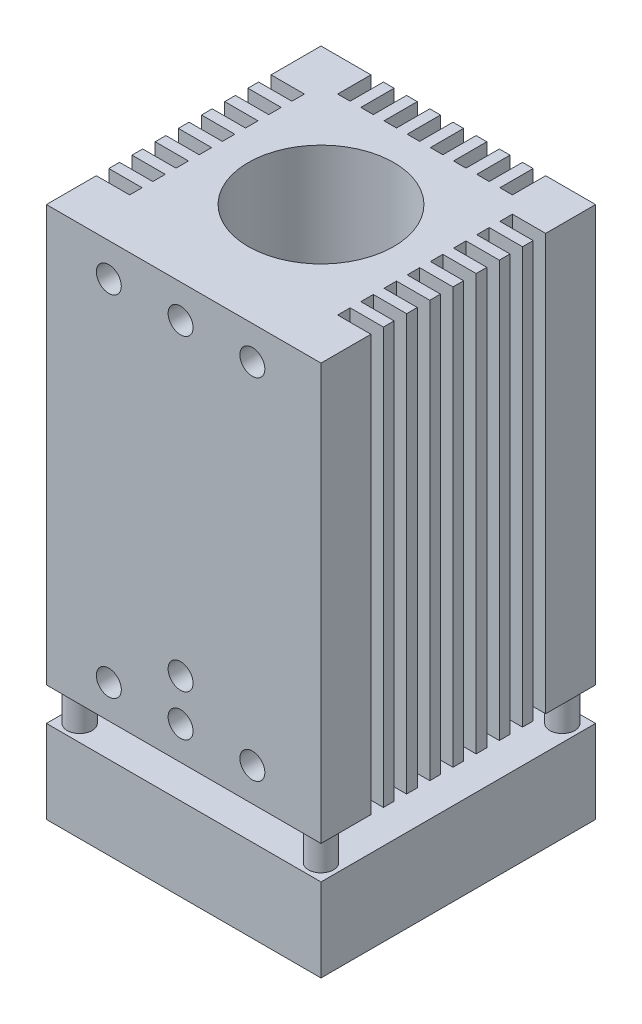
ISO-10303-21;
HEADER;
FILE_DESCRIPTION(('STEP AP214'),'2;1');
FILE_NAME('part.step','',(''),(''),'','','');
FILE_SCHEMA(('AUTOMOTIVE_DESIGN { 1 0 10303 214 1 1 1 1 }'));
ENDSEC;
DATA;
#1=APPLICATION_CONTEXT('core data for automotive mechanical design processes');
#2=APPLICATION_PROTOCOL_DEFINITION('international standard','automotive_design',2000,#1);
#3=PRODUCT_CONTEXT('',#1,'mechanical');
#4=PRODUCT('Part','Part','',(#3));
#5=PRODUCT_RELATED_PRODUCT_CATEGORY('part','',(#4));
#6=PRODUCT_DEFINITION_FORMATION('','',#4);
#7=PRODUCT_DEFINITION_CONTEXT('part definition',#1,'design');
#8=PRODUCT_DEFINITION('design','',#6,#7);
#9=PRODUCT_DEFINITION_SHAPE('','',#8);
#10=(LENGTH_UNIT() NAMED_UNIT(*) SI_UNIT(.MILLI.,.METRE.));
#11=(NAMED_UNIT(*) PLANE_ANGLE_UNIT() SI_UNIT($,.RADIAN.));
#12=(NAMED_UNIT(*) SI_UNIT($,.STERADIAN.) SOLID_ANGLE_UNIT());
#13=UNCERTAINTY_MEASURE_WITH_UNIT(LENGTH_MEASURE(1.E-05),#10,'distance_accuracy_value','');
#14=(GEOMETRIC_REPRESENTATION_CONTEXT(3) GLOBAL_UNCERTAINTY_ASSIGNED_CONTEXT((#13)) GLOBAL_UNIT_ASSIGNED_CONTEXT((#10,
#11,#12)) REPRESENTATION_CONTEXT('',''));
#15=CARTESIAN_POINT('',(0.,0.,0.));
#16=DIRECTION('',(0.,0.,1.));
#17=DIRECTION('',(1.,0.,0.));
#18=AXIS2_PLACEMENT_3D('',#15,#16,#17);
#19=CARTESIAN_POINT('',(33.,0.,33.));
#20=DIRECTION('',(-1.,0.,0.));
#21=DIRECTION('',(0.,0.,1.));
#22=AXIS2_PLACEMENT_3D('',#19,#20,#21);
#23=PLANE('',#22);
#24=DIRECTION('',(0.,0.,-1.));
#25=VECTOR('',#24,1.);
#26=CARTESIAN_POINT('',(33.,0.,33.));
#27=LINE('',#26,#25);
#28=CARTESIAN_POINT('',(33.,0.,33.));
#29=VERTEX_POINT('',#28);
#30=CARTESIAN_POINT('',(33.,0.,27.));
#31=VERTEX_POINT('',#30);
#32=EDGE_CURVE('E1443',#29,#31,#27,.T.);
#33=ORIENTED_EDGE('',*,*,#32,.T.);
#34=DIRECTION('',(0.,1.,0.));
#35=VECTOR('',#34,1.);
#36=CARTESIAN_POINT('',(33.,0.,27.));
#37=LINE('',#36,#35);
#38=CARTESIAN_POINT('',(33.,50.,27.));
#39=VERTEX_POINT('',#38);
#40=EDGE_CURVE('E782',#31,#39,#37,.T.);
#41=ORIENTED_EDGE('',*,*,#40,.T.);
#42=DIRECTION('',(0.,0.,-1.));
#43=VECTOR('',#42,1.);
#44=CARTESIAN_POINT('',(33.,50.,33.));
#45=LINE('',#44,#43);
#46=CARTESIAN_POINT('',(33.,50.,33.));
#47=VERTEX_POINT('',#46);
#48=EDGE_CURVE('E1438',#47,#39,#45,.T.);
#49=ORIENTED_EDGE('',*,*,#48,.F.);
#50=DIRECTION('',(0.,1.,0.));
#51=VECTOR('',#50,1.);
#52=CARTESIAN_POINT('',(33.,0.,33.));
#53=LINE('',#52,#51);
#54=EDGE_CURVE('E1414',#29,#47,#53,.T.);
#55=ORIENTED_EDGE('',*,*,#54,.F.);
#56=EDGE_LOOP('',(#33,#41,#49,#55));
#57=FACE_BOUND('',#56,.T.);
#58=ADVANCED_FACE('F34',(#57),#23,.F.);
#59=CARTESIAN_POINT('',(0.,0.,33.));
#60=DIRECTION('',(1.,0.,0.));
#61=DIRECTION('',(0.,0.,-1.));
#62=AXIS2_PLACEMENT_3D('',#59,#60,#61);
#63=PLANE('',#62);
#64=DIRECTION('',(0.,0.,-1.));
#65=VECTOR('',#64,1.);
#66=CARTESIAN_POINT('',(0.,0.,33.));
#67=LINE('',#66,#65);
#68=CARTESIAN_POINT('',(0.,0.,25.5));
#69=VERTEX_POINT('',#68);
#70=CARTESIAN_POINT('',(0.,0.,24.2142857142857));
#71=VERTEX_POINT('',#70);
#72=EDGE_CURVE('E1452',#69,#71,#67,.T.);
#73=ORIENTED_EDGE('',*,*,#72,.F.);
#74=DIRECTION('',(0.,1.,0.));
#75=VECTOR('',#74,1.);
#76=CARTESIAN_POINT('',(0.,0.,25.5));
#77=LINE('',#76,#75);
#78=CARTESIAN_POINT('',(0.,50.,25.5));
#79=VERTEX_POINT('',#78);
#80=EDGE_CURVE('E806',#69,#79,#77,.T.);
#81=ORIENTED_EDGE('',*,*,#80,.T.);
#82=DIRECTION('',(0.,0.,-1.));
#83=VECTOR('',#82,1.);
#84=CARTESIAN_POINT('',(0.,50.,33.));
#85=LINE('',#84,#83);
#86=CARTESIAN_POINT('',(0.,50.,24.2142857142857));
#87=VERTEX_POINT('',#86);
#88=EDGE_CURVE('E1437',#79,#87,#85,.T.);
#89=ORIENTED_EDGE('',*,*,#88,.T.);
#90=DIRECTION('',(0.,1.,0.));
#91=VECTOR('',#90,1.);
#92=CARTESIAN_POINT('',(0.,0.,24.2142857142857));
#93=LINE('',#92,#91);
#94=EDGE_CURVE('E852',#71,#87,#93,.T.);
#95=ORIENTED_EDGE('',*,*,#94,.F.);
#96=EDGE_LOOP('',(#73,#81,#89,#95));
#97=FACE_BOUND('',#96,.T.);
#98=ADVANCED_FACE('F1495',(#97),#63,.F.);
#99=CARTESIAN_POINT('',(33.,50.,25.5));
#100=VERTEX_POINT('',#99);
#101=CARTESIAN_POINT('',(33.,50.,24.2142857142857));
#102=VERTEX_POINT('',#101);
#103=EDGE_CURVE('E1442',#100,#102,#45,.T.);
#104=ORIENTED_EDGE('',*,*,#103,.F.);
#105=DIRECTION('',(0.,1.,0.));
#106=VECTOR('',#105,1.);
#107=CARTESIAN_POINT('',(33.,0.,25.5));
#108=LINE('',#107,#106);
#109=CARTESIAN_POINT('',(33.,0.,25.5));
#110=VERTEX_POINT('',#109);
#111=EDGE_CURVE('E49',#110,#100,#108,.T.);
#112=ORIENTED_EDGE('',*,*,#111,.F.);
#113=CARTESIAN_POINT('',(33.,0.,24.2142857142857));
#114=VERTEX_POINT('',#113);
#115=EDGE_CURVE('E1447',#110,#114,#27,.T.);
#116=ORIENTED_EDGE('',*,*,#115,.T.);
#117=DIRECTION('',(0.,1.,0.));
#118=VECTOR('',#117,1.);
#119=CARTESIAN_POINT('',(33.,0.,24.2142857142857));
#120=LINE('',#119,#118);
#121=EDGE_CURVE('E833',#114,#102,#120,.T.);
#122=ORIENTED_EDGE('',*,*,#121,.T.);
#123=EDGE_LOOP('',(#104,#112,#116,#122));
#124=FACE_BOUND('',#123,.T.);
#125=ADVANCED_FACE('F1505',(#124),#23,.F.);
#126=CARTESIAN_POINT('',(0.,0.,22.7142857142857));
#127=VERTEX_POINT('',#126);
#128=CARTESIAN_POINT('',(0.,0.,21.4285714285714));
#129=VERTEX_POINT('',#128);
#130=EDGE_CURVE('E1691',#127,#129,#67,.T.);
#131=ORIENTED_EDGE('',*,*,#130,.F.);
#132=DIRECTION('',(0.,1.,0.));
#133=VECTOR('',#132,1.);
#134=CARTESIAN_POINT('',(0.,0.,22.7142857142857));
#135=LINE('',#134,#133);
#136=CARTESIAN_POINT('',(0.,50.,22.7142857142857));
#137=VERTEX_POINT('',#136);
#138=EDGE_CURVE('E859',#127,#137,#135,.T.);
#139=ORIENTED_EDGE('',*,*,#138,.T.);
#140=CARTESIAN_POINT('',(0.,50.,21.4285714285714));
#141=VERTEX_POINT('',#140);
#142=EDGE_CURVE('E1671',#137,#141,#85,.T.);
#143=ORIENTED_EDGE('',*,*,#142,.T.);
#144=DIRECTION('',(0.,1.,0.));
#145=VECTOR('',#144,1.);
#146=CARTESIAN_POINT('',(0.,0.,21.4285714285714));
#147=LINE('',#146,#145);
#148=EDGE_CURVE('E906',#129,#141,#147,.T.);
#149=ORIENTED_EDGE('',*,*,#148,.F.);
#150=EDGE_LOOP('',(#131,#139,#143,#149));
#151=FACE_BOUND('',#150,.T.);
#152=ADVANCED_FACE('F1507',(#151),#63,.F.);
#153=CARTESIAN_POINT('',(33.,50.,22.7142857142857));
#154=VERTEX_POINT('',#153);
#155=CARTESIAN_POINT('',(33.,50.,21.4285714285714));
#156=VERTEX_POINT('',#155);
#157=EDGE_CURVE('E1579',#154,#156,#45,.T.);
#158=ORIENTED_EDGE('',*,*,#157,.F.);
#159=DIRECTION('',(0.,1.,0.));
#160=VECTOR('',#159,1.);
#161=CARTESIAN_POINT('',(33.,0.,22.7142857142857));
#162=LINE('',#161,#160);
#163=CARTESIAN_POINT('',(33.,0.,22.7142857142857));
#164=VERTEX_POINT('',#163);
#165=EDGE_CURVE('E825',#164,#154,#162,.T.);
#166=ORIENTED_EDGE('',*,*,#165,.F.);
#167=CARTESIAN_POINT('',(33.,0.,21.4285714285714));
#168=VERTEX_POINT('',#167);
#169=EDGE_CURVE('E2920',#164,#168,#27,.T.);
#170=ORIENTED_EDGE('',*,*,#169,.T.);
#171=DIRECTION('',(0.,1.,0.));
#172=VECTOR('',#171,1.);
#173=CARTESIAN_POINT('',(33.,0.,21.4285714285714));
#174=LINE('',#173,#172);
#175=EDGE_CURVE('E887',#168,#156,#174,.T.);
#176=ORIENTED_EDGE('',*,*,#175,.T.);
#177=EDGE_LOOP('',(#158,#166,#170,#176));
#178=FACE_BOUND('',#177,.T.);
#179=ADVANCED_FACE('F1520',(#178),#23,.F.);
#180=CARTESIAN_POINT('',(0.,0.,19.9285714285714));
#181=VERTEX_POINT('',#180);
#182=CARTESIAN_POINT('',(0.,0.,18.6428571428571));
#183=VERTEX_POINT('',#182);
#184=EDGE_CURVE('E1692',#181,#183,#67,.T.);
#185=ORIENTED_EDGE('',*,*,#184,.F.);
#186=DIRECTION('',(0.,1.,0.));
#187=VECTOR('',#186,1.);
#188=CARTESIAN_POINT('',(0.,0.,19.9285714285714));
#189=LINE('',#188,#187);
#190=CARTESIAN_POINT('',(0.,50.,19.9285714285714));
#191=VERTEX_POINT('',#190);
#192=EDGE_CURVE('E913',#181,#191,#189,.T.);
#193=ORIENTED_EDGE('',*,*,#192,.T.);
#194=CARTESIAN_POINT('',(0.,50.,18.6428571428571));
#195=VERTEX_POINT('',#194);
#196=EDGE_CURVE('E1668',#191,#195,#85,.T.);
#197=ORIENTED_EDGE('',*,*,#196,.T.);
#198=DIRECTION('',(0.,1.,0.));
#199=VECTOR('',#198,1.);
#200=CARTESIAN_POINT('',(0.,0.,18.6428571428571));
#201=LINE('',#200,#199);
#202=EDGE_CURVE('E960',#183,#195,#201,.T.);
#203=ORIENTED_EDGE('',*,*,#202,.F.);
#204=EDGE_LOOP('',(#185,#193,#197,#203));
#205=FACE_BOUND('',#204,.T.);
#206=ADVANCED_FACE('F1562',(#205),#63,.F.);
#207=CARTESIAN_POINT('',(33.,50.,19.9285714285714));
#208=VERTEX_POINT('',#207);
#209=CARTESIAN_POINT('',(33.,50.,18.6428571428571));
#210=VERTEX_POINT('',#209);
#211=EDGE_CURVE('E1584',#208,#210,#45,.T.);
#212=ORIENTED_EDGE('',*,*,#211,.F.);
#213=DIRECTION('',(0.,1.,0.));
#214=VECTOR('',#213,1.);
#215=CARTESIAN_POINT('',(33.,0.,19.9285714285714));
#216=LINE('',#215,#214);
#217=CARTESIAN_POINT('',(33.,0.,19.9285714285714));
#218=VERTEX_POINT('',#217);
#219=EDGE_CURVE('E879',#218,#208,#216,.T.);
#220=ORIENTED_EDGE('',*,*,#219,.F.);
#221=CARTESIAN_POINT('',(33.,0.,18.6428571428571));
#222=VERTEX_POINT('',#221);
#223=EDGE_CURVE('E2922',#218,#222,#27,.T.);
#224=ORIENTED_EDGE('',*,*,#223,.T.);
#225=DIRECTION('',(0.,1.,0.));
#226=VECTOR('',#225,1.);
#227=CARTESIAN_POINT('',(33.,0.,18.6428571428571));
#228=LINE('',#227,#226);
#229=EDGE_CURVE('E941',#222,#210,#228,.T.);
#230=ORIENTED_EDGE('',*,*,#229,.T.);
#231=EDGE_LOOP('',(#212,#220,#224,#230));
#232=FACE_BOUND('',#231,.T.);
#233=ADVANCED_FACE('F1557',(#232),#23,.F.);
#234=CARTESIAN_POINT('',(0.,0.,17.1428571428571));
#235=VERTEX_POINT('',#234);
#236=CARTESIAN_POINT('',(0.,0.,15.8571428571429));
#237=VERTEX_POINT('',#236);
#238=EDGE_CURVE('E1695',#235,#237,#67,.T.);
#239=ORIENTED_EDGE('',*,*,#238,.F.);
#240=DIRECTION('',(0.,1.,0.));
#241=VECTOR('',#240,1.);
#242=CARTESIAN_POINT('',(0.,0.,17.1428571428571));
#243=LINE('',#242,#241);
#244=CARTESIAN_POINT('',(0.,50.,17.1428571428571));
#245=VERTEX_POINT('',#244);
#246=EDGE_CURVE('E967',#235,#245,#243,.T.);
#247=ORIENTED_EDGE('',*,*,#246,.T.);
#248=CARTESIAN_POINT('',(0.,50.,15.8571428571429));
#249=VERTEX_POINT('',#248);
#250=EDGE_CURVE('E1665',#245,#249,#85,.T.);
#251=ORIENTED_EDGE('',*,*,#250,.T.);
#252=DIRECTION('',(0.,1.,0.));
#253=VECTOR('',#252,1.);
#254=CARTESIAN_POINT('',(0.,0.,15.8571428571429));
#255=LINE('',#254,#253);
#256=EDGE_CURVE('E1014',#237,#249,#255,.T.);
#257=ORIENTED_EDGE('',*,*,#256,.F.);
#258=EDGE_LOOP('',(#239,#247,#251,#257));
#259=FACE_BOUND('',#258,.T.);
#260=ADVANCED_FACE('F1553',(#259),#63,.F.);
#261=CARTESIAN_POINT('',(33.,50.,17.1428571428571));
#262=VERTEX_POINT('',#261);
#263=CARTESIAN_POINT('',(33.,50.,15.8571428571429));
#264=VERTEX_POINT('',#263);
#265=EDGE_CURVE('E1585',#262,#264,#45,.T.);
#266=ORIENTED_EDGE('',*,*,#265,.F.);
#267=DIRECTION('',(0.,1.,0.));
#268=VECTOR('',#267,1.);
#269=CARTESIAN_POINT('',(33.,0.,17.1428571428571));
#270=LINE('',#269,#268);
#271=CARTESIAN_POINT('',(33.,0.,17.1428571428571));
#272=VERTEX_POINT('',#271);
#273=EDGE_CURVE('E933',#272,#262,#270,.T.);
#274=ORIENTED_EDGE('',*,*,#273,.F.);
#275=CARTESIAN_POINT('',(33.,0.,15.8571428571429));
#276=VERTEX_POINT('',#275);
#277=EDGE_CURVE('E2923',#272,#276,#27,.T.);
#278=ORIENTED_EDGE('',*,*,#277,.T.);
#279=DIRECTION('',(0.,1.,0.));
#280=VECTOR('',#279,1.);
#281=CARTESIAN_POINT('',(33.,0.,15.8571428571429));
#282=LINE('',#281,#280);
#283=EDGE_CURVE('E995',#276,#264,#282,.T.);
#284=ORIENTED_EDGE('',*,*,#283,.T.);
#285=EDGE_LOOP('',(#266,#274,#278,#284));
#286=FACE_BOUND('',#285,.T.);
#287=ADVANCED_FACE('F1548',(#286),#23,.F.);
#288=CARTESIAN_POINT('',(0.,0.,14.3571428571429));
#289=VERTEX_POINT('',#288);
#290=CARTESIAN_POINT('',(0.,0.,13.0714285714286));
#291=VERTEX_POINT('',#290);
#292=EDGE_CURVE('E1698',#289,#291,#67,.T.);
#293=ORIENTED_EDGE('',*,*,#292,.F.);
#294=DIRECTION('',(0.,1.,0.));
#295=VECTOR('',#294,1.);
#296=CARTESIAN_POINT('',(0.,0.,14.3571428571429));
#297=LINE('',#296,#295);
#298=CARTESIAN_POINT('',(0.,50.,14.3571428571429));
#299=VERTEX_POINT('',#298);
#300=EDGE_CURVE('E1021',#289,#299,#297,.T.);
#301=ORIENTED_EDGE('',*,*,#300,.T.);
#302=CARTESIAN_POINT('',(0.,50.,13.0714285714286));
#303=VERTEX_POINT('',#302);
#304=EDGE_CURVE('E1662',#299,#303,#85,.T.);
#305=ORIENTED_EDGE('',*,*,#304,.T.);
#306=DIRECTION('',(0.,1.,0.));
#307=VECTOR('',#306,1.);
#308=CARTESIAN_POINT('',(0.,0.,13.0714285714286));
#309=LINE('',#308,#307);
#310=EDGE_CURVE('E1068',#291,#303,#309,.T.);
#311=ORIENTED_EDGE('',*,*,#310,.F.);
#312=EDGE_LOOP('',(#293,#301,#305,#311));
#313=FACE_BOUND('',#312,.T.);
#314=ADVANCED_FACE('F1544',(#313),#63,.F.);
#315=CARTESIAN_POINT('',(33.,50.,14.3571428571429));
#316=VERTEX_POINT('',#315);
#317=CARTESIAN_POINT('',(33.,50.,13.0714285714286));
#318=VERTEX_POINT('',#317);
#319=EDGE_CURVE('E1588',#316,#318,#45,.T.);
#320=ORIENTED_EDGE('',*,*,#319,.F.);
#321=DIRECTION('',(0.,1.,0.));
#322=VECTOR('',#321,1.);
#323=CARTESIAN_POINT('',(33.,0.,14.3571428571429));
#324=LINE('',#323,#322);
#325=CARTESIAN_POINT('',(33.,0.,14.3571428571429));
#326=VERTEX_POINT('',#325);
#327=EDGE_CURVE('E987',#326,#316,#324,.T.);
#328=ORIENTED_EDGE('',*,*,#327,.F.);
#329=CARTESIAN_POINT('',(33.,0.,13.0714285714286));
#330=VERTEX_POINT('',#329);
#331=EDGE_CURVE('E2927',#326,#330,#27,.T.);
#332=ORIENTED_EDGE('',*,*,#331,.T.);
#333=DIRECTION('',(0.,1.,0.));
#334=VECTOR('',#333,1.);
#335=CARTESIAN_POINT('',(33.,0.,13.0714285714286));
#336=LINE('',#335,#334);
#337=EDGE_CURVE('E1049',#330,#318,#336,.T.);
#338=ORIENTED_EDGE('',*,*,#337,.T.);
#339=EDGE_LOOP('',(#320,#328,#332,#338));
#340=FACE_BOUND('',#339,.T.);
#341=ADVANCED_FACE('F1539',(#340),#23,.F.);
#342=CARTESIAN_POINT('',(0.,0.,11.5714285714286));
#343=VERTEX_POINT('',#342);
#344=CARTESIAN_POINT('',(0.,0.,10.2857142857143));
#345=VERTEX_POINT('',#344);
#346=EDGE_CURVE('E1701',#343,#345,#67,.T.);
#347=ORIENTED_EDGE('',*,*,#346,.F.);
#348=DIRECTION('',(0.,1.,0.));
#349=VECTOR('',#348,1.);
#350=CARTESIAN_POINT('',(0.,0.,11.5714285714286));
#351=LINE('',#350,#349);
#352=CARTESIAN_POINT('',(0.,50.,11.5714285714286));
#353=VERTEX_POINT('',#352);
#354=EDGE_CURVE('E1075',#343,#353,#351,.T.);
#355=ORIENTED_EDGE('',*,*,#354,.T.);
#356=CARTESIAN_POINT('',(0.,50.,10.2857142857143));
#357=VERTEX_POINT('',#356);
#358=EDGE_CURVE('E1659',#353,#357,#85,.T.);
#359=ORIENTED_EDGE('',*,*,#358,.T.);
#360=DIRECTION('',(0.,1.,0.));
#361=VECTOR('',#360,1.);
#362=CARTESIAN_POINT('',(0.,0.,10.2857142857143));
#363=LINE('',#362,#361);
#364=EDGE_CURVE('E1122',#345,#357,#363,.T.);
#365=ORIENTED_EDGE('',*,*,#364,.F.);
#366=EDGE_LOOP('',(#347,#355,#359,#365));
#367=FACE_BOUND('',#366,.T.);
#368=ADVANCED_FACE('F1535',(#367),#63,.F.);
#369=CARTESIAN_POINT('',(33.,50.,11.5714285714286));
#370=VERTEX_POINT('',#369);
#371=CARTESIAN_POINT('',(33.,50.,10.2857142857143));
#372=VERTEX_POINT('',#371);
#373=EDGE_CURVE('E1591',#370,#372,#45,.T.);
#374=ORIENTED_EDGE('',*,*,#373,.F.);
#375=DIRECTION('',(0.,1.,0.));
#376=VECTOR('',#375,1.);
#377=CARTESIAN_POINT('',(33.,0.,11.5714285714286));
#378=LINE('',#377,#376);
#379=CARTESIAN_POINT('',(33.,0.,11.5714285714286));
#380=VERTEX_POINT('',#379);
#381=EDGE_CURVE('E1041',#380,#370,#378,.T.);
#382=ORIENTED_EDGE('',*,*,#381,.F.);
#383=CARTESIAN_POINT('',(33.,0.,10.2857142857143));
#384=VERTEX_POINT('',#383);
#385=EDGE_CURVE('E2931',#380,#384,#27,.T.);
#386=ORIENTED_EDGE('',*,*,#385,.T.);
#387=DIRECTION('',(0.,1.,0.));
#388=VECTOR('',#387,1.);
#389=CARTESIAN_POINT('',(33.,0.,10.2857142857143));
#390=LINE('',#389,#388);
#391=EDGE_CURVE('E1103',#384,#372,#390,.T.);
#392=ORIENTED_EDGE('',*,*,#391,.T.);
#393=EDGE_LOOP('',(#374,#382,#386,#392));
#394=FACE_BOUND('',#393,.T.);
#395=ADVANCED_FACE('F1530',(#394),#23,.F.);
#396=CARTESIAN_POINT('',(0.,0.,8.78571428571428));
#397=VERTEX_POINT('',#396);
#398=CARTESIAN_POINT('',(0.,0.,7.5));
#399=VERTEX_POINT('',#398);
#400=EDGE_CURVE('E1704',#397,#399,#67,.T.);
#401=ORIENTED_EDGE('',*,*,#400,.F.);
#402=DIRECTION('',(0.,1.,0.));
#403=VECTOR('',#402,1.);
#404=CARTESIAN_POINT('',(0.,0.,8.78571428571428));
#405=LINE('',#404,#403);
#406=CARTESIAN_POINT('',(0.,50.,8.78571428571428));
#407=VERTEX_POINT('',#406);
#408=EDGE_CURVE('E1129',#397,#407,#405,.T.);
#409=ORIENTED_EDGE('',*,*,#408,.T.);
#410=CARTESIAN_POINT('',(0.,50.,7.5));
#411=VERTEX_POINT('',#410);
#412=EDGE_CURVE('E1658',#407,#411,#85,.T.);
#413=ORIENTED_EDGE('',*,*,#412,.T.);
#414=DIRECTION('',(0.,1.,0.));
#415=VECTOR('',#414,1.);
#416=CARTESIAN_POINT('',(0.,0.,7.5));
#417=LINE('',#416,#415);
#418=EDGE_CURVE('E1176',#399,#411,#417,.T.);
#419=ORIENTED_EDGE('',*,*,#418,.F.);
#420=EDGE_LOOP('',(#401,#409,#413,#419));
#421=FACE_BOUND('',#420,.T.);
#422=ADVANCED_FACE('F1512',(#421),#63,.F.);
#423=CARTESIAN_POINT('',(33.,50.,8.78571428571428));
#424=VERTEX_POINT('',#423);
#425=CARTESIAN_POINT('',(33.,50.,7.5));
#426=VERTEX_POINT('',#425);
#427=EDGE_CURVE('E1594',#424,#426,#45,.T.);
#428=ORIENTED_EDGE('',*,*,#427,.F.);
#429=DIRECTION('',(0.,1.,0.));
#430=VECTOR('',#429,1.);
#431=CARTESIAN_POINT('',(33.,0.,8.78571428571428));
#432=LINE('',#431,#430);
#433=CARTESIAN_POINT('',(33.,0.,8.78571428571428));
#434=VERTEX_POINT('',#433);
#435=EDGE_CURVE('E1095',#434,#424,#432,.T.);
#436=ORIENTED_EDGE('',*,*,#435,.F.);
#437=CARTESIAN_POINT('',(33.,0.,7.5));
#438=VERTEX_POINT('',#437);
#439=EDGE_CURVE('E2935',#434,#438,#27,.T.);
#440=ORIENTED_EDGE('',*,*,#439,.T.);
#441=DIRECTION('',(0.,1.,0.));
#442=VECTOR('',#441,1.);
#443=CARTESIAN_POINT('',(33.,0.,7.5));
#444=LINE('',#443,#442);
#445=EDGE_CURVE('E1157',#438,#426,#444,.T.);
#446=ORIENTED_EDGE('',*,*,#445,.T.);
#447=EDGE_LOOP('',(#428,#436,#440,#446));
#448=FACE_BOUND('',#447,.T.);
#449=ADVANCED_FACE('F1510',(#448),#23,.F.);
#450=CARTESIAN_POINT('',(0.,0.,6.));
#451=VERTEX_POINT('',#450);
#452=CARTESIAN_POINT('',(0.,0.,0.));
#453=VERTEX_POINT('',#452);
#454=EDGE_CURVE('E1446',#451,#453,#67,.T.);
#455=ORIENTED_EDGE('',*,*,#454,.F.);
#456=DIRECTION('',(0.,1.,0.));
#457=VECTOR('',#456,1.);
#458=CARTESIAN_POINT('',(0.,0.,6.));
#459=LINE('',#458,#457);
#460=CARTESIAN_POINT('',(0.,50.,6.));
#461=VERTEX_POINT('',#460);
#462=EDGE_CURVE('E1183',#451,#461,#459,.T.);
#463=ORIENTED_EDGE('',*,*,#462,.T.);
#464=CARTESIAN_POINT('',(0.,50.,0.));
#465=VERTEX_POINT('',#464);
#466=EDGE_CURVE('E1418',#461,#465,#85,.T.);
#467=ORIENTED_EDGE('',*,*,#466,.T.);
#468=DIRECTION('',(0.,-1.,0.));
#469=VECTOR('',#468,1.);
#470=CARTESIAN_POINT('',(0.,0.,0.));
#471=LINE('',#470,#469);
#472=EDGE_CURVE('E1401',#465,#453,#471,.T.);
#473=ORIENTED_EDGE('',*,*,#472,.T.);
#474=EDGE_LOOP('',(#455,#463,#467,#473));
#475=FACE_BOUND('',#474,.T.);
#476=ADVANCED_FACE('F1496',(#475),#63,.F.);
#477=CARTESIAN_POINT('',(0.,0.,0.));
#478=DIRECTION('',(0.,0.,-1.));
#479=DIRECTION('',(-1.,0.,0.));
#480=AXIS2_PLACEMENT_3D('',#477,#478,#479);
#481=PLANE('',#480);
#482=DIRECTION('',(0.,1.,0.));
#483=VECTOR('',#482,1.);
#484=CARTESIAN_POINT('',(25.5,0.,0.));
#485=LINE('',#484,#483);
#486=CARTESIAN_POINT('',(25.5,0.,0.));
#487=VERTEX_POINT('',#486);
#488=CARTESIAN_POINT('',(25.5,50.,0.));
#489=VERTEX_POINT('',#488);
#490=EDGE_CURVE('E1210',#487,#489,#485,.T.);
#491=ORIENTED_EDGE('',*,*,#490,.F.);
#492=DIRECTION('',(1.,0.,0.));
#493=VECTOR('',#492,1.);
#494=CARTESIAN_POINT('',(0.,0.,0.));
#495=LINE('',#494,#493);
#496=CARTESIAN_POINT('',(24.2142857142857,0.,0.));
#497=VERTEX_POINT('',#496);
#498=EDGE_CURVE('E2011',#497,#487,#495,.T.);
#499=ORIENTED_EDGE('',*,*,#498,.F.);
#500=DIRECTION('',(0.,1.,0.));
#501=VECTOR('',#500,1.);
#502=CARTESIAN_POINT('',(24.2142857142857,0.,0.));
#503=LINE('',#502,#501);
#504=CARTESIAN_POINT('',(24.2142857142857,50.,0.));
#505=VERTEX_POINT('',#504);
#506=EDGE_CURVE('E1240',#497,#505,#503,.T.);
#507=ORIENTED_EDGE('',*,*,#506,.T.);
#508=DIRECTION('',(-1.,0.,0.));
#509=VECTOR('',#508,1.);
#510=CARTESIAN_POINT('',(0.,50.,0.));
#511=LINE('',#510,#509);
#512=EDGE_CURVE('E1432',#489,#505,#511,.T.);
#513=ORIENTED_EDGE('',*,*,#512,.F.);
#514=EDGE_LOOP('',(#491,#499,#507,#513));
#515=FACE_BOUND('',#514,.T.);
#516=ADVANCED_FACE('F1509',(#515),#481,.T.);
#517=DIRECTION('',(0.,1.,0.));
#518=VECTOR('',#517,1.);
#519=CARTESIAN_POINT('',(22.7142857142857,0.,0.));
#520=LINE('',#519,#518);
#521=CARTESIAN_POINT('',(22.7142857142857,0.,0.));
#522=VERTEX_POINT('',#521);
#523=CARTESIAN_POINT('',(22.7142857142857,50.,0.));
#524=VERTEX_POINT('',#523);
#525=EDGE_CURVE('E1237',#522,#524,#520,.T.);
#526=ORIENTED_EDGE('',*,*,#525,.F.);
#527=CARTESIAN_POINT('',(21.4285714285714,0.,0.));
#528=VERTEX_POINT('',#527);
#529=EDGE_CURVE('E2008',#528,#522,#495,.T.);
#530=ORIENTED_EDGE('',*,*,#529,.F.);
#531=DIRECTION('',(0.,1.,0.));
#532=VECTOR('',#531,1.);
#533=CARTESIAN_POINT('',(21.4285714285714,0.,0.));
#534=LINE('',#533,#532);
#535=CARTESIAN_POINT('',(21.4285714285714,50.,0.));
#536=VERTEX_POINT('',#535);
#537=EDGE_CURVE('E1267',#528,#536,#534,.T.);
#538=ORIENTED_EDGE('',*,*,#537,.T.);
#539=EDGE_CURVE('E1624',#524,#536,#511,.T.);
#540=ORIENTED_EDGE('',*,*,#539,.F.);
#541=EDGE_LOOP('',(#526,#530,#538,#540));
#542=FACE_BOUND('',#541,.T.);
#543=ADVANCED_FACE('F1994',(#542),#481,.T.);
#544=DIRECTION('',(0.,1.,0.));
#545=VECTOR('',#544,1.);
#546=CARTESIAN_POINT('',(19.9285714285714,0.,0.));
#547=LINE('',#546,#545);
#548=CARTESIAN_POINT('',(19.9285714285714,0.,0.));
#549=VERTEX_POINT('',#548);
#550=CARTESIAN_POINT('',(19.9285714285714,50.,0.));
#551=VERTEX_POINT('',#550);
#552=EDGE_CURVE('E1264',#549,#551,#547,.T.);
#553=ORIENTED_EDGE('',*,*,#552,.F.);
#554=CARTESIAN_POINT('',(18.6428571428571,0.,0.));
#555=VERTEX_POINT('',#554);
#556=EDGE_CURVE('E2010',#555,#549,#495,.T.);
#557=ORIENTED_EDGE('',*,*,#556,.F.);
#558=DIRECTION('',(0.,1.,0.));
#559=VECTOR('',#558,1.);
#560=CARTESIAN_POINT('',(18.6428571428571,0.,0.));
#561=LINE('',#560,#559);
#562=CARTESIAN_POINT('',(18.6428571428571,50.,0.));
#563=VERTEX_POINT('',#562);
#564=EDGE_CURVE('E1294',#555,#563,#561,.T.);
#565=ORIENTED_EDGE('',*,*,#564,.T.);
#566=EDGE_CURVE('E1625',#551,#563,#511,.T.);
#567=ORIENTED_EDGE('',*,*,#566,.F.);
#568=EDGE_LOOP('',(#553,#557,#565,#567));
#569=FACE_BOUND('',#568,.T.);
#570=ADVANCED_FACE('F1998',(#569),#481,.T.);
#571=DIRECTION('',(0.,1.,0.));
#572=VECTOR('',#571,1.);
#573=CARTESIAN_POINT('',(17.1428571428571,0.,0.));
#574=LINE('',#573,#572);
#575=CARTESIAN_POINT('',(17.1428571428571,0.,0.));
#576=VERTEX_POINT('',#575);
#577=CARTESIAN_POINT('',(17.1428571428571,50.,0.));
#578=VERTEX_POINT('',#577);
#579=EDGE_CURVE('E1291',#576,#578,#574,.T.);
#580=ORIENTED_EDGE('',*,*,#579,.F.);
#581=CARTESIAN_POINT('',(15.8571428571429,0.,0.));
#582=VERTEX_POINT('',#581);
#583=EDGE_CURVE('E2013',#582,#576,#495,.T.);
#584=ORIENTED_EDGE('',*,*,#583,.F.);
#585=DIRECTION('',(0.,1.,0.));
#586=VECTOR('',#585,1.);
#587=CARTESIAN_POINT('',(15.8571428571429,0.,0.));
#588=LINE('',#587,#586);
#589=CARTESIAN_POINT('',(15.8571428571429,50.,0.));
#590=VERTEX_POINT('',#589);
#591=EDGE_CURVE('E1321',#582,#590,#588,.T.);
#592=ORIENTED_EDGE('',*,*,#591,.T.);
#593=EDGE_CURVE('E1629',#578,#590,#511,.T.);
#594=ORIENTED_EDGE('',*,*,#593,.F.);
#595=EDGE_LOOP('',(#580,#584,#592,#594));
#596=FACE_BOUND('',#595,.T.);
#597=ADVANCED_FACE('F2003',(#596),#481,.T.);
#598=DIRECTION('',(0.,1.,0.));
#599=VECTOR('',#598,1.);
#600=CARTESIAN_POINT('',(14.3571428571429,0.,0.));
#601=LINE('',#600,#599);
#602=CARTESIAN_POINT('',(14.3571428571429,0.,0.));
#603=VERTEX_POINT('',#602);
#604=CARTESIAN_POINT('',(14.3571428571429,50.,0.));
#605=VERTEX_POINT('',#604);
#606=EDGE_CURVE('E1318',#603,#605,#601,.T.);
#607=ORIENTED_EDGE('',*,*,#606,.F.);
#608=CARTESIAN_POINT('',(13.0714285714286,0.,0.));
#609=VERTEX_POINT('',#608);
#610=EDGE_CURVE('E2019',#609,#603,#495,.T.);
#611=ORIENTED_EDGE('',*,*,#610,.F.);
#612=DIRECTION('',(0.,1.,0.));
#613=VECTOR('',#612,1.);
#614=CARTESIAN_POINT('',(13.0714285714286,0.,0.));
#615=LINE('',#614,#613);
#616=CARTESIAN_POINT('',(13.0714285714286,50.,0.));
#617=VERTEX_POINT('',#616);
#618=EDGE_CURVE('E1348',#609,#617,#615,.T.);
#619=ORIENTED_EDGE('',*,*,#618,.T.);
#620=EDGE_CURVE('E1633',#605,#617,#511,.T.);
#621=ORIENTED_EDGE('',*,*,#620,.F.);
#622=EDGE_LOOP('',(#607,#611,#619,#621));
#623=FACE_BOUND('',#622,.T.);
#624=ADVANCED_FACE('F2042',(#623),#481,.T.);
#625=DIRECTION('',(0.,1.,0.));
#626=VECTOR('',#625,1.);
#627=CARTESIAN_POINT('',(11.5714285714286,0.,0.));
#628=LINE('',#627,#626);
#629=CARTESIAN_POINT('',(11.5714285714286,0.,0.));
#630=VERTEX_POINT('',#629);
#631=CARTESIAN_POINT('',(11.5714285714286,50.,0.));
#632=VERTEX_POINT('',#631);
#633=EDGE_CURVE('E1345',#630,#632,#628,.T.);
#634=ORIENTED_EDGE('',*,*,#633,.F.);
#635=CARTESIAN_POINT('',(10.2857142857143,0.,0.));
#636=VERTEX_POINT('',#635);
#637=EDGE_CURVE('E2022',#636,#630,#495,.T.);
#638=ORIENTED_EDGE('',*,*,#637,.F.);
#639=DIRECTION('',(0.,1.,0.));
#640=VECTOR('',#639,1.);
#641=CARTESIAN_POINT('',(10.2857142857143,0.,0.));
#642=LINE('',#641,#640);
#643=CARTESIAN_POINT('',(10.2857142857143,50.,0.));
#644=VERTEX_POINT('',#643);
#645=EDGE_CURVE('E1375',#636,#644,#642,.T.);
#646=ORIENTED_EDGE('',*,*,#645,.T.);
#647=EDGE_CURVE('E1637',#632,#644,#511,.T.);
#648=ORIENTED_EDGE('',*,*,#647,.F.);
#649=EDGE_LOOP('',(#634,#638,#646,#648));
#650=FACE_BOUND('',#649,.T.);
#651=ADVANCED_FACE('F2036',(#650),#481,.T.);
#652=DIRECTION('',(0.,1.,0.));
#653=VECTOR('',#652,1.);
#654=CARTESIAN_POINT('',(8.78571428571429,0.,0.));
#655=LINE('',#654,#653);
#656=CARTESIAN_POINT('',(8.78571428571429,0.,0.));
#657=VERTEX_POINT('',#656);
#658=CARTESIAN_POINT('',(8.78571428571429,50.,0.));
#659=VERTEX_POINT('',#658);
#660=EDGE_CURVE('E1372',#657,#659,#655,.T.);
#661=ORIENTED_EDGE('',*,*,#660,.F.);
#662=CARTESIAN_POINT('',(7.5,0.,0.));
#663=VERTEX_POINT('',#662);
#664=EDGE_CURVE('E1426',#663,#657,#495,.T.);
#665=ORIENTED_EDGE('',*,*,#664,.F.);
#666=DIRECTION('',(0.,1.,0.));
#667=VECTOR('',#666,1.);
#668=CARTESIAN_POINT('',(7.5,0.,0.));
#669=LINE('',#668,#667);
#670=CARTESIAN_POINT('',(7.5,50.,0.));
#671=VERTEX_POINT('',#670);
#672=EDGE_CURVE('E1402',#663,#671,#669,.T.);
#673=ORIENTED_EDGE('',*,*,#672,.T.);
#674=EDGE_CURVE('E1641',#659,#671,#511,.T.);
#675=ORIENTED_EDGE('',*,*,#674,.F.);
#676=EDGE_LOOP('',(#661,#665,#673,#675));
#677=FACE_BOUND('',#676,.T.);
#678=ADVANCED_FACE('F1500',(#677),#481,.T.);
#679=DIRECTION('',(0.,1.,0.));
#680=VECTOR('',#679,1.);
#681=CARTESIAN_POINT('',(6.,0.,0.));
#682=LINE('',#681,#680);
#683=CARTESIAN_POINT('',(6.,0.,0.));
#684=VERTEX_POINT('',#683);
#685=CARTESIAN_POINT('',(6.,50.,0.));
#686=VERTEX_POINT('',#685);
#687=EDGE_CURVE('E1399',#684,#686,#682,.T.);
#688=ORIENTED_EDGE('',*,*,#687,.F.);
#689=EDGE_CURVE('E1422',#453,#684,#495,.T.);
#690=ORIENTED_EDGE('',*,*,#689,.F.);
#691=ORIENTED_EDGE('',*,*,#472,.F.);
#692=EDGE_CURVE('E1429',#686,#465,#511,.T.);
#693=ORIENTED_EDGE('',*,*,#692,.F.);
#694=EDGE_LOOP('',(#688,#690,#691,#693));
#695=FACE_BOUND('',#694,.T.);
#696=ADVANCED_FACE('F1494',(#695),#481,.T.);
#697=CARTESIAN_POINT('',(0.,50.,33.));
#698=VERTEX_POINT('',#697);
#699=CARTESIAN_POINT('',(0.,50.,27.));
#700=VERTEX_POINT('',#699);
#701=EDGE_CURVE('E1433',#698,#700,#85,.T.);
#702=ORIENTED_EDGE('',*,*,#701,.T.);
#703=DIRECTION('',(0.,1.,0.));
#704=VECTOR('',#703,1.);
#705=CARTESIAN_POINT('',(0.,0.,27.));
#706=LINE('',#705,#704);
#707=CARTESIAN_POINT('',(0.,0.,27.));
#708=VERTEX_POINT('',#707);
#709=EDGE_CURVE('E57',#708,#700,#706,.T.);
#710=ORIENTED_EDGE('',*,*,#709,.F.);
#711=CARTESIAN_POINT('',(0.,0.,33.));
#712=VERTEX_POINT('',#711);
#713=EDGE_CURVE('E1448',#712,#708,#67,.T.);
#714=ORIENTED_EDGE('',*,*,#713,.F.);
#715=DIRECTION('',(0.,-1.,0.));
#716=VECTOR('',#715,1.);
#717=CARTESIAN_POINT('',(0.,0.,33.));
#718=LINE('',#717,#716);
#719=EDGE_CURVE('E1408',#698,#712,#718,.T.);
#720=ORIENTED_EDGE('',*,*,#719,.F.);
#721=EDGE_LOOP('',(#702,#710,#714,#720));
#722=FACE_BOUND('',#721,.T.);
#723=ADVANCED_FACE('F36',(#722),#63,.F.);
#724=CARTESIAN_POINT('',(0.,0.,33.));
#725=DIRECTION('',(0.,1.,0.));
#726=DIRECTION('',(0.,0.,1.));
#727=AXIS2_PLACEMENT_3D('',#724,#725,#726);
#728=PLANE('',#727);
#729=CARTESIAN_POINT('',(2.,0.,2.));
#730=DIRECTION('',(0.,1.,0.));
#731=DIRECTION('',(0.,0.,1.));
#732=AXIS2_PLACEMENT_3D('',#729,#730,#731);
#733=CIRCLE('',#732,1.5);
#734=CARTESIAN_POINT('',(2.,0.,3.5));
#735=VERTEX_POINT('',#734);
#736=EDGE_CURVE('E11',#735,#735,#733,.F.);
#737=ORIENTED_EDGE('',*,*,#736,.F.);
#738=EDGE_LOOP('',(#737));
#739=FACE_BOUND('',#738,.T.);
#740=CARTESIAN_POINT('',(31.,0.,2.));
#741=DIRECTION('',(0.,1.,0.));
#742=DIRECTION('',(0.,0.,1.));
#743=AXIS2_PLACEMENT_3D('',#740,#741,#742);
#744=CIRCLE('',#743,1.5);
#745=CARTESIAN_POINT('',(31.,0.,3.5));
#746=VERTEX_POINT('',#745);
#747=EDGE_CURVE('E42',#746,#746,#744,.F.);
#748=ORIENTED_EDGE('',*,*,#747,.F.);
#749=EDGE_LOOP('',(#748));
#750=FACE_BOUND('',#749,.T.);
#751=CARTESIAN_POINT('',(31.,0.,31.));
#752=DIRECTION('',(0.,1.,0.));
#753=DIRECTION('',(0.,0.,1.));
#754=AXIS2_PLACEMENT_3D('',#751,#752,#753);
#755=CIRCLE('',#754,1.5);
#756=CARTESIAN_POINT('',(31.,0.,32.5));
#757=VERTEX_POINT('',#756);
#758=EDGE_CURVE('E1455',#757,#757,#755,.F.);
#759=ORIENTED_EDGE('',*,*,#758,.F.);
#760=EDGE_LOOP('',(#759));
#761=FACE_BOUND('',#760,.T.);
#762=CARTESIAN_POINT('',(2.,0.,31.));
#763=DIRECTION('',(0.,1.,0.));
#764=DIRECTION('',(0.,0.,1.));
#765=AXIS2_PLACEMENT_3D('',#762,#763,#764);
#766=CIRCLE('',#765,1.5);
#767=CARTESIAN_POINT('',(2.,0.,32.5));
#768=VERTEX_POINT('',#767);
#769=EDGE_CURVE('E1451',#768,#768,#766,.F.);
#770=ORIENTED_EDGE('',*,*,#769,.F.);
#771=EDGE_LOOP('',(#770));
#772=FACE_BOUND('',#771,.T.);
#773=DIRECTION('',(0.,0.,1.));
#774=VECTOR('',#773,1.);
#775=CARTESIAN_POINT('',(29.,0.,25.5));
#776=LINE('',#775,#774);
#777=CARTESIAN_POINT('',(29.,0.,25.5));
#778=VERTEX_POINT('',#777);
#779=CARTESIAN_POINT('',(29.,0.,27.));
#780=VERTEX_POINT('',#779);
#781=EDGE_CURVE('E770',#778,#780,#776,.T.);
#782=ORIENTED_EDGE('',*,*,#781,.T.);
#783=DIRECTION('',(1.,0.,0.));
#784=VECTOR('',#783,1.);
#785=CARTESIAN_POINT('',(33.,0.,27.));
#786=LINE('',#785,#784);
#787=EDGE_CURVE('E774',#780,#31,#786,.T.);
#788=ORIENTED_EDGE('',*,*,#787,.T.);
#789=ORIENTED_EDGE('',*,*,#32,.F.);
#790=DIRECTION('',(1.,0.,0.));
#791=VECTOR('',#790,1.);
#792=CARTESIAN_POINT('',(0.,0.,33.));
#793=LINE('',#792,#791);
#794=EDGE_CURVE('E1411',#712,#29,#793,.T.);
#795=ORIENTED_EDGE('',*,*,#794,.F.);
#796=ORIENTED_EDGE('',*,*,#713,.T.);
#797=DIRECTION('',(1.,0.,0.));
#798=VECTOR('',#797,1.);
#799=CARTESIAN_POINT('',(0.,0.,27.));
#800=LINE('',#799,#798);
#801=CARTESIAN_POINT('',(4.,0.,27.));
#802=VERTEX_POINT('',#801);
#803=EDGE_CURVE('E791',#708,#802,#800,.T.);
#804=ORIENTED_EDGE('',*,*,#803,.T.);
#805=DIRECTION('',(0.,0.,-1.));
#806=VECTOR('',#805,1.);
#807=CARTESIAN_POINT('',(4.,0.,25.5));
#808=LINE('',#807,#806);
#809=CARTESIAN_POINT('',(4.,0.,25.5));
#810=VERTEX_POINT('',#809);
#811=EDGE_CURVE('E794',#802,#810,#808,.T.);
#812=ORIENTED_EDGE('',*,*,#811,.T.);
#813=DIRECTION('',(-1.,0.,0.));
#814=VECTOR('',#813,1.);
#815=CARTESIAN_POINT('',(0.,0.,25.5));
#816=LINE('',#815,#814);
#817=EDGE_CURVE('E798',#810,#69,#816,.T.);
#818=ORIENTED_EDGE('',*,*,#817,.T.);
#819=ORIENTED_EDGE('',*,*,#72,.T.);
#820=DIRECTION('',(1.,0.,0.));
#821=VECTOR('',#820,1.);
#822=CARTESIAN_POINT('',(0.,0.,24.2142857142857));
#823=LINE('',#822,#821);
#824=CARTESIAN_POINT('',(4.,0.,24.2142857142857));
#825=VERTEX_POINT('',#824);
#826=EDGE_CURVE('E842',#71,#825,#823,.T.);
#827=ORIENTED_EDGE('',*,*,#826,.T.);
#828=DIRECTION('',(0.,0.,-1.));
#829=VECTOR('',#828,1.);
#830=CARTESIAN_POINT('',(4.,0.,22.7142857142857));
#831=LINE('',#830,#829);
#832=CARTESIAN_POINT('',(4.,0.,22.7142857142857));
#833=VERTEX_POINT('',#832);
#834=EDGE_CURVE('E845',#825,#833,#831,.T.);
#835=ORIENTED_EDGE('',*,*,#834,.T.);
#836=DIRECTION('',(-1.,0.,0.));
#837=VECTOR('',#836,1.);
#838=CARTESIAN_POINT('',(0.,0.,22.7142857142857));
#839=LINE('',#838,#837);
#840=EDGE_CURVE('E849',#833,#127,#839,.T.);
#841=ORIENTED_EDGE('',*,*,#840,.T.);
#842=ORIENTED_EDGE('',*,*,#130,.T.);
#843=DIRECTION('',(1.,0.,0.));
#844=VECTOR('',#843,1.);
#845=CARTESIAN_POINT('',(0.,0.,21.4285714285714));
#846=LINE('',#845,#844);
#847=CARTESIAN_POINT('',(4.,0.,21.4285714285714));
#848=VERTEX_POINT('',#847);
#849=EDGE_CURVE('E896',#129,#848,#846,.T.);
#850=ORIENTED_EDGE('',*,*,#849,.T.);
#851=DIRECTION('',(0.,0.,-1.));
#852=VECTOR('',#851,1.);
#853=CARTESIAN_POINT('',(4.,0.,19.9285714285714));
#854=LINE('',#853,#852);
#855=CARTESIAN_POINT('',(4.,0.,19.9285714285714));
#856=VERTEX_POINT('',#855);
#857=EDGE_CURVE('E899',#848,#856,#854,.T.);
#858=ORIENTED_EDGE('',*,*,#857,.T.);
#859=DIRECTION('',(-1.,0.,0.));
#860=VECTOR('',#859,1.);
#861=CARTESIAN_POINT('',(0.,0.,19.9285714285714));
#862=LINE('',#861,#860);
#863=EDGE_CURVE('E903',#856,#181,#862,.T.);
#864=ORIENTED_EDGE('',*,*,#863,.T.);
#865=ORIENTED_EDGE('',*,*,#184,.T.);
#866=DIRECTION('',(1.,0.,0.));
#867=VECTOR('',#866,1.);
#868=CARTESIAN_POINT('',(0.,0.,18.6428571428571));
#869=LINE('',#868,#867);
#870=CARTESIAN_POINT('',(4.,0.,18.6428571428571));
#871=VERTEX_POINT('',#870);
#872=EDGE_CURVE('E950',#183,#871,#869,.T.);
#873=ORIENTED_EDGE('',*,*,#872,.T.);
#874=DIRECTION('',(0.,0.,-1.));
#875=VECTOR('',#874,1.);
#876=CARTESIAN_POINT('',(4.,0.,17.1428571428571));
#877=LINE('',#876,#875);
#878=CARTESIAN_POINT('',(4.,0.,17.1428571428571));
#879=VERTEX_POINT('',#878);
#880=EDGE_CURVE('E953',#871,#879,#877,.T.);
#881=ORIENTED_EDGE('',*,*,#880,.T.);
#882=DIRECTION('',(-1.,0.,0.));
#883=VECTOR('',#882,1.);
#884=CARTESIAN_POINT('',(0.,0.,17.1428571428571));
#885=LINE('',#884,#883);
#886=EDGE_CURVE('E957',#879,#235,#885,.T.);
#887=ORIENTED_EDGE('',*,*,#886,.T.);
#888=ORIENTED_EDGE('',*,*,#238,.T.);
#889=DIRECTION('',(1.,0.,0.));
#890=VECTOR('',#889,1.);
#891=CARTESIAN_POINT('',(0.,0.,15.8571428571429));
#892=LINE('',#891,#890);
#893=CARTESIAN_POINT('',(4.,0.,15.8571428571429));
#894=VERTEX_POINT('',#893);
#895=EDGE_CURVE('E1004',#237,#894,#892,.T.);
#896=ORIENTED_EDGE('',*,*,#895,.T.);
#897=DIRECTION('',(0.,0.,-1.));
#898=VECTOR('',#897,1.);
#899=CARTESIAN_POINT('',(4.,0.,14.3571428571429));
#900=LINE('',#899,#898);
#901=CARTESIAN_POINT('',(4.,0.,14.3571428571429));
#902=VERTEX_POINT('',#901);
#903=EDGE_CURVE('E1007',#894,#902,#900,.T.);
#904=ORIENTED_EDGE('',*,*,#903,.T.);
#905=DIRECTION('',(-1.,0.,0.));
#906=VECTOR('',#905,1.);
#907=CARTESIAN_POINT('',(0.,0.,14.3571428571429));
#908=LINE('',#907,#906);
#909=EDGE_CURVE('E1011',#902,#289,#908,.T.);
#910=ORIENTED_EDGE('',*,*,#909,.T.);
#911=ORIENTED_EDGE('',*,*,#292,.T.);
#912=DIRECTION('',(1.,0.,0.));
#913=VECTOR('',#912,1.);
#914=CARTESIAN_POINT('',(0.,0.,13.0714285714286));
#915=LINE('',#914,#913);
#916=CARTESIAN_POINT('',(4.,0.,13.0714285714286));
#917=VERTEX_POINT('',#916);
#918=EDGE_CURVE('E1058',#291,#917,#915,.T.);
#919=ORIENTED_EDGE('',*,*,#918,.T.);
#920=DIRECTION('',(0.,0.,-1.));
#921=VECTOR('',#920,1.);
#922=CARTESIAN_POINT('',(4.,0.,11.5714285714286));
#923=LINE('',#922,#921);
#924=CARTESIAN_POINT('',(4.,0.,11.5714285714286));
#925=VERTEX_POINT('',#924);
#926=EDGE_CURVE('E1061',#917,#925,#923,.T.);
#927=ORIENTED_EDGE('',*,*,#926,.T.);
#928=DIRECTION('',(-1.,0.,0.));
#929=VECTOR('',#928,1.);
#930=CARTESIAN_POINT('',(0.,0.,11.5714285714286));
#931=LINE('',#930,#929);
#932=EDGE_CURVE('E1065',#925,#343,#931,.T.);
#933=ORIENTED_EDGE('',*,*,#932,.T.);
#934=ORIENTED_EDGE('',*,*,#346,.T.);
#935=DIRECTION('',(1.,0.,0.));
#936=VECTOR('',#935,1.);
#937=CARTESIAN_POINT('',(0.,0.,10.2857142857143));
#938=LINE('',#937,#936);
#939=CARTESIAN_POINT('',(4.,0.,10.2857142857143));
#940=VERTEX_POINT('',#939);
#941=EDGE_CURVE('E1112',#345,#940,#938,.T.);
#942=ORIENTED_EDGE('',*,*,#941,.T.);
#943=DIRECTION('',(0.,0.,-1.));
#944=VECTOR('',#943,1.);
#945=CARTESIAN_POINT('',(4.,0.,8.78571428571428));
#946=LINE('',#945,#944);
#947=CARTESIAN_POINT('',(4.,0.,8.78571428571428));
#948=VERTEX_POINT('',#947);
#949=EDGE_CURVE('E1115',#940,#948,#946,.T.);
#950=ORIENTED_EDGE('',*,*,#949,.T.);
#951=DIRECTION('',(-1.,0.,0.));
#952=VECTOR('',#951,1.);
#953=CARTESIAN_POINT('',(0.,0.,8.78571428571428));
#954=LINE('',#953,#952);
#955=EDGE_CURVE('E1119',#948,#397,#954,.T.);
#956=ORIENTED_EDGE('',*,*,#955,.T.);
#957=ORIENTED_EDGE('',*,*,#400,.T.);
#958=DIRECTION('',(1.,0.,0.));
#959=VECTOR('',#958,1.);
#960=CARTESIAN_POINT('',(0.,0.,7.5));
#961=LINE('',#960,#959);
#962=CARTESIAN_POINT('',(4.,0.,7.5));
#963=VERTEX_POINT('',#962);
#964=EDGE_CURVE('E1166',#399,#963,#961,.T.);
#965=ORIENTED_EDGE('',*,*,#964,.T.);
#966=DIRECTION('',(0.,0.,-1.));
#967=VECTOR('',#966,1.);
#968=CARTESIAN_POINT('',(4.,0.,6.));
#969=LINE('',#968,#967);
#970=CARTESIAN_POINT('',(4.,0.,6.));
#971=VERTEX_POINT('',#970);
#972=EDGE_CURVE('E1169',#963,#971,#969,.T.);
#973=ORIENTED_EDGE('',*,*,#972,.T.);
#974=DIRECTION('',(-1.,0.,0.));
#975=VECTOR('',#974,1.);
#976=CARTESIAN_POINT('',(0.,0.,6.));
#977=LINE('',#976,#975);
#978=EDGE_CURVE('E1173',#971,#451,#977,.T.);
#979=ORIENTED_EDGE('',*,*,#978,.T.);
#980=ORIENTED_EDGE('',*,*,#454,.T.);
#981=ORIENTED_EDGE('',*,*,#689,.T.);
#982=DIRECTION('',(0.,0.,1.));
#983=VECTOR('',#982,1.);
#984=CARTESIAN_POINT('',(6.,0.,0.));
#985=LINE('',#984,#983);
#986=CARTESIAN_POINT('',(6.,0.,4.));
#987=VERTEX_POINT('',#986);
#988=EDGE_CURVE('E1381',#684,#987,#985,.T.);
#989=ORIENTED_EDGE('',*,*,#988,.T.);
#990=DIRECTION('',(1.,0.,0.));
#991=VECTOR('',#990,1.);
#992=CARTESIAN_POINT('',(6.,0.,4.));
#993=LINE('',#992,#991);
#994=CARTESIAN_POINT('',(7.5,0.,4.));
#995=VERTEX_POINT('',#994);
#996=EDGE_CURVE('E1384',#987,#995,#993,.T.);
#997=ORIENTED_EDGE('',*,*,#996,.T.);
#998=DIRECTION('',(0.,0.,-1.));
#999=VECTOR('',#998,1.);
#1000=CARTESIAN_POINT('',(7.5,0.,0.));
#1001=LINE('',#1000,#999);
#1002=EDGE_CURVE('E1388',#995,#663,#1001,.T.);
#1003=ORIENTED_EDGE('',*,*,#1002,.T.);
#1004=ORIENTED_EDGE('',*,*,#664,.T.);
#1005=DIRECTION('',(0.,0.,1.));
#1006=VECTOR('',#1005,1.);
#1007=CARTESIAN_POINT('',(8.78571428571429,0.,0.));
#1008=LINE('',#1007,#1006);
#1009=CARTESIAN_POINT('',(8.78571428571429,0.,4.));
#1010=VERTEX_POINT('',#1009);
#1011=EDGE_CURVE('E1354',#657,#1010,#1008,.T.);
#1012=ORIENTED_EDGE('',*,*,#1011,.T.);
#1013=DIRECTION('',(1.,0.,0.));
#1014=VECTOR('',#1013,1.);
#1015=CARTESIAN_POINT('',(8.78571428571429,0.,4.));
#1016=LINE('',#1015,#1014);
#1017=CARTESIAN_POINT('',(10.2857142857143,0.,4.));
#1018=VERTEX_POINT('',#1017);
#1019=EDGE_CURVE('E1357',#1010,#1018,#1016,.T.);
#1020=ORIENTED_EDGE('',*,*,#1019,.T.);
#1021=DIRECTION('',(0.,0.,-1.));
#1022=VECTOR('',#1021,1.);
#1023=CARTESIAN_POINT('',(10.2857142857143,0.,0.));
#1024=LINE('',#1023,#1022);
#1025=EDGE_CURVE('E1361',#1018,#636,#1024,.T.);
#1026=ORIENTED_EDGE('',*,*,#1025,.T.);
#1027=ORIENTED_EDGE('',*,*,#637,.T.);
#1028=DIRECTION('',(0.,0.,1.));
#1029=VECTOR('',#1028,1.);
#1030=CARTESIAN_POINT('',(11.5714285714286,0.,0.));
#1031=LINE('',#1030,#1029);
#1032=CARTESIAN_POINT('',(11.5714285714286,0.,4.));
#1033=VERTEX_POINT('',#1032);
#1034=EDGE_CURVE('E1327',#630,#1033,#1031,.T.);
#1035=ORIENTED_EDGE('',*,*,#1034,.T.);
#1036=DIRECTION('',(1.,0.,0.));
#1037=VECTOR('',#1036,1.);
#1038=CARTESIAN_POINT('',(11.5714285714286,0.,4.));
#1039=LINE('',#1038,#1037);
#1040=CARTESIAN_POINT('',(13.0714285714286,0.,4.));
#1041=VERTEX_POINT('',#1040);
#1042=EDGE_CURVE('E1330',#1033,#1041,#1039,.T.);
#1043=ORIENTED_EDGE('',*,*,#1042,.T.);
#1044=DIRECTION('',(0.,0.,-1.));
#1045=VECTOR('',#1044,1.);
#1046=CARTESIAN_POINT('',(13.0714285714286,0.,0.));
#1047=LINE('',#1046,#1045);
#1048=EDGE_CURVE('E1334',#1041,#609,#1047,.T.);
#1049=ORIENTED_EDGE('',*,*,#1048,.T.);
#1050=ORIENTED_EDGE('',*,*,#610,.T.);
#1051=DIRECTION('',(0.,0.,1.));
#1052=VECTOR('',#1051,1.);
#1053=CARTESIAN_POINT('',(14.3571428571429,0.,0.));
#1054=LINE('',#1053,#1052);
#1055=CARTESIAN_POINT('',(14.3571428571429,0.,4.));
#1056=VERTEX_POINT('',#1055);
#1057=EDGE_CURVE('E1300',#603,#1056,#1054,.T.);
#1058=ORIENTED_EDGE('',*,*,#1057,.T.);
#1059=DIRECTION('',(1.,0.,0.));
#1060=VECTOR('',#1059,1.);
#1061=CARTESIAN_POINT('',(14.3571428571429,0.,4.));
#1062=LINE('',#1061,#1060);
#1063=CARTESIAN_POINT('',(15.8571428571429,0.,4.));
#1064=VERTEX_POINT('',#1063);
#1065=EDGE_CURVE('E1303',#1056,#1064,#1062,.T.);
#1066=ORIENTED_EDGE('',*,*,#1065,.T.);
#1067=DIRECTION('',(0.,0.,-1.));
#1068=VECTOR('',#1067,1.);
#1069=CARTESIAN_POINT('',(15.8571428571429,0.,0.));
#1070=LINE('',#1069,#1068);
#1071=EDGE_CURVE('E1307',#1064,#582,#1070,.T.);
#1072=ORIENTED_EDGE('',*,*,#1071,.T.);
#1073=ORIENTED_EDGE('',*,*,#583,.T.);
#1074=DIRECTION('',(0.,0.,1.));
#1075=VECTOR('',#1074,1.);
#1076=CARTESIAN_POINT('',(17.1428571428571,0.,0.));
#1077=LINE('',#1076,#1075);
#1078=CARTESIAN_POINT('',(17.1428571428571,0.,4.));
#1079=VERTEX_POINT('',#1078);
#1080=EDGE_CURVE('E1273',#576,#1079,#1077,.T.);
#1081=ORIENTED_EDGE('',*,*,#1080,.T.);
#1082=DIRECTION('',(1.,0.,0.));
#1083=VECTOR('',#1082,1.);
#1084=CARTESIAN_POINT('',(17.1428571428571,0.,4.));
#1085=LINE('',#1084,#1083);
#1086=CARTESIAN_POINT('',(18.6428571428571,0.,4.));
#1087=VERTEX_POINT('',#1086);
#1088=EDGE_CURVE('E1276',#1079,#1087,#1085,.T.);
#1089=ORIENTED_EDGE('',*,*,#1088,.T.);
#1090=DIRECTION('',(0.,0.,-1.));
#1091=VECTOR('',#1090,1.);
#1092=CARTESIAN_POINT('',(18.6428571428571,0.,0.));
#1093=LINE('',#1092,#1091);
#1094=EDGE_CURVE('E1280',#1087,#555,#1093,.T.);
#1095=ORIENTED_EDGE('',*,*,#1094,.T.);
#1096=ORIENTED_EDGE('',*,*,#556,.T.);
#1097=DIRECTION('',(0.,0.,1.));
#1098=VECTOR('',#1097,1.);
#1099=CARTESIAN_POINT('',(19.9285714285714,0.,0.));
#1100=LINE('',#1099,#1098);
#1101=CARTESIAN_POINT('',(19.9285714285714,0.,4.));
#1102=VERTEX_POINT('',#1101);
#1103=EDGE_CURVE('E1246',#549,#1102,#1100,.T.);
#1104=ORIENTED_EDGE('',*,*,#1103,.T.);
#1105=DIRECTION('',(1.,0.,0.));
#1106=VECTOR('',#1105,1.);
#1107=CARTESIAN_POINT('',(19.9285714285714,0.,4.));
#1108=LINE('',#1107,#1106);
#1109=CARTESIAN_POINT('',(21.4285714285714,0.,4.));
#1110=VERTEX_POINT('',#1109);
#1111=EDGE_CURVE('E1249',#1102,#1110,#1108,.T.);
#1112=ORIENTED_EDGE('',*,*,#1111,.T.);
#1113=DIRECTION('',(0.,0.,-1.));
#1114=VECTOR('',#1113,1.);
#1115=CARTESIAN_POINT('',(21.4285714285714,0.,0.));
#1116=LINE('',#1115,#1114);
#1117=EDGE_CURVE('E1253',#1110,#528,#1116,.T.);
#1118=ORIENTED_EDGE('',*,*,#1117,.T.);
#1119=ORIENTED_EDGE('',*,*,#529,.T.);
#1120=DIRECTION('',(0.,0.,1.));
#1121=VECTOR('',#1120,1.);
#1122=CARTESIAN_POINT('',(22.7142857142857,0.,0.));
#1123=LINE('',#1122,#1121);
#1124=CARTESIAN_POINT('',(22.7142857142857,0.,4.));
#1125=VERTEX_POINT('',#1124);
#1126=EDGE_CURVE('E1219',#522,#1125,#1123,.T.);
#1127=ORIENTED_EDGE('',*,*,#1126,.T.);
#1128=DIRECTION('',(1.,0.,0.));
#1129=VECTOR('',#1128,1.);
#1130=CARTESIAN_POINT('',(22.7142857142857,0.,4.));
#1131=LINE('',#1130,#1129);
#1132=CARTESIAN_POINT('',(24.2142857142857,0.,4.));
#1133=VERTEX_POINT('',#1132);
#1134=EDGE_CURVE('E1222',#1125,#1133,#1131,.T.);
#1135=ORIENTED_EDGE('',*,*,#1134,.T.);
#1136=DIRECTION('',(0.,0.,-1.));
#1137=VECTOR('',#1136,1.);
#1138=CARTESIAN_POINT('',(24.2142857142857,0.,0.));
#1139=LINE('',#1138,#1137);
#1140=EDGE_CURVE('E1226',#1133,#497,#1139,.T.);
#1141=ORIENTED_EDGE('',*,*,#1140,.T.);
#1142=ORIENTED_EDGE('',*,*,#498,.T.);
#1143=DIRECTION('',(0.,0.,1.));
#1144=VECTOR('',#1143,1.);
#1145=CARTESIAN_POINT('',(25.5,0.,0.));
#1146=LINE('',#1145,#1144);
#1147=CARTESIAN_POINT('',(25.5,0.,4.));
#1148=VERTEX_POINT('',#1147);
#1149=EDGE_CURVE('E1193',#487,#1148,#1146,.T.);
#1150=ORIENTED_EDGE('',*,*,#1149,.T.);
#1151=DIRECTION('',(1.,0.,0.));
#1152=VECTOR('',#1151,1.);
#1153=CARTESIAN_POINT('',(25.5,0.,4.));
#1154=LINE('',#1153,#1152);
#1155=CARTESIAN_POINT('',(27.,0.,4.));
#1156=VERTEX_POINT('',#1155);
#1157=EDGE_CURVE('E1196',#1148,#1156,#1154,.T.);
#1158=ORIENTED_EDGE('',*,*,#1157,.T.);
#1159=DIRECTION('',(0.,0.,-1.));
#1160=VECTOR('',#1159,1.);
#1161=CARTESIAN_POINT('',(27.,0.,0.));
#1162=LINE('',#1161,#1160);
#1163=CARTESIAN_POINT('',(27.,0.,0.));
#1164=VERTEX_POINT('',#1163);
#1165=EDGE_CURVE('E1200',#1156,#1164,#1162,.T.);
#1166=ORIENTED_EDGE('',*,*,#1165,.T.);
#1167=CARTESIAN_POINT('',(33.,0.,0.));
#1168=VERTEX_POINT('',#1167);
#1169=EDGE_CURVE('E1421',#1164,#1168,#495,.T.);
#1170=ORIENTED_EDGE('',*,*,#1169,.T.);
#1171=CARTESIAN_POINT('',(33.,0.,6.));
#1172=VERTEX_POINT('',#1171);
#1173=EDGE_CURVE('E1441',#1172,#1168,#27,.T.);
#1174=ORIENTED_EDGE('',*,*,#1173,.F.);
#1175=DIRECTION('',(-1.,0.,0.));
#1176=VECTOR('',#1175,1.);
#1177=CARTESIAN_POINT('',(33.,0.,6.));
#1178=LINE('',#1177,#1176);
#1179=CARTESIAN_POINT('',(29.,0.,6.));
#1180=VERTEX_POINT('',#1179);
#1181=EDGE_CURVE('E1139',#1172,#1180,#1178,.T.);
#1182=ORIENTED_EDGE('',*,*,#1181,.T.);
#1183=DIRECTION('',(0.,0.,1.));
#1184=VECTOR('',#1183,1.);
#1185=CARTESIAN_POINT('',(29.,0.,6.));
#1186=LINE('',#1185,#1184);
#1187=CARTESIAN_POINT('',(29.,0.,7.5));
#1188=VERTEX_POINT('',#1187);
#1189=EDGE_CURVE('E1142',#1180,#1188,#1186,.T.);
#1190=ORIENTED_EDGE('',*,*,#1189,.T.);
#1191=DIRECTION('',(1.,0.,0.));
#1192=VECTOR('',#1191,1.);
#1193=CARTESIAN_POINT('',(33.,0.,7.5));
#1194=LINE('',#1193,#1192);
#1195=EDGE_CURVE('E1146',#1188,#438,#1194,.T.);
#1196=ORIENTED_EDGE('',*,*,#1195,.T.);
#1197=ORIENTED_EDGE('',*,*,#439,.F.);
#1198=DIRECTION('',(-1.,0.,0.));
#1199=VECTOR('',#1198,1.);
#1200=CARTESIAN_POINT('',(33.,0.,8.78571428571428));
#1201=LINE('',#1200,#1199);
#1202=CARTESIAN_POINT('',(29.,0.,8.78571428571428));
#1203=VERTEX_POINT('',#1202);
#1204=EDGE_CURVE('E1085',#434,#1203,#1201,.T.);
#1205=ORIENTED_EDGE('',*,*,#1204,.T.);
#1206=DIRECTION('',(0.,0.,1.));
#1207=VECTOR('',#1206,1.);
#1208=CARTESIAN_POINT('',(29.,0.,8.78571428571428));
#1209=LINE('',#1208,#1207);
#1210=CARTESIAN_POINT('',(29.,0.,10.2857142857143));
#1211=VERTEX_POINT('',#1210);
#1212=EDGE_CURVE('E1088',#1203,#1211,#1209,.T.);
#1213=ORIENTED_EDGE('',*,*,#1212,.T.);
#1214=DIRECTION('',(1.,0.,0.));
#1215=VECTOR('',#1214,1.);
#1216=CARTESIAN_POINT('',(33.,0.,10.2857142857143));
#1217=LINE('',#1216,#1215);
#1218=EDGE_CURVE('E1092',#1211,#384,#1217,.T.);
#1219=ORIENTED_EDGE('',*,*,#1218,.T.);
#1220=ORIENTED_EDGE('',*,*,#385,.F.);
#1221=DIRECTION('',(-1.,0.,0.));
#1222=VECTOR('',#1221,1.);
#1223=CARTESIAN_POINT('',(33.,0.,11.5714285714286));
#1224=LINE('',#1223,#1222);
#1225=CARTESIAN_POINT('',(29.,0.,11.5714285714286));
#1226=VERTEX_POINT('',#1225);
#1227=EDGE_CURVE('E1031',#380,#1226,#1224,.T.);
#1228=ORIENTED_EDGE('',*,*,#1227,.T.);
#1229=DIRECTION('',(0.,0.,1.));
#1230=VECTOR('',#1229,1.);
#1231=CARTESIAN_POINT('',(29.,0.,11.5714285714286));
#1232=LINE('',#1231,#1230);
#1233=CARTESIAN_POINT('',(29.,0.,13.0714285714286));
#1234=VERTEX_POINT('',#1233);
#1235=EDGE_CURVE('E1034',#1226,#1234,#1232,.T.);
#1236=ORIENTED_EDGE('',*,*,#1235,.T.);
#1237=DIRECTION('',(1.,0.,0.));
#1238=VECTOR('',#1237,1.);
#1239=CARTESIAN_POINT('',(33.,0.,13.0714285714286));
#1240=LINE('',#1239,#1238);
#1241=EDGE_CURVE('E1038',#1234,#330,#1240,.T.);
#1242=ORIENTED_EDGE('',*,*,#1241,.T.);
#1243=ORIENTED_EDGE('',*,*,#331,.F.);
#1244=DIRECTION('',(-1.,0.,0.));
#1245=VECTOR('',#1244,1.);
#1246=CARTESIAN_POINT('',(33.,0.,14.3571428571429));
#1247=LINE('',#1246,#1245);
#1248=CARTESIAN_POINT('',(29.,0.,14.3571428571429));
#1249=VERTEX_POINT('',#1248);
#1250=EDGE_CURVE('E977',#326,#1249,#1247,.T.);
#1251=ORIENTED_EDGE('',*,*,#1250,.T.);
#1252=DIRECTION('',(0.,0.,1.));
#1253=VECTOR('',#1252,1.);
#1254=CARTESIAN_POINT('',(29.,0.,14.3571428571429));
#1255=LINE('',#1254,#1253);
#1256=CARTESIAN_POINT('',(29.,0.,15.8571428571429));
#1257=VERTEX_POINT('',#1256);
#1258=EDGE_CURVE('E980',#1249,#1257,#1255,.T.);
#1259=ORIENTED_EDGE('',*,*,#1258,.T.);
#1260=DIRECTION('',(1.,0.,0.));
#1261=VECTOR('',#1260,1.);
#1262=CARTESIAN_POINT('',(33.,0.,15.8571428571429));
#1263=LINE('',#1262,#1261);
#1264=EDGE_CURVE('E984',#1257,#276,#1263,.T.);
#1265=ORIENTED_EDGE('',*,*,#1264,.T.);
#1266=ORIENTED_EDGE('',*,*,#277,.F.);
#1267=DIRECTION('',(-1.,0.,0.));
#1268=VECTOR('',#1267,1.);
#1269=CARTESIAN_POINT('',(33.,0.,17.1428571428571));
#1270=LINE('',#1269,#1268);
#1271=CARTESIAN_POINT('',(29.,0.,17.1428571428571));
#1272=VERTEX_POINT('',#1271);
#1273=EDGE_CURVE('E923',#272,#1272,#1270,.T.);
#1274=ORIENTED_EDGE('',*,*,#1273,.T.);
#1275=DIRECTION('',(0.,0.,1.));
#1276=VECTOR('',#1275,1.);
#1277=CARTESIAN_POINT('',(29.,0.,17.1428571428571));
#1278=LINE('',#1277,#1276);
#1279=CARTESIAN_POINT('',(29.,0.,18.6428571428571));
#1280=VERTEX_POINT('',#1279);
#1281=EDGE_CURVE('E926',#1272,#1280,#1278,.T.);
#1282=ORIENTED_EDGE('',*,*,#1281,.T.);
#1283=DIRECTION('',(1.,0.,0.));
#1284=VECTOR('',#1283,1.);
#1285=CARTESIAN_POINT('',(33.,0.,18.6428571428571));
#1286=LINE('',#1285,#1284);
#1287=EDGE_CURVE('E930',#1280,#222,#1286,.T.);
#1288=ORIENTED_EDGE('',*,*,#1287,.T.);
#1289=ORIENTED_EDGE('',*,*,#223,.F.);
#1290=DIRECTION('',(-1.,0.,0.));
#1291=VECTOR('',#1290,1.);
#1292=CARTESIAN_POINT('',(33.,0.,19.9285714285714));
#1293=LINE('',#1292,#1291);
#1294=CARTESIAN_POINT('',(29.,0.,19.9285714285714));
#1295=VERTEX_POINT('',#1294);
#1296=EDGE_CURVE('E869',#218,#1295,#1293,.T.);
#1297=ORIENTED_EDGE('',*,*,#1296,.T.);
#1298=DIRECTION('',(0.,0.,1.));
#1299=VECTOR('',#1298,1.);
#1300=CARTESIAN_POINT('',(29.,0.,19.9285714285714));
#1301=LINE('',#1300,#1299);
#1302=CARTESIAN_POINT('',(29.,0.,21.4285714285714));
#1303=VERTEX_POINT('',#1302);
#1304=EDGE_CURVE('E872',#1295,#1303,#1301,.T.);
#1305=ORIENTED_EDGE('',*,*,#1304,.T.);
#1306=DIRECTION('',(1.,0.,0.));
#1307=VECTOR('',#1306,1.);
#1308=CARTESIAN_POINT('',(33.,0.,21.4285714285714));
#1309=LINE('',#1308,#1307);
#1310=EDGE_CURVE('E876',#1303,#168,#1309,.T.);
#1311=ORIENTED_EDGE('',*,*,#1310,.T.);
#1312=ORIENTED_EDGE('',*,*,#169,.F.);
#1313=DIRECTION('',(-1.,0.,0.));
#1314=VECTOR('',#1313,1.);
#1315=CARTESIAN_POINT('',(33.,0.,22.7142857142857));
#1316=LINE('',#1315,#1314);
#1317=CARTESIAN_POINT('',(29.,0.,22.7142857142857));
#1318=VERTEX_POINT('',#1317);
#1319=EDGE_CURVE('E815',#164,#1318,#1316,.T.);
#1320=ORIENTED_EDGE('',*,*,#1319,.T.);
#1321=DIRECTION('',(0.,0.,1.));
#1322=VECTOR('',#1321,1.);
#1323=CARTESIAN_POINT('',(29.,0.,22.7142857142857));
#1324=LINE('',#1323,#1322);
#1325=CARTESIAN_POINT('',(29.,0.,24.2142857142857));
#1326=VERTEX_POINT('',#1325);
#1327=EDGE_CURVE('E818',#1318,#1326,#1324,.T.);
#1328=ORIENTED_EDGE('',*,*,#1327,.T.);
#1329=DIRECTION('',(1.,0.,0.));
#1330=VECTOR('',#1329,1.);
#1331=CARTESIAN_POINT('',(33.,0.,24.2142857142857));
#1332=LINE('',#1331,#1330);
#1333=EDGE_CURVE('E822',#1326,#114,#1332,.T.);
#1334=ORIENTED_EDGE('',*,*,#1333,.T.);
#1335=ORIENTED_EDGE('',*,*,#115,.F.);
#1336=DIRECTION('',(-1.,0.,0.));
#1337=VECTOR('',#1336,1.);
#1338=CARTESIAN_POINT('',(33.,0.,25.5));
#1339=LINE('',#1338,#1337);
#1340=EDGE_CURVE('E767',#110,#778,#1339,.T.);
#1341=ORIENTED_EDGE('',*,*,#1340,.T.);
#1342=EDGE_LOOP('',(#782,#788,#789,#795,#796,#804,#812,#818,#819,#827,#835,#841,#842,#850,#858,
#864,#865,#873,#881,#887,#888,#896,#904,#910,#911,#919,#927,#933,#934,#942,#950,#956,#957,#965,
#973,#979,#980,#981,#989,#997,#1003,#1004,#1012,#1020,#1026,#1027,#1035,#1043,#1049,#1050,#1058,
#1066,#1072,#1073,#1081,#1089,#1095,#1096,#1104,#1112,#1118,#1119,#1127,#1135,#1141,#1142,#1150,
#1158,#1166,#1170,#1174,#1182,#1190,#1196,#1197,#1205,#1213,#1219,#1220,#1228,#1236,#1242,#1243,
#1251,#1259,#1265,#1266,#1274,#1282,#1288,#1289,#1297,#1305,#1311,#1312,#1320,#1328,#1334,#1335,#1341));
#1343=FACE_BOUND('',#1342,.T.);
#1344=ADVANCED_FACE('F1462',(#739,#750,#761,#772,#1343),#728,.F.);
#1345=CARTESIAN_POINT('',(33.,50.,6.));
#1346=VERTEX_POINT('',#1345);
#1347=CARTESIAN_POINT('',(33.,50.,0.));
#1348=VERTEX_POINT('',#1347);
#1349=EDGE_CURVE('E1436',#1346,#1348,#45,.T.);
#1350=ORIENTED_EDGE('',*,*,#1349,.F.);
#1351=DIRECTION('',(0.,1.,0.));
#1352=VECTOR('',#1351,1.);
#1353=CARTESIAN_POINT('',(33.,0.,6.));
#1354=LINE('',#1353,#1352);
#1355=EDGE_CURVE('E1149',#1172,#1346,#1354,.T.);
#1356=ORIENTED_EDGE('',*,*,#1355,.F.);
#1357=ORIENTED_EDGE('',*,*,#1173,.T.);
#1358=DIRECTION('',(0.,1.,0.));
#1359=VECTOR('',#1358,1.);
#1360=CARTESIAN_POINT('',(33.,0.,0.));
#1361=LINE('',#1360,#1359);
#1362=EDGE_CURVE('E1425',#1168,#1348,#1361,.T.);
#1363=ORIENTED_EDGE('',*,*,#1362,.T.);
#1364=EDGE_LOOP('',(#1350,#1356,#1357,#1363));
#1365=FACE_BOUND('',#1364,.T.);
#1366=ADVANCED_FACE('F1465',(#1365),#23,.F.);
#1367=CARTESIAN_POINT('',(0.,50.,33.));
#1368=DIRECTION('',(0.,-1.,0.));
#1369=DIRECTION('',(0.,0.,-1.));
#1370=AXIS2_PLACEMENT_3D('',#1367,#1368,#1369);
#1371=PLANE('',#1370);
#1372=CARTESIAN_POINT('',(16.5,50.,16.5));
#1373=DIRECTION('',(0.,1.,0.));
#1374=DIRECTION('',(0.,0.,1.));
#1375=AXIS2_PLACEMENT_3D('',#1372,#1373,#1374);
#1376=CIRCLE('',#1375,8.75);
#1377=CARTESIAN_POINT('',(16.5,50.,25.25));
#1378=VERTEX_POINT('',#1377);
#1379=EDGE_CURVE('E758',#1378,#1378,#1376,.T.);
#1380=ORIENTED_EDGE('',*,*,#1379,.F.);
#1381=EDGE_LOOP('',(#1380));
#1382=FACE_BOUND('',#1381,.T.);
#1383=ORIENTED_EDGE('',*,*,#48,.T.);
#1384=DIRECTION('',(1.,0.,0.));
#1385=VECTOR('',#1384,1.);
#1386=CARTESIAN_POINT('',(33.,50.,27.));
#1387=LINE('',#1386,#1385);
#1388=CARTESIAN_POINT('',(29.,50.,27.));
#1389=VERTEX_POINT('',#1388);
#1390=EDGE_CURVE('E771',#1389,#39,#1387,.T.);
#1391=ORIENTED_EDGE('',*,*,#1390,.F.);
#1392=DIRECTION('',(0.,0.,1.));
#1393=VECTOR('',#1392,1.);
#1394=CARTESIAN_POINT('',(29.,50.,25.5));
#1395=LINE('',#1394,#1393);
#1396=CARTESIAN_POINT('',(29.,50.,25.5));
#1397=VERTEX_POINT('',#1396);
#1398=EDGE_CURVE('E778',#1397,#1389,#1395,.T.);
#1399=ORIENTED_EDGE('',*,*,#1398,.F.);
#1400=DIRECTION('',(-1.,0.,0.));
#1401=VECTOR('',#1400,1.);
#1402=CARTESIAN_POINT('',(33.,50.,25.5));
#1403=LINE('',#1402,#1401);
#1404=EDGE_CURVE('E764',#100,#1397,#1403,.T.);
#1405=ORIENTED_EDGE('',*,*,#1404,.F.);
#1406=ORIENTED_EDGE('',*,*,#103,.T.);
#1407=DIRECTION('',(1.,0.,0.));
#1408=VECTOR('',#1407,1.);
#1409=CARTESIAN_POINT('',(33.,50.,24.2142857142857));
#1410=LINE('',#1409,#1408);
#1411=CARTESIAN_POINT('',(29.,50.,24.2142857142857));
#1412=VERTEX_POINT('',#1411);
#1413=EDGE_CURVE('E819',#1412,#102,#1410,.T.);
#1414=ORIENTED_EDGE('',*,*,#1413,.F.);
#1415=DIRECTION('',(0.,0.,1.));
#1416=VECTOR('',#1415,1.);
#1417=CARTESIAN_POINT('',(29.,50.,22.7142857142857));
#1418=LINE('',#1417,#1416);
#1419=CARTESIAN_POINT('',(29.,50.,22.7142857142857));
#1420=VERTEX_POINT('',#1419);
#1421=EDGE_CURVE('E828',#1420,#1412,#1418,.T.);
#1422=ORIENTED_EDGE('',*,*,#1421,.F.);
#1423=DIRECTION('',(-1.,0.,0.));
#1424=VECTOR('',#1423,1.);
#1425=CARTESIAN_POINT('',(33.,50.,22.7142857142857));
#1426=LINE('',#1425,#1424);
#1427=EDGE_CURVE('E809',#154,#1420,#1426,.T.);
#1428=ORIENTED_EDGE('',*,*,#1427,.F.);
#1429=ORIENTED_EDGE('',*,*,#157,.T.);
#1430=DIRECTION('',(1.,0.,0.));
#1431=VECTOR('',#1430,1.);
#1432=CARTESIAN_POINT('',(33.,50.,21.4285714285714));
#1433=LINE('',#1432,#1431);
#1434=CARTESIAN_POINT('',(29.,50.,21.4285714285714));
#1435=VERTEX_POINT('',#1434);
#1436=EDGE_CURVE('E873',#1435,#156,#1433,.T.);
#1437=ORIENTED_EDGE('',*,*,#1436,.F.);
#1438=DIRECTION('',(0.,0.,1.));
#1439=VECTOR('',#1438,1.);
#1440=CARTESIAN_POINT('',(29.,50.,19.9285714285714));
#1441=LINE('',#1440,#1439);
#1442=CARTESIAN_POINT('',(29.,50.,19.9285714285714));
#1443=VERTEX_POINT('',#1442);
#1444=EDGE_CURVE('E882',#1443,#1435,#1441,.T.);
#1445=ORIENTED_EDGE('',*,*,#1444,.F.);
#1446=DIRECTION('',(-1.,0.,0.));
#1447=VECTOR('',#1446,1.);
#1448=CARTESIAN_POINT('',(33.,50.,19.9285714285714));
#1449=LINE('',#1448,#1447);
#1450=EDGE_CURVE('E862',#208,#1443,#1449,.T.);
#1451=ORIENTED_EDGE('',*,*,#1450,.F.);
#1452=ORIENTED_EDGE('',*,*,#211,.T.);
#1453=DIRECTION('',(1.,0.,0.));
#1454=VECTOR('',#1453,1.);
#1455=CARTESIAN_POINT('',(33.,50.,18.6428571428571));
#1456=LINE('',#1455,#1454);
#1457=CARTESIAN_POINT('',(29.,50.,18.6428571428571));
#1458=VERTEX_POINT('',#1457);
#1459=EDGE_CURVE('E927',#1458,#210,#1456,.T.);
#1460=ORIENTED_EDGE('',*,*,#1459,.F.);
#1461=DIRECTION('',(0.,0.,1.));
#1462=VECTOR('',#1461,1.);
#1463=CARTESIAN_POINT('',(29.,50.,17.1428571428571));
#1464=LINE('',#1463,#1462);
#1465=CARTESIAN_POINT('',(29.,50.,17.1428571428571));
#1466=VERTEX_POINT('',#1465);
#1467=EDGE_CURVE('E936',#1466,#1458,#1464,.T.);
#1468=ORIENTED_EDGE('',*,*,#1467,.F.);
#1469=DIRECTION('',(-1.,0.,0.));
#1470=VECTOR('',#1469,1.);
#1471=CARTESIAN_POINT('',(33.,50.,17.1428571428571));
#1472=LINE('',#1471,#1470);
#1473=EDGE_CURVE('E916',#262,#1466,#1472,.T.);
#1474=ORIENTED_EDGE('',*,*,#1473,.F.);
#1475=ORIENTED_EDGE('',*,*,#265,.T.);
#1476=DIRECTION('',(1.,0.,0.));
#1477=VECTOR('',#1476,1.);
#1478=CARTESIAN_POINT('',(33.,50.,15.8571428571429));
#1479=LINE('',#1478,#1477);
#1480=CARTESIAN_POINT('',(29.,50.,15.8571428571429));
#1481=VERTEX_POINT('',#1480);
#1482=EDGE_CURVE('E981',#1481,#264,#1479,.T.);
#1483=ORIENTED_EDGE('',*,*,#1482,.F.);
#1484=DIRECTION('',(0.,0.,1.));
#1485=VECTOR('',#1484,1.);
#1486=CARTESIAN_POINT('',(29.,50.,14.3571428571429));
#1487=LINE('',#1486,#1485);
#1488=CARTESIAN_POINT('',(29.,50.,14.3571428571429));
#1489=VERTEX_POINT('',#1488);
#1490=EDGE_CURVE('E990',#1489,#1481,#1487,.T.);
#1491=ORIENTED_EDGE('',*,*,#1490,.F.);
#1492=DIRECTION('',(-1.,0.,0.));
#1493=VECTOR('',#1492,1.);
#1494=CARTESIAN_POINT('',(33.,50.,14.3571428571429));
#1495=LINE('',#1494,#1493);
#1496=EDGE_CURVE('E970',#316,#1489,#1495,.T.);
#1497=ORIENTED_EDGE('',*,*,#1496,.F.);
#1498=ORIENTED_EDGE('',*,*,#319,.T.);
#1499=DIRECTION('',(1.,0.,0.));
#1500=VECTOR('',#1499,1.);
#1501=CARTESIAN_POINT('',(33.,50.,13.0714285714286));
#1502=LINE('',#1501,#1500);
#1503=CARTESIAN_POINT('',(29.,50.,13.0714285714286));
#1504=VERTEX_POINT('',#1503);
#1505=EDGE_CURVE('E1035',#1504,#318,#1502,.T.);
#1506=ORIENTED_EDGE('',*,*,#1505,.F.);
#1507=DIRECTION('',(0.,0.,1.));
#1508=VECTOR('',#1507,1.);
#1509=CARTESIAN_POINT('',(29.,50.,11.5714285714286));
#1510=LINE('',#1509,#1508);
#1511=CARTESIAN_POINT('',(29.,50.,11.5714285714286));
#1512=VERTEX_POINT('',#1511);
#1513=EDGE_CURVE('E1044',#1512,#1504,#1510,.T.);
#1514=ORIENTED_EDGE('',*,*,#1513,.F.);
#1515=DIRECTION('',(-1.,0.,0.));
#1516=VECTOR('',#1515,1.);
#1517=CARTESIAN_POINT('',(33.,50.,11.5714285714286));
#1518=LINE('',#1517,#1516);
#1519=EDGE_CURVE('E1024',#370,#1512,#1518,.T.);
#1520=ORIENTED_EDGE('',*,*,#1519,.F.);
#1521=ORIENTED_EDGE('',*,*,#373,.T.);
#1522=DIRECTION('',(1.,0.,0.));
#1523=VECTOR('',#1522,1.);
#1524=CARTESIAN_POINT('',(33.,50.,10.2857142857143));
#1525=LINE('',#1524,#1523);
#1526=CARTESIAN_POINT('',(29.,50.,10.2857142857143));
#1527=VERTEX_POINT('',#1526);
#1528=EDGE_CURVE('E1089',#1527,#372,#1525,.T.);
#1529=ORIENTED_EDGE('',*,*,#1528,.F.);
#1530=DIRECTION('',(0.,0.,1.));
#1531=VECTOR('',#1530,1.);
#1532=CARTESIAN_POINT('',(29.,50.,8.78571428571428));
#1533=LINE('',#1532,#1531);
#1534=CARTESIAN_POINT('',(29.,50.,8.78571428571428));
#1535=VERTEX_POINT('',#1534);
#1536=EDGE_CURVE('E1098',#1535,#1527,#1533,.T.);
#1537=ORIENTED_EDGE('',*,*,#1536,.F.);
#1538=DIRECTION('',(-1.,0.,0.));
#1539=VECTOR('',#1538,1.);
#1540=CARTESIAN_POINT('',(33.,50.,8.78571428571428));
#1541=LINE('',#1540,#1539);
#1542=EDGE_CURVE('E1078',#424,#1535,#1541,.T.);
#1543=ORIENTED_EDGE('',*,*,#1542,.F.);
#1544=ORIENTED_EDGE('',*,*,#427,.T.);
#1545=DIRECTION('',(1.,0.,0.));
#1546=VECTOR('',#1545,1.);
#1547=CARTESIAN_POINT('',(33.,50.,7.5));
#1548=LINE('',#1547,#1546);
#1549=CARTESIAN_POINT('',(29.,50.,7.5));
#1550=VERTEX_POINT('',#1549);
#1551=EDGE_CURVE('E1143',#1550,#426,#1548,.T.);
#1552=ORIENTED_EDGE('',*,*,#1551,.F.);
#1553=DIRECTION('',(0.,0.,1.));
#1554=VECTOR('',#1553,1.);
#1555=CARTESIAN_POINT('',(29.,50.,6.));
#1556=LINE('',#1555,#1554);
#1557=CARTESIAN_POINT('',(29.,50.,6.));
#1558=VERTEX_POINT('',#1557);
#1559=EDGE_CURVE('E1152',#1558,#1550,#1556,.T.);
#1560=ORIENTED_EDGE('',*,*,#1559,.F.);
#1561=DIRECTION('',(-1.,0.,0.));
#1562=VECTOR('',#1561,1.);
#1563=CARTESIAN_POINT('',(33.,50.,6.));
#1564=LINE('',#1563,#1562);
#1565=EDGE_CURVE('E1132',#1346,#1558,#1564,.T.);
#1566=ORIENTED_EDGE('',*,*,#1565,.F.);
#1567=ORIENTED_EDGE('',*,*,#1349,.T.);
#1568=CARTESIAN_POINT('',(27.,50.,0.));
#1569=VERTEX_POINT('',#1568);
#1570=EDGE_CURVE('E1412',#1348,#1569,#511,.T.);
#1571=ORIENTED_EDGE('',*,*,#1570,.T.);
#1572=DIRECTION('',(0.,0.,-1.));
#1573=VECTOR('',#1572,1.);
#1574=CARTESIAN_POINT('',(27.,50.,0.));
#1575=LINE('',#1574,#1573);
#1576=CARTESIAN_POINT('',(27.,50.,4.));
#1577=VERTEX_POINT('',#1576);
#1578=EDGE_CURVE('E1197',#1577,#1569,#1575,.T.);
#1579=ORIENTED_EDGE('',*,*,#1578,.F.);
#1580=DIRECTION('',(1.,0.,0.));
#1581=VECTOR('',#1580,1.);
#1582=CARTESIAN_POINT('',(25.5,50.,4.));
#1583=LINE('',#1582,#1581);
#1584=CARTESIAN_POINT('',(25.5,50.,4.));
#1585=VERTEX_POINT('',#1584);
#1586=EDGE_CURVE('E1206',#1585,#1577,#1583,.T.);
#1587=ORIENTED_EDGE('',*,*,#1586,.F.);
#1588=DIRECTION('',(0.,0.,1.));
#1589=VECTOR('',#1588,1.);
#1590=CARTESIAN_POINT('',(25.5,50.,0.));
#1591=LINE('',#1590,#1589);
#1592=EDGE_CURVE('E1186',#489,#1585,#1591,.T.);
#1593=ORIENTED_EDGE('',*,*,#1592,.F.);
#1594=ORIENTED_EDGE('',*,*,#512,.T.);
#1595=DIRECTION('',(0.,0.,-1.));
#1596=VECTOR('',#1595,1.);
#1597=CARTESIAN_POINT('',(24.2142857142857,50.,0.));
#1598=LINE('',#1597,#1596);
#1599=CARTESIAN_POINT('',(24.2142857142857,50.,4.));
#1600=VERTEX_POINT('',#1599);
#1601=EDGE_CURVE('E1223',#1600,#505,#1598,.T.);
#1602=ORIENTED_EDGE('',*,*,#1601,.F.);
#1603=DIRECTION('',(1.,0.,0.));
#1604=VECTOR('',#1603,1.);
#1605=CARTESIAN_POINT('',(22.7142857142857,50.,4.));
#1606=LINE('',#1605,#1604);
#1607=CARTESIAN_POINT('',(22.7142857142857,50.,4.));
#1608=VERTEX_POINT('',#1607);
#1609=EDGE_CURVE('E1232',#1608,#1600,#1606,.T.);
#1610=ORIENTED_EDGE('',*,*,#1609,.F.);
#1611=DIRECTION('',(0.,0.,1.));
#1612=VECTOR('',#1611,1.);
#1613=CARTESIAN_POINT('',(22.7142857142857,50.,0.));
#1614=LINE('',#1613,#1612);
#1615=EDGE_CURVE('E1212',#524,#1608,#1614,.T.);
#1616=ORIENTED_EDGE('',*,*,#1615,.F.);
#1617=ORIENTED_EDGE('',*,*,#539,.T.);
#1618=DIRECTION('',(0.,0.,-1.));
#1619=VECTOR('',#1618,1.);
#1620=CARTESIAN_POINT('',(21.4285714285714,50.,0.));
#1621=LINE('',#1620,#1619);
#1622=CARTESIAN_POINT('',(21.4285714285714,50.,4.));
#1623=VERTEX_POINT('',#1622);
#1624=EDGE_CURVE('E1250',#1623,#536,#1621,.T.);
#1625=ORIENTED_EDGE('',*,*,#1624,.F.);
#1626=DIRECTION('',(1.,0.,0.));
#1627=VECTOR('',#1626,1.);
#1628=CARTESIAN_POINT('',(19.9285714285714,50.,4.));
#1629=LINE('',#1628,#1627);
#1630=CARTESIAN_POINT('',(19.9285714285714,50.,4.));
#1631=VERTEX_POINT('',#1630);
#1632=EDGE_CURVE('E1259',#1631,#1623,#1629,.T.);
#1633=ORIENTED_EDGE('',*,*,#1632,.F.);
#1634=DIRECTION('',(0.,0.,1.));
#1635=VECTOR('',#1634,1.);
#1636=CARTESIAN_POINT('',(19.9285714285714,50.,0.));
#1637=LINE('',#1636,#1635);
#1638=EDGE_CURVE('E1239',#551,#1631,#1637,.T.);
#1639=ORIENTED_EDGE('',*,*,#1638,.F.);
#1640=ORIENTED_EDGE('',*,*,#566,.T.);
#1641=DIRECTION('',(0.,0.,-1.));
#1642=VECTOR('',#1641,1.);
#1643=CARTESIAN_POINT('',(18.6428571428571,50.,0.));
#1644=LINE('',#1643,#1642);
#1645=CARTESIAN_POINT('',(18.6428571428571,50.,4.));
#1646=VERTEX_POINT('',#1645);
#1647=EDGE_CURVE('E1277',#1646,#563,#1644,.T.);
#1648=ORIENTED_EDGE('',*,*,#1647,.F.);
#1649=DIRECTION('',(1.,0.,0.));
#1650=VECTOR('',#1649,1.);
#1651=CARTESIAN_POINT('',(17.1428571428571,50.,4.));
#1652=LINE('',#1651,#1650);
#1653=CARTESIAN_POINT('',(17.1428571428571,50.,4.));
#1654=VERTEX_POINT('',#1653);
#1655=EDGE_CURVE('E1286',#1654,#1646,#1652,.T.);
#1656=ORIENTED_EDGE('',*,*,#1655,.F.);
#1657=DIRECTION('',(0.,0.,1.));
#1658=VECTOR('',#1657,1.);
#1659=CARTESIAN_POINT('',(17.1428571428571,50.,0.));
#1660=LINE('',#1659,#1658);
#1661=EDGE_CURVE('E1266',#578,#1654,#1660,.T.);
#1662=ORIENTED_EDGE('',*,*,#1661,.F.);
#1663=ORIENTED_EDGE('',*,*,#593,.T.);
#1664=DIRECTION('',(0.,0.,-1.));
#1665=VECTOR('',#1664,1.);
#1666=CARTESIAN_POINT('',(15.8571428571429,50.,0.));
#1667=LINE('',#1666,#1665);
#1668=CARTESIAN_POINT('',(15.8571428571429,50.,4.));
#1669=VERTEX_POINT('',#1668);
#1670=EDGE_CURVE('E1304',#1669,#590,#1667,.T.);
#1671=ORIENTED_EDGE('',*,*,#1670,.F.);
#1672=DIRECTION('',(1.,0.,0.));
#1673=VECTOR('',#1672,1.);
#1674=CARTESIAN_POINT('',(14.3571428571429,50.,4.));
#1675=LINE('',#1674,#1673);
#1676=CARTESIAN_POINT('',(14.3571428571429,50.,4.));
#1677=VERTEX_POINT('',#1676);
#1678=EDGE_CURVE('E1313',#1677,#1669,#1675,.T.);
#1679=ORIENTED_EDGE('',*,*,#1678,.F.);
#1680=DIRECTION('',(0.,0.,1.));
#1681=VECTOR('',#1680,1.);
#1682=CARTESIAN_POINT('',(14.3571428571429,50.,0.));
#1683=LINE('',#1682,#1681);
#1684=EDGE_CURVE('E1293',#605,#1677,#1683,.T.);
#1685=ORIENTED_EDGE('',*,*,#1684,.F.);
#1686=ORIENTED_EDGE('',*,*,#620,.T.);
#1687=DIRECTION('',(0.,0.,-1.));
#1688=VECTOR('',#1687,1.);
#1689=CARTESIAN_POINT('',(13.0714285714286,50.,0.));
#1690=LINE('',#1689,#1688);
#1691=CARTESIAN_POINT('',(13.0714285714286,50.,4.));
#1692=VERTEX_POINT('',#1691);
#1693=EDGE_CURVE('E1331',#1692,#617,#1690,.T.);
#1694=ORIENTED_EDGE('',*,*,#1693,.F.);
#1695=DIRECTION('',(1.,0.,0.));
#1696=VECTOR('',#1695,1.);
#1697=CARTESIAN_POINT('',(11.5714285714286,50.,4.));
#1698=LINE('',#1697,#1696);
#1699=CARTESIAN_POINT('',(11.5714285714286,50.,4.));
#1700=VERTEX_POINT('',#1699);
#1701=EDGE_CURVE('E1340',#1700,#1692,#1698,.T.);
#1702=ORIENTED_EDGE('',*,*,#1701,.F.);
#1703=DIRECTION('',(0.,0.,1.));
#1704=VECTOR('',#1703,1.);
#1705=CARTESIAN_POINT('',(11.5714285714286,50.,0.));
#1706=LINE('',#1705,#1704);
#1707=EDGE_CURVE('E1320',#632,#1700,#1706,.T.);
#1708=ORIENTED_EDGE('',*,*,#1707,.F.);
#1709=ORIENTED_EDGE('',*,*,#647,.T.);
#1710=DIRECTION('',(0.,0.,-1.));
#1711=VECTOR('',#1710,1.);
#1712=CARTESIAN_POINT('',(10.2857142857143,50.,0.));
#1713=LINE('',#1712,#1711);
#1714=CARTESIAN_POINT('',(10.2857142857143,50.,4.));
#1715=VERTEX_POINT('',#1714);
#1716=EDGE_CURVE('E1358',#1715,#644,#1713,.T.);
#1717=ORIENTED_EDGE('',*,*,#1716,.F.);
#1718=DIRECTION('',(1.,0.,0.));
#1719=VECTOR('',#1718,1.);
#1720=CARTESIAN_POINT('',(8.78571428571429,50.,4.));
#1721=LINE('',#1720,#1719);
#1722=CARTESIAN_POINT('',(8.78571428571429,50.,4.));
#1723=VERTEX_POINT('',#1722);
#1724=EDGE_CURVE('E1367',#1723,#1715,#1721,.T.);
#1725=ORIENTED_EDGE('',*,*,#1724,.F.);
#1726=DIRECTION('',(0.,0.,1.));
#1727=VECTOR('',#1726,1.);
#1728=CARTESIAN_POINT('',(8.78571428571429,50.,0.));
#1729=LINE('',#1728,#1727);
#1730=EDGE_CURVE('E1347',#659,#1723,#1729,.T.);
#1731=ORIENTED_EDGE('',*,*,#1730,.F.);
#1732=ORIENTED_EDGE('',*,*,#674,.T.);
#1733=DIRECTION('',(0.,0.,-1.));
#1734=VECTOR('',#1733,1.);
#1735=CARTESIAN_POINT('',(7.5,50.,0.));
#1736=LINE('',#1735,#1734);
#1737=CARTESIAN_POINT('',(7.5,50.,4.));
#1738=VERTEX_POINT('',#1737);
#1739=EDGE_CURVE('E1385',#1738,#671,#1736,.T.);
#1740=ORIENTED_EDGE('',*,*,#1739,.F.);
#1741=DIRECTION('',(1.,0.,0.));
#1742=VECTOR('',#1741,1.);
#1743=CARTESIAN_POINT('',(6.,50.,4.));
#1744=LINE('',#1743,#1742);
#1745=CARTESIAN_POINT('',(6.,50.,4.));
#1746=VERTEX_POINT('',#1745);
#1747=EDGE_CURVE('E1394',#1746,#1738,#1744,.T.);
#1748=ORIENTED_EDGE('',*,*,#1747,.F.);
#1749=DIRECTION('',(0.,0.,1.));
#1750=VECTOR('',#1749,1.);
#1751=CARTESIAN_POINT('',(6.,50.,0.));
#1752=LINE('',#1751,#1750);
#1753=EDGE_CURVE('E1374',#686,#1746,#1752,.T.);
#1754=ORIENTED_EDGE('',*,*,#1753,.F.);
#1755=ORIENTED_EDGE('',*,*,#692,.T.);
#1756=ORIENTED_EDGE('',*,*,#466,.F.);
#1757=DIRECTION('',(-1.,0.,0.));
#1758=VECTOR('',#1757,1.);
#1759=CARTESIAN_POINT('',(0.,50.,6.));
#1760=LINE('',#1759,#1758);
#1761=CARTESIAN_POINT('',(4.,50.,6.));
#1762=VERTEX_POINT('',#1761);
#1763=EDGE_CURVE('E1170',#1762,#461,#1760,.T.);
#1764=ORIENTED_EDGE('',*,*,#1763,.F.);
#1765=DIRECTION('',(0.,0.,-1.));
#1766=VECTOR('',#1765,1.);
#1767=CARTESIAN_POINT('',(4.,50.,6.));
#1768=LINE('',#1767,#1766);
#1769=CARTESIAN_POINT('',(4.,50.,7.5));
#1770=VERTEX_POINT('',#1769);
#1771=EDGE_CURVE('E1179',#1770,#1762,#1768,.T.);
#1772=ORIENTED_EDGE('',*,*,#1771,.F.);
#1773=DIRECTION('',(1.,0.,0.));
#1774=VECTOR('',#1773,1.);
#1775=CARTESIAN_POINT('',(0.,50.,7.5));
#1776=LINE('',#1775,#1774);
#1777=EDGE_CURVE('E1160',#411,#1770,#1776,.T.);
#1778=ORIENTED_EDGE('',*,*,#1777,.F.);
#1779=ORIENTED_EDGE('',*,*,#412,.F.);
#1780=DIRECTION('',(-1.,0.,0.));
#1781=VECTOR('',#1780,1.);
#1782=CARTESIAN_POINT('',(0.,50.,8.78571428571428));
#1783=LINE('',#1782,#1781);
#1784=CARTESIAN_POINT('',(4.,50.,8.78571428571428));
#1785=VERTEX_POINT('',#1784);
#1786=EDGE_CURVE('E1116',#1785,#407,#1783,.T.);
#1787=ORIENTED_EDGE('',*,*,#1786,.F.);
#1788=DIRECTION('',(0.,0.,-1.));
#1789=VECTOR('',#1788,1.);
#1790=CARTESIAN_POINT('',(4.,50.,8.78571428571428));
#1791=LINE('',#1790,#1789);
#1792=CARTESIAN_POINT('',(4.,50.,10.2857142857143));
#1793=VERTEX_POINT('',#1792);
#1794=EDGE_CURVE('E1125',#1793,#1785,#1791,.T.);
#1795=ORIENTED_EDGE('',*,*,#1794,.F.);
#1796=DIRECTION('',(1.,0.,0.));
#1797=VECTOR('',#1796,1.);
#1798=CARTESIAN_POINT('',(0.,50.,10.2857142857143));
#1799=LINE('',#1798,#1797);
#1800=EDGE_CURVE('E1106',#357,#1793,#1799,.T.);
#1801=ORIENTED_EDGE('',*,*,#1800,.F.);
#1802=ORIENTED_EDGE('',*,*,#358,.F.);
#1803=DIRECTION('',(-1.,0.,0.));
#1804=VECTOR('',#1803,1.);
#1805=CARTESIAN_POINT('',(0.,50.,11.5714285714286));
#1806=LINE('',#1805,#1804);
#1807=CARTESIAN_POINT('',(4.,50.,11.5714285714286));
#1808=VERTEX_POINT('',#1807);
#1809=EDGE_CURVE('E1062',#1808,#353,#1806,.T.);
#1810=ORIENTED_EDGE('',*,*,#1809,.F.);
#1811=DIRECTION('',(0.,0.,-1.));
#1812=VECTOR('',#1811,1.);
#1813=CARTESIAN_POINT('',(4.,50.,11.5714285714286));
#1814=LINE('',#1813,#1812);
#1815=CARTESIAN_POINT('',(4.,50.,13.0714285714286));
#1816=VERTEX_POINT('',#1815);
#1817=EDGE_CURVE('E1071',#1816,#1808,#1814,.T.);
#1818=ORIENTED_EDGE('',*,*,#1817,.F.);
#1819=DIRECTION('',(1.,0.,0.));
#1820=VECTOR('',#1819,1.);
#1821=CARTESIAN_POINT('',(0.,50.,13.0714285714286));
#1822=LINE('',#1821,#1820);
#1823=EDGE_CURVE('E1052',#303,#1816,#1822,.T.);
#1824=ORIENTED_EDGE('',*,*,#1823,.F.);
#1825=ORIENTED_EDGE('',*,*,#304,.F.);
#1826=DIRECTION('',(-1.,0.,0.));
#1827=VECTOR('',#1826,1.);
#1828=CARTESIAN_POINT('',(0.,50.,14.3571428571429));
#1829=LINE('',#1828,#1827);
#1830=CARTESIAN_POINT('',(4.,50.,14.3571428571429));
#1831=VERTEX_POINT('',#1830);
#1832=EDGE_CURVE('E1008',#1831,#299,#1829,.T.);
#1833=ORIENTED_EDGE('',*,*,#1832,.F.);
#1834=DIRECTION('',(0.,0.,-1.));
#1835=VECTOR('',#1834,1.);
#1836=CARTESIAN_POINT('',(4.,50.,14.3571428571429));
#1837=LINE('',#1836,#1835);
#1838=CARTESIAN_POINT('',(4.,50.,15.8571428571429));
#1839=VERTEX_POINT('',#1838);
#1840=EDGE_CURVE('E1017',#1839,#1831,#1837,.T.);
#1841=ORIENTED_EDGE('',*,*,#1840,.F.);
#1842=DIRECTION('',(1.,0.,0.));
#1843=VECTOR('',#1842,1.);
#1844=CARTESIAN_POINT('',(0.,50.,15.8571428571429));
#1845=LINE('',#1844,#1843);
#1846=EDGE_CURVE('E998',#249,#1839,#1845,.T.);
#1847=ORIENTED_EDGE('',*,*,#1846,.F.);
#1848=ORIENTED_EDGE('',*,*,#250,.F.);
#1849=DIRECTION('',(-1.,0.,0.));
#1850=VECTOR('',#1849,1.);
#1851=CARTESIAN_POINT('',(0.,50.,17.1428571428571));
#1852=LINE('',#1851,#1850);
#1853=CARTESIAN_POINT('',(4.,50.,17.1428571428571));
#1854=VERTEX_POINT('',#1853);
#1855=EDGE_CURVE('E954',#1854,#245,#1852,.T.);
#1856=ORIENTED_EDGE('',*,*,#1855,.F.);
#1857=DIRECTION('',(0.,0.,-1.));
#1858=VECTOR('',#1857,1.);
#1859=CARTESIAN_POINT('',(4.,50.,17.1428571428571));
#1860=LINE('',#1859,#1858);
#1861=CARTESIAN_POINT('',(4.,50.,18.6428571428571));
#1862=VERTEX_POINT('',#1861);
#1863=EDGE_CURVE('E963',#1862,#1854,#1860,.T.);
#1864=ORIENTED_EDGE('',*,*,#1863,.F.);
#1865=DIRECTION('',(1.,0.,0.));
#1866=VECTOR('',#1865,1.);
#1867=CARTESIAN_POINT('',(0.,50.,18.6428571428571));
#1868=LINE('',#1867,#1866);
#1869=EDGE_CURVE('E944',#195,#1862,#1868,.T.);
#1870=ORIENTED_EDGE('',*,*,#1869,.F.);
#1871=ORIENTED_EDGE('',*,*,#196,.F.);
#1872=DIRECTION('',(-1.,0.,0.));
#1873=VECTOR('',#1872,1.);
#1874=CARTESIAN_POINT('',(0.,50.,19.9285714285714));
#1875=LINE('',#1874,#1873);
#1876=CARTESIAN_POINT('',(4.,50.,19.9285714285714));
#1877=VERTEX_POINT('',#1876);
#1878=EDGE_CURVE('E900',#1877,#191,#1875,.T.);
#1879=ORIENTED_EDGE('',*,*,#1878,.F.);
#1880=DIRECTION('',(0.,0.,-1.));
#1881=VECTOR('',#1880,1.);
#1882=CARTESIAN_POINT('',(4.,50.,19.9285714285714));
#1883=LINE('',#1882,#1881);
#1884=CARTESIAN_POINT('',(4.,50.,21.4285714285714));
#1885=VERTEX_POINT('',#1884);
#1886=EDGE_CURVE('E909',#1885,#1877,#1883,.T.);
#1887=ORIENTED_EDGE('',*,*,#1886,.F.);
#1888=DIRECTION('',(1.,0.,0.));
#1889=VECTOR('',#1888,1.);
#1890=CARTESIAN_POINT('',(0.,50.,21.4285714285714));
#1891=LINE('',#1890,#1889);
#1892=EDGE_CURVE('E890',#141,#1885,#1891,.T.);
#1893=ORIENTED_EDGE('',*,*,#1892,.F.);
#1894=ORIENTED_EDGE('',*,*,#142,.F.);
#1895=DIRECTION('',(-1.,0.,0.));
#1896=VECTOR('',#1895,1.);
#1897=CARTESIAN_POINT('',(0.,50.,22.7142857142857));
#1898=LINE('',#1897,#1896);
#1899=CARTESIAN_POINT('',(4.,50.,22.7142857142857));
#1900=VERTEX_POINT('',#1899);
#1901=EDGE_CURVE('E846',#1900,#137,#1898,.T.);
#1902=ORIENTED_EDGE('',*,*,#1901,.F.);
#1903=DIRECTION('',(0.,0.,-1.));
#1904=VECTOR('',#1903,1.);
#1905=CARTESIAN_POINT('',(4.,50.,22.7142857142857));
#1906=LINE('',#1905,#1904);
#1907=CARTESIAN_POINT('',(4.,50.,24.2142857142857));
#1908=VERTEX_POINT('',#1907);
#1909=EDGE_CURVE('E855',#1908,#1900,#1906,.T.);
#1910=ORIENTED_EDGE('',*,*,#1909,.F.);
#1911=DIRECTION('',(1.,0.,0.));
#1912=VECTOR('',#1911,1.);
#1913=CARTESIAN_POINT('',(0.,50.,24.2142857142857));
#1914=LINE('',#1913,#1912);
#1915=EDGE_CURVE('E836',#87,#1908,#1914,.T.);
#1916=ORIENTED_EDGE('',*,*,#1915,.F.);
#1917=ORIENTED_EDGE('',*,*,#88,.F.);
#1918=DIRECTION('',(-1.,0.,0.));
#1919=VECTOR('',#1918,1.);
#1920=CARTESIAN_POINT('',(0.,50.,25.5));
#1921=LINE('',#1920,#1919);
#1922=CARTESIAN_POINT('',(4.,50.,25.5));
#1923=VERTEX_POINT('',#1922);
#1924=EDGE_CURVE('E795',#1923,#79,#1921,.T.);
#1925=ORIENTED_EDGE('',*,*,#1924,.F.);
#1926=DIRECTION('',(0.,0.,-1.));
#1927=VECTOR('',#1926,1.);
#1928=CARTESIAN_POINT('',(4.,50.,25.5));
#1929=LINE('',#1928,#1927);
#1930=CARTESIAN_POINT('',(4.,50.,27.));
#1931=VERTEX_POINT('',#1930);
#1932=EDGE_CURVE('E802',#1931,#1923,#1929,.T.);
#1933=ORIENTED_EDGE('',*,*,#1932,.F.);
#1934=DIRECTION('',(1.,0.,0.));
#1935=VECTOR('',#1934,1.);
#1936=CARTESIAN_POINT('',(0.,50.,27.));
#1937=LINE('',#1936,#1935);
#1938=EDGE_CURVE('E785',#700,#1931,#1937,.T.);
#1939=ORIENTED_EDGE('',*,*,#1938,.F.);
#1940=ORIENTED_EDGE('',*,*,#701,.F.);
#1941=DIRECTION('',(-1.,0.,0.));
#1942=VECTOR('',#1941,1.);
#1943=CARTESIAN_POINT('',(0.,50.,33.));
#1944=LINE('',#1943,#1942);
#1945=EDGE_CURVE('E1416',#47,#698,#1944,.T.);
#1946=ORIENTED_EDGE('',*,*,#1945,.F.);
#1947=EDGE_LOOP('',(#1383,#1391,#1399,#1405,#1406,#1414,#1422,#1428,#1429,#1437,#1445,#1451,
#1452,#1460,#1468,#1474,#1475,#1483,#1491,#1497,#1498,#1506,#1514,#1520,#1521,#1529,#1537,#1543,
#1544,#1552,#1560,#1566,#1567,#1571,#1579,#1587,#1593,#1594,#1602,#1610,#1616,#1617,#1625,#1633,
#1639,#1640,#1648,#1656,#1662,#1663,#1671,#1679,#1685,#1686,#1694,#1702,#1708,#1709,#1717,#1725,
#1731,#1732,#1740,#1748,#1754,#1755,#1756,#1764,#1772,#1778,#1779,#1787,#1795,#1801,#1802,#1810,
#1818,#1824,#1825,#1833,#1841,#1847,#1848,#1856,#1864,#1870,#1871,#1879,#1887,#1893,#1894,#1902,
#1910,#1916,#1917,#1925,#1933,#1939,#1940,#1946));
#1948=FACE_BOUND('',#1947,.T.);
#1949=ADVANCED_FACE('F1486',(#1382,#1948),#1371,.F.);
#1950=CARTESIAN_POINT('',(0.,0.,33.));
#1951=DIRECTION('',(0.,0.,-1.));
#1952=DIRECTION('',(-1.,0.,0.));
#1953=AXIS2_PLACEMENT_3D('',#1950,#1951,#1952);
#1954=PLANE('',#1953);
#1955=CARTESIAN_POINT('',(16.125,9.00000000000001,33.));
#1956=DIRECTION('',(0.,0.,1.));
#1957=DIRECTION('',(1.,0.,0.));
#1958=AXIS2_PLACEMENT_3D('',#1955,#1956,#1957);
#1959=CIRCLE('',#1958,1.5);
#1960=CARTESIAN_POINT('',(17.625,9.00000000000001,33.));
#1961=VERTEX_POINT('',#1960);
#1962=EDGE_CURVE('E718',#1961,#1961,#1959,.T.);
#1963=ORIENTED_EDGE('',*,*,#1962,.F.);
#1964=EDGE_LOOP('',(#1963));
#1965=FACE_BOUND('',#1964,.T.);
#1966=CARTESIAN_POINT('',(7.5,4.,33.));
#1967=DIRECTION('',(0.,0.,1.));
#1968=DIRECTION('',(-1.,0.,0.));
#1969=AXIS2_PLACEMENT_3D('',#1966,#1967,#1968);
#1970=CIRCLE('',#1969,1.5);
#1971=CARTESIAN_POINT('',(6.,4.,33.));
#1972=VERTEX_POINT('',#1971);
#1973=EDGE_CURVE('E722',#1972,#1972,#1970,.T.);
#1974=ORIENTED_EDGE('',*,*,#1973,.F.);
#1975=EDGE_LOOP('',(#1974));
#1976=FACE_BOUND('',#1975,.T.);
#1977=CARTESIAN_POINT('',(16.125,4.,33.));
#1978=DIRECTION('',(0.,0.,1.));
#1979=DIRECTION('',(-1.,0.,0.));
#1980=AXIS2_PLACEMENT_3D('',#1977,#1978,#1979);
#1981=CIRCLE('',#1980,1.5);
#1982=CARTESIAN_POINT('',(14.625,4.,33.));
#1983=VERTEX_POINT('',#1982);
#1984=EDGE_CURVE('E728',#1983,#1983,#1981,.T.);
#1985=ORIENTED_EDGE('',*,*,#1984,.F.);
#1986=EDGE_LOOP('',(#1985));
#1987=FACE_BOUND('',#1986,.T.);
#1988=CARTESIAN_POINT('',(24.75,4.,33.));
#1989=DIRECTION('',(0.,0.,1.));
#1990=DIRECTION('',(1.,0.,0.));
#1991=AXIS2_PLACEMENT_3D('',#1988,#1989,#1990);
#1992=CIRCLE('',#1991,1.5);
#1993=CARTESIAN_POINT('',(26.25,4.,33.));
#1994=VERTEX_POINT('',#1993);
#1995=EDGE_CURVE('E734',#1994,#1994,#1992,.T.);
#1996=ORIENTED_EDGE('',*,*,#1995,.F.);
#1997=EDGE_LOOP('',(#1996));
#1998=FACE_BOUND('',#1997,.T.);
#1999=CARTESIAN_POINT('',(24.75,46.,33.));
#2000=DIRECTION('',(0.,0.,1.));
#2001=DIRECTION('',(-1.,0.,0.));
#2002=AXIS2_PLACEMENT_3D('',#1999,#2000,#2001);
#2003=CIRCLE('',#2002,1.5);
#2004=CARTESIAN_POINT('',(23.25,46.,33.));
#2005=VERTEX_POINT('',#2004);
#2006=EDGE_CURVE('E740',#2005,#2005,#2003,.T.);
#2007=ORIENTED_EDGE('',*,*,#2006,.F.);
#2008=EDGE_LOOP('',(#2007));
#2009=FACE_BOUND('',#2008,.T.);
#2010=CARTESIAN_POINT('',(16.125,46.,33.));
#2011=DIRECTION('',(0.,0.,1.));
#2012=DIRECTION('',(1.,0.,0.));
#2013=AXIS2_PLACEMENT_3D('',#2010,#2011,#2012);
#2014=CIRCLE('',#2013,1.5);
#2015=CARTESIAN_POINT('',(17.625,46.,33.));
#2016=VERTEX_POINT('',#2015);
#2017=EDGE_CURVE('E746',#2016,#2016,#2014,.T.);
#2018=ORIENTED_EDGE('',*,*,#2017,.F.);
#2019=EDGE_LOOP('',(#2018));
#2020=FACE_BOUND('',#2019,.T.);
#2021=CARTESIAN_POINT('',(7.5,46.,33.));
#2022=DIRECTION('',(0.,0.,1.));
#2023=DIRECTION('',(1.,0.,0.));
#2024=AXIS2_PLACEMENT_3D('',#2021,#2022,#2023);
#2025=CIRCLE('',#2024,1.5);
#2026=CARTESIAN_POINT('',(9.,46.,33.));
#2027=VERTEX_POINT('',#2026);
#2028=EDGE_CURVE('E752',#2027,#2027,#2025,.T.);
#2029=ORIENTED_EDGE('',*,*,#2028,.F.);
#2030=EDGE_LOOP('',(#2029));
#2031=FACE_BOUND('',#2030,.T.);
#2032=ORIENTED_EDGE('',*,*,#719,.T.);
#2033=ORIENTED_EDGE('',*,*,#794,.T.);
#2034=ORIENTED_EDGE('',*,*,#54,.T.);
#2035=ORIENTED_EDGE('',*,*,#1945,.T.);
#2036=EDGE_LOOP('',(#2032,#2033,#2034,#2035));
#2037=FACE_BOUND('',#2036,.T.);
#2038=ADVANCED_FACE('F1490',(#1965,#1976,#1987,#1998,#2009,#2020,#2031,#2037),#1954,.F.);
#2039=DIRECTION('',(0.,1.,0.));
#2040=VECTOR('',#2039,1.);
#2041=CARTESIAN_POINT('',(27.,0.,0.));
#2042=LINE('',#2041,#2040);
#2043=EDGE_CURVE('E1213',#1164,#1569,#2042,.T.);
#2044=ORIENTED_EDGE('',*,*,#2043,.T.);
#2045=ORIENTED_EDGE('',*,*,#1570,.F.);
#2046=ORIENTED_EDGE('',*,*,#1362,.F.);
#2047=ORIENTED_EDGE('',*,*,#1169,.F.);
#2048=EDGE_LOOP('',(#2044,#2045,#2046,#2047));
#2049=FACE_BOUND('',#2048,.T.);
#2050=ADVANCED_FACE('F1503',(#2049),#481,.T.);
#2051=CARTESIAN_POINT('',(6.,0.,0.));
#2052=DIRECTION('',(-1.,0.,0.));
#2053=DIRECTION('',(0.,0.,1.));
#2054=AXIS2_PLACEMENT_3D('',#2051,#2052,#2053);
#2055=PLANE('',#2054);
#2056=ORIENTED_EDGE('',*,*,#1753,.T.);
#2057=DIRECTION('',(0.,1.,0.));
#2058=VECTOR('',#2057,1.);
#2059=CARTESIAN_POINT('',(6.,0.,4.));
#2060=LINE('',#2059,#2058);
#2061=EDGE_CURVE('E1391',#987,#1746,#2060,.T.);
#2062=ORIENTED_EDGE('',*,*,#2061,.F.);
#2063=ORIENTED_EDGE('',*,*,#988,.F.);
#2064=ORIENTED_EDGE('',*,*,#687,.T.);
#2065=EDGE_LOOP('',(#2056,#2062,#2063,#2064));
#2066=FACE_BOUND('',#2065,.T.);
#2067=ADVANCED_FACE('F1980',(#2066),#2055,.F.);
#2068=CARTESIAN_POINT('',(7.5,0.,0.));
#2069=DIRECTION('',(1.,0.,0.));
#2070=DIRECTION('',(0.,0.,-1.));
#2071=AXIS2_PLACEMENT_3D('',#2068,#2069,#2070);
#2072=PLANE('',#2071);
#2073=ORIENTED_EDGE('',*,*,#1739,.T.);
#2074=ORIENTED_EDGE('',*,*,#672,.F.);
#2075=ORIENTED_EDGE('',*,*,#1002,.F.);
#2076=DIRECTION('',(0.,1.,0.));
#2077=VECTOR('',#2076,1.);
#2078=CARTESIAN_POINT('',(7.5,0.,4.));
#2079=LINE('',#2078,#2077);
#2080=EDGE_CURVE('E1405',#995,#1738,#2079,.T.);
#2081=ORIENTED_EDGE('',*,*,#2080,.T.);
#2082=EDGE_LOOP('',(#2073,#2074,#2075,#2081));
#2083=FACE_BOUND('',#2082,.T.);
#2084=ADVANCED_FACE('F1977',(#2083),#2072,.F.);
#2085=CARTESIAN_POINT('',(6.,0.,4.));
#2086=DIRECTION('',(0.,0.,1.));
#2087=DIRECTION('',(1.,0.,0.));
#2088=AXIS2_PLACEMENT_3D('',#2085,#2086,#2087);
#2089=PLANE('',#2088);
#2090=ORIENTED_EDGE('',*,*,#1747,.T.);
#2091=ORIENTED_EDGE('',*,*,#2080,.F.);
#2092=ORIENTED_EDGE('',*,*,#996,.F.);
#2093=ORIENTED_EDGE('',*,*,#2061,.T.);
#2094=EDGE_LOOP('',(#2090,#2091,#2092,#2093));
#2095=FACE_BOUND('',#2094,.T.);
#2096=ADVANCED_FACE('F1975',(#2095),#2089,.F.);
#2097=CARTESIAN_POINT('',(8.78571428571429,0.,0.));
#2098=DIRECTION('',(-1.,0.,0.));
#2099=DIRECTION('',(0.,0.,1.));
#2100=AXIS2_PLACEMENT_3D('',#2097,#2098,#2099);
#2101=PLANE('',#2100);
#2102=ORIENTED_EDGE('',*,*,#1730,.T.);
#2103=DIRECTION('',(0.,1.,0.));
#2104=VECTOR('',#2103,1.);
#2105=CARTESIAN_POINT('',(8.78571428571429,0.,4.));
#2106=LINE('',#2105,#2104);
#2107=EDGE_CURVE('E1364',#1010,#1723,#2106,.T.);
#2108=ORIENTED_EDGE('',*,*,#2107,.F.);
#2109=ORIENTED_EDGE('',*,*,#1011,.F.);
#2110=ORIENTED_EDGE('',*,*,#660,.T.);
#2111=EDGE_LOOP('',(#2102,#2108,#2109,#2110));
#2112=FACE_BOUND('',#2111,.T.);
#2113=ADVANCED_FACE('F1968',(#2112),#2101,.F.);
#2114=CARTESIAN_POINT('',(10.2857142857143,0.,0.));
#2115=DIRECTION('',(1.,0.,0.));
#2116=DIRECTION('',(0.,0.,-1.));
#2117=AXIS2_PLACEMENT_3D('',#2114,#2115,#2116);
#2118=PLANE('',#2117);
#2119=ORIENTED_EDGE('',*,*,#1716,.T.);
#2120=ORIENTED_EDGE('',*,*,#645,.F.);
#2121=ORIENTED_EDGE('',*,*,#1025,.F.);
#2122=DIRECTION('',(0.,1.,0.));
#2123=VECTOR('',#2122,1.);
#2124=CARTESIAN_POINT('',(10.2857142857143,0.,4.));
#2125=LINE('',#2124,#2123);
#2126=EDGE_CURVE('E1378',#1018,#1715,#2125,.T.);
#2127=ORIENTED_EDGE('',*,*,#2126,.T.);
#2128=EDGE_LOOP('',(#2119,#2120,#2121,#2127));
#2129=FACE_BOUND('',#2128,.T.);
#2130=ADVANCED_FACE('F1965',(#2129),#2118,.F.);
#2131=CARTESIAN_POINT('',(8.78571428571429,0.,4.));
#2132=DIRECTION('',(0.,0.,1.));
#2133=DIRECTION('',(1.,0.,0.));
#2134=AXIS2_PLACEMENT_3D('',#2131,#2132,#2133);
#2135=PLANE('',#2134);
#2136=ORIENTED_EDGE('',*,*,#1724,.T.);
#2137=ORIENTED_EDGE('',*,*,#2126,.F.);
#2138=ORIENTED_EDGE('',*,*,#1019,.F.);
#2139=ORIENTED_EDGE('',*,*,#2107,.T.);
#2140=EDGE_LOOP('',(#2136,#2137,#2138,#2139));
#2141=FACE_BOUND('',#2140,.T.);
#2142=ADVANCED_FACE('F1963',(#2141),#2135,.F.);
#2143=CARTESIAN_POINT('',(11.5714285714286,0.,0.));
#2144=DIRECTION('',(-1.,0.,0.));
#2145=DIRECTION('',(0.,0.,1.));
#2146=AXIS2_PLACEMENT_3D('',#2143,#2144,#2145);
#2147=PLANE('',#2146);
#2148=ORIENTED_EDGE('',*,*,#1707,.T.);
#2149=DIRECTION('',(0.,1.,0.));
#2150=VECTOR('',#2149,1.);
#2151=CARTESIAN_POINT('',(11.5714285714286,0.,4.));
#2152=LINE('',#2151,#2150);
#2153=EDGE_CURVE('E1337',#1033,#1700,#2152,.T.);
#2154=ORIENTED_EDGE('',*,*,#2153,.F.);
#2155=ORIENTED_EDGE('',*,*,#1034,.F.);
#2156=ORIENTED_EDGE('',*,*,#633,.T.);
#2157=EDGE_LOOP('',(#2148,#2154,#2155,#2156));
#2158=FACE_BOUND('',#2157,.T.);
#2159=ADVANCED_FACE('F1956',(#2158),#2147,.F.);
#2160=CARTESIAN_POINT('',(13.0714285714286,0.,0.));
#2161=DIRECTION('',(1.,0.,0.));
#2162=DIRECTION('',(0.,0.,-1.));
#2163=AXIS2_PLACEMENT_3D('',#2160,#2161,#2162);
#2164=PLANE('',#2163);
#2165=ORIENTED_EDGE('',*,*,#1693,.T.);
#2166=ORIENTED_EDGE('',*,*,#618,.F.);
#2167=ORIENTED_EDGE('',*,*,#1048,.F.);
#2168=DIRECTION('',(0.,1.,0.));
#2169=VECTOR('',#2168,1.);
#2170=CARTESIAN_POINT('',(13.0714285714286,0.,4.));
#2171=LINE('',#2170,#2169);
#2172=EDGE_CURVE('E1351',#1041,#1692,#2171,.T.);
#2173=ORIENTED_EDGE('',*,*,#2172,.T.);
#2174=EDGE_LOOP('',(#2165,#2166,#2167,#2173));
#2175=FACE_BOUND('',#2174,.T.);
#2176=ADVANCED_FACE('F1953',(#2175),#2164,.F.);
#2177=CARTESIAN_POINT('',(11.5714285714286,0.,4.));
#2178=DIRECTION('',(0.,0.,1.));
#2179=DIRECTION('',(1.,0.,0.));
#2180=AXIS2_PLACEMENT_3D('',#2177,#2178,#2179);
#2181=PLANE('',#2180);
#2182=ORIENTED_EDGE('',*,*,#1701,.T.);
#2183=ORIENTED_EDGE('',*,*,#2172,.F.);
#2184=ORIENTED_EDGE('',*,*,#1042,.F.);
#2185=ORIENTED_EDGE('',*,*,#2153,.T.);
#2186=EDGE_LOOP('',(#2182,#2183,#2184,#2185));
#2187=FACE_BOUND('',#2186,.T.);
#2188=ADVANCED_FACE('F1951',(#2187),#2181,.F.);
#2189=CARTESIAN_POINT('',(14.3571428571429,0.,0.));
#2190=DIRECTION('',(-1.,0.,0.));
#2191=DIRECTION('',(0.,0.,1.));
#2192=AXIS2_PLACEMENT_3D('',#2189,#2190,#2191);
#2193=PLANE('',#2192);
#2194=ORIENTED_EDGE('',*,*,#1684,.T.);
#2195=DIRECTION('',(0.,1.,0.));
#2196=VECTOR('',#2195,1.);
#2197=CARTESIAN_POINT('',(14.3571428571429,0.,4.));
#2198=LINE('',#2197,#2196);
#2199=EDGE_CURVE('E1310',#1056,#1677,#2198,.T.);
#2200=ORIENTED_EDGE('',*,*,#2199,.F.);
#2201=ORIENTED_EDGE('',*,*,#1057,.F.);
#2202=ORIENTED_EDGE('',*,*,#606,.T.);
#2203=EDGE_LOOP('',(#2194,#2200,#2201,#2202));
#2204=FACE_BOUND('',#2203,.T.);
#2205=ADVANCED_FACE('F1944',(#2204),#2193,.F.);
#2206=CARTESIAN_POINT('',(15.8571428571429,0.,0.));
#2207=DIRECTION('',(1.,0.,0.));
#2208=DIRECTION('',(0.,0.,-1.));
#2209=AXIS2_PLACEMENT_3D('',#2206,#2207,#2208);
#2210=PLANE('',#2209);
#2211=ORIENTED_EDGE('',*,*,#1670,.T.);
#2212=ORIENTED_EDGE('',*,*,#591,.F.);
#2213=ORIENTED_EDGE('',*,*,#1071,.F.);
#2214=DIRECTION('',(0.,1.,0.));
#2215=VECTOR('',#2214,1.);
#2216=CARTESIAN_POINT('',(15.8571428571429,0.,4.));
#2217=LINE('',#2216,#2215);
#2218=EDGE_CURVE('E1324',#1064,#1669,#2217,.T.);
#2219=ORIENTED_EDGE('',*,*,#2218,.T.);
#2220=EDGE_LOOP('',(#2211,#2212,#2213,#2219));
#2221=FACE_BOUND('',#2220,.T.);
#2222=ADVANCED_FACE('F1941',(#2221),#2210,.F.);
#2223=CARTESIAN_POINT('',(14.3571428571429,0.,4.));
#2224=DIRECTION('',(0.,0.,1.));
#2225=DIRECTION('',(1.,0.,0.));
#2226=AXIS2_PLACEMENT_3D('',#2223,#2224,#2225);
#2227=PLANE('',#2226);
#2228=ORIENTED_EDGE('',*,*,#1678,.T.);
#2229=ORIENTED_EDGE('',*,*,#2218,.F.);
#2230=ORIENTED_EDGE('',*,*,#1065,.F.);
#2231=ORIENTED_EDGE('',*,*,#2199,.T.);
#2232=EDGE_LOOP('',(#2228,#2229,#2230,#2231));
#2233=FACE_BOUND('',#2232,.T.);
#2234=ADVANCED_FACE('F1939',(#2233),#2227,.F.);
#2235=CARTESIAN_POINT('',(17.1428571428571,0.,0.));
#2236=DIRECTION('',(-1.,0.,0.));
#2237=DIRECTION('',(0.,0.,1.));
#2238=AXIS2_PLACEMENT_3D('',#2235,#2236,#2237);
#2239=PLANE('',#2238);
#2240=ORIENTED_EDGE('',*,*,#1661,.T.);
#2241=DIRECTION('',(0.,1.,0.));
#2242=VECTOR('',#2241,1.);
#2243=CARTESIAN_POINT('',(17.1428571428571,0.,4.));
#2244=LINE('',#2243,#2242);
#2245=EDGE_CURVE('E1283',#1079,#1654,#2244,.T.);
#2246=ORIENTED_EDGE('',*,*,#2245,.F.);
#2247=ORIENTED_EDGE('',*,*,#1080,.F.);
#2248=ORIENTED_EDGE('',*,*,#579,.T.);
#2249=EDGE_LOOP('',(#2240,#2246,#2247,#2248));
#2250=FACE_BOUND('',#2249,.T.);
#2251=ADVANCED_FACE('F1932',(#2250),#2239,.F.);
#2252=CARTESIAN_POINT('',(18.6428571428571,0.,0.));
#2253=DIRECTION('',(1.,0.,0.));
#2254=DIRECTION('',(0.,0.,-1.));
#2255=AXIS2_PLACEMENT_3D('',#2252,#2253,#2254);
#2256=PLANE('',#2255);
#2257=ORIENTED_EDGE('',*,*,#1647,.T.);
#2258=ORIENTED_EDGE('',*,*,#564,.F.);
#2259=ORIENTED_EDGE('',*,*,#1094,.F.);
#2260=DIRECTION('',(0.,1.,0.));
#2261=VECTOR('',#2260,1.);
#2262=CARTESIAN_POINT('',(18.6428571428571,0.,4.));
#2263=LINE('',#2262,#2261);
#2264=EDGE_CURVE('E1297',#1087,#1646,#2263,.T.);
#2265=ORIENTED_EDGE('',*,*,#2264,.T.);
#2266=EDGE_LOOP('',(#2257,#2258,#2259,#2265));
#2267=FACE_BOUND('',#2266,.T.);
#2268=ADVANCED_FACE('F1929',(#2267),#2256,.F.);
#2269=CARTESIAN_POINT('',(17.1428571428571,0.,4.));
#2270=DIRECTION('',(0.,0.,1.));
#2271=DIRECTION('',(1.,0.,0.));
#2272=AXIS2_PLACEMENT_3D('',#2269,#2270,#2271);
#2273=PLANE('',#2272);
#2274=ORIENTED_EDGE('',*,*,#1655,.T.);
#2275=ORIENTED_EDGE('',*,*,#2264,.F.);
#2276=ORIENTED_EDGE('',*,*,#1088,.F.);
#2277=ORIENTED_EDGE('',*,*,#2245,.T.);
#2278=EDGE_LOOP('',(#2274,#2275,#2276,#2277));
#2279=FACE_BOUND('',#2278,.T.);
#2280=ADVANCED_FACE('F1927',(#2279),#2273,.F.);
#2281=CARTESIAN_POINT('',(19.9285714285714,0.,0.));
#2282=DIRECTION('',(-1.,0.,0.));
#2283=DIRECTION('',(0.,0.,1.));
#2284=AXIS2_PLACEMENT_3D('',#2281,#2282,#2283);
#2285=PLANE('',#2284);
#2286=ORIENTED_EDGE('',*,*,#1638,.T.);
#2287=DIRECTION('',(0.,1.,0.));
#2288=VECTOR('',#2287,1.);
#2289=CARTESIAN_POINT('',(19.9285714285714,0.,4.));
#2290=LINE('',#2289,#2288);
#2291=EDGE_CURVE('E1256',#1102,#1631,#2290,.T.);
#2292=ORIENTED_EDGE('',*,*,#2291,.F.);
#2293=ORIENTED_EDGE('',*,*,#1103,.F.);
#2294=ORIENTED_EDGE('',*,*,#552,.T.);
#2295=EDGE_LOOP('',(#2286,#2292,#2293,#2294));
#2296=FACE_BOUND('',#2295,.T.);
#2297=ADVANCED_FACE('F1920',(#2296),#2285,.F.);
#2298=CARTESIAN_POINT('',(21.4285714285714,0.,0.));
#2299=DIRECTION('',(1.,0.,0.));
#2300=DIRECTION('',(0.,0.,-1.));
#2301=AXIS2_PLACEMENT_3D('',#2298,#2299,#2300);
#2302=PLANE('',#2301);
#2303=ORIENTED_EDGE('',*,*,#1624,.T.);
#2304=ORIENTED_EDGE('',*,*,#537,.F.);
#2305=ORIENTED_EDGE('',*,*,#1117,.F.);
#2306=DIRECTION('',(0.,1.,0.));
#2307=VECTOR('',#2306,1.);
#2308=CARTESIAN_POINT('',(21.4285714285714,0.,4.));
#2309=LINE('',#2308,#2307);
#2310=EDGE_CURVE('E1270',#1110,#1623,#2309,.T.);
#2311=ORIENTED_EDGE('',*,*,#2310,.T.);
#2312=EDGE_LOOP('',(#2303,#2304,#2305,#2311));
#2313=FACE_BOUND('',#2312,.T.);
#2314=ADVANCED_FACE('F1917',(#2313),#2302,.F.);
#2315=CARTESIAN_POINT('',(19.9285714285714,0.,4.));
#2316=DIRECTION('',(0.,0.,1.));
#2317=DIRECTION('',(1.,0.,0.));
#2318=AXIS2_PLACEMENT_3D('',#2315,#2316,#2317);
#2319=PLANE('',#2318);
#2320=ORIENTED_EDGE('',*,*,#1632,.T.);
#2321=ORIENTED_EDGE('',*,*,#2310,.F.);
#2322=ORIENTED_EDGE('',*,*,#1111,.F.);
#2323=ORIENTED_EDGE('',*,*,#2291,.T.);
#2324=EDGE_LOOP('',(#2320,#2321,#2322,#2323));
#2325=FACE_BOUND('',#2324,.T.);
#2326=ADVANCED_FACE('F1915',(#2325),#2319,.F.);
#2327=CARTESIAN_POINT('',(22.7142857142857,0.,0.));
#2328=DIRECTION('',(-1.,0.,0.));
#2329=DIRECTION('',(0.,0.,1.));
#2330=AXIS2_PLACEMENT_3D('',#2327,#2328,#2329);
#2331=PLANE('',#2330);
#2332=ORIENTED_EDGE('',*,*,#1615,.T.);
#2333=DIRECTION('',(0.,1.,0.));
#2334=VECTOR('',#2333,1.);
#2335=CARTESIAN_POINT('',(22.7142857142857,0.,4.));
#2336=LINE('',#2335,#2334);
#2337=EDGE_CURVE('E1229',#1125,#1608,#2336,.T.);
#2338=ORIENTED_EDGE('',*,*,#2337,.F.);
#2339=ORIENTED_EDGE('',*,*,#1126,.F.);
#2340=ORIENTED_EDGE('',*,*,#525,.T.);
#2341=EDGE_LOOP('',(#2332,#2338,#2339,#2340));
#2342=FACE_BOUND('',#2341,.T.);
#2343=ADVANCED_FACE('F1908',(#2342),#2331,.F.);
#2344=CARTESIAN_POINT('',(24.2142857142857,0.,0.));
#2345=DIRECTION('',(1.,0.,0.));
#2346=DIRECTION('',(0.,0.,-1.));
#2347=AXIS2_PLACEMENT_3D('',#2344,#2345,#2346);
#2348=PLANE('',#2347);
#2349=ORIENTED_EDGE('',*,*,#1601,.T.);
#2350=ORIENTED_EDGE('',*,*,#506,.F.);
#2351=ORIENTED_EDGE('',*,*,#1140,.F.);
#2352=DIRECTION('',(0.,1.,0.));
#2353=VECTOR('',#2352,1.);
#2354=CARTESIAN_POINT('',(24.2142857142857,0.,4.));
#2355=LINE('',#2354,#2353);
#2356=EDGE_CURVE('E1243',#1133,#1600,#2355,.T.);
#2357=ORIENTED_EDGE('',*,*,#2356,.T.);
#2358=EDGE_LOOP('',(#2349,#2350,#2351,#2357));
#2359=FACE_BOUND('',#2358,.T.);
#2360=ADVANCED_FACE('F1905',(#2359),#2348,.F.);
#2361=CARTESIAN_POINT('',(22.7142857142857,0.,4.));
#2362=DIRECTION('',(0.,0.,1.));
#2363=DIRECTION('',(1.,0.,0.));
#2364=AXIS2_PLACEMENT_3D('',#2361,#2362,#2363);
#2365=PLANE('',#2364);
#2366=ORIENTED_EDGE('',*,*,#1609,.T.);
#2367=ORIENTED_EDGE('',*,*,#2356,.F.);
#2368=ORIENTED_EDGE('',*,*,#1134,.F.);
#2369=ORIENTED_EDGE('',*,*,#2337,.T.);
#2370=EDGE_LOOP('',(#2366,#2367,#2368,#2369));
#2371=FACE_BOUND('',#2370,.T.);
#2372=ADVANCED_FACE('F1904',(#2371),#2365,.F.);
#2373=CARTESIAN_POINT('',(25.5,0.,0.));
#2374=DIRECTION('',(-1.,0.,0.));
#2375=DIRECTION('',(0.,0.,1.));
#2376=AXIS2_PLACEMENT_3D('',#2373,#2374,#2375);
#2377=PLANE('',#2376);
#2378=ORIENTED_EDGE('',*,*,#1592,.T.);
#2379=DIRECTION('',(0.,1.,0.));
#2380=VECTOR('',#2379,1.);
#2381=CARTESIAN_POINT('',(25.5,0.,4.));
#2382=LINE('',#2381,#2380);
#2383=EDGE_CURVE('E1203',#1148,#1585,#2382,.T.);
#2384=ORIENTED_EDGE('',*,*,#2383,.F.);
#2385=ORIENTED_EDGE('',*,*,#1149,.F.);
#2386=ORIENTED_EDGE('',*,*,#490,.T.);
#2387=EDGE_LOOP('',(#2378,#2384,#2385,#2386));
#2388=FACE_BOUND('',#2387,.T.);
#2389=ADVANCED_FACE('F1899',(#2388),#2377,.F.);
#2390=CARTESIAN_POINT('',(27.,0.,0.));
#2391=DIRECTION('',(1.,0.,0.));
#2392=DIRECTION('',(0.,0.,-1.));
#2393=AXIS2_PLACEMENT_3D('',#2390,#2391,#2392);
#2394=PLANE('',#2393);
#2395=ORIENTED_EDGE('',*,*,#1578,.T.);
#2396=ORIENTED_EDGE('',*,*,#2043,.F.);
#2397=ORIENTED_EDGE('',*,*,#1165,.F.);
#2398=DIRECTION('',(0.,1.,0.));
#2399=VECTOR('',#2398,1.);
#2400=CARTESIAN_POINT('',(27.,0.,4.));
#2401=LINE('',#2400,#2399);
#2402=EDGE_CURVE('E1216',#1156,#1577,#2401,.T.);
#2403=ORIENTED_EDGE('',*,*,#2402,.T.);
#2404=EDGE_LOOP('',(#2395,#2396,#2397,#2403));
#2405=FACE_BOUND('',#2404,.T.);
#2406=ADVANCED_FACE('F1611',(#2405),#2394,.F.);
#2407=CARTESIAN_POINT('',(25.5,0.,4.));
#2408=DIRECTION('',(0.,0.,1.));
#2409=DIRECTION('',(1.,0.,0.));
#2410=AXIS2_PLACEMENT_3D('',#2407,#2408,#2409);
#2411=PLANE('',#2410);
#2412=ORIENTED_EDGE('',*,*,#1586,.T.);
#2413=ORIENTED_EDGE('',*,*,#2402,.F.);
#2414=ORIENTED_EDGE('',*,*,#1157,.F.);
#2415=ORIENTED_EDGE('',*,*,#2383,.T.);
#2416=EDGE_LOOP('',(#2412,#2413,#2414,#2415));
#2417=FACE_BOUND('',#2416,.T.);
#2418=ADVANCED_FACE('F1615',(#2417),#2411,.F.);
#2419=CARTESIAN_POINT('',(0.,0.,6.));
#2420=DIRECTION('',(0.,0.,-1.));
#2421=DIRECTION('',(-1.,0.,0.));
#2422=AXIS2_PLACEMENT_3D('',#2419,#2420,#2421);
#2423=PLANE('',#2422);
#2424=ORIENTED_EDGE('',*,*,#1763,.T.);
#2425=ORIENTED_EDGE('',*,*,#462,.F.);
#2426=ORIENTED_EDGE('',*,*,#978,.F.);
#2427=DIRECTION('',(0.,1.,0.));
#2428=VECTOR('',#2427,1.);
#2429=CARTESIAN_POINT('',(4.,0.,6.));
#2430=LINE('',#2429,#2428);
#2431=EDGE_CURVE('E1187',#971,#1762,#2430,.T.);
#2432=ORIENTED_EDGE('',*,*,#2431,.T.);
#2433=EDGE_LOOP('',(#2424,#2425,#2426,#2432));
#2434=FACE_BOUND('',#2433,.T.);
#2435=ADVANCED_FACE('F1712',(#2434),#2423,.F.);
#2436=CARTESIAN_POINT('',(4.,0.,6.));
#2437=DIRECTION('',(1.,0.,0.));
#2438=DIRECTION('',(0.,0.,-1.));
#2439=AXIS2_PLACEMENT_3D('',#2436,#2437,#2438);
#2440=PLANE('',#2439);
#2441=ORIENTED_EDGE('',*,*,#1771,.T.);
#2442=ORIENTED_EDGE('',*,*,#2431,.F.);
#2443=ORIENTED_EDGE('',*,*,#972,.F.);
#2444=DIRECTION('',(0.,1.,0.));
#2445=VECTOR('',#2444,1.);
#2446=CARTESIAN_POINT('',(4.,0.,7.5));
#2447=LINE('',#2446,#2445);
#2448=EDGE_CURVE('E1189',#963,#1770,#2447,.T.);
#2449=ORIENTED_EDGE('',*,*,#2448,.T.);
#2450=EDGE_LOOP('',(#2441,#2442,#2443,#2449));
#2451=FACE_BOUND('',#2450,.T.);
#2452=ADVANCED_FACE('F1716',(#2451),#2440,.F.);
#2453=CARTESIAN_POINT('',(0.,0.,7.5));
#2454=DIRECTION('',(0.,0.,1.));
#2455=DIRECTION('',(1.,0.,0.));
#2456=AXIS2_PLACEMENT_3D('',#2453,#2454,#2455);
#2457=PLANE('',#2456);
#2458=ORIENTED_EDGE('',*,*,#1777,.T.);
#2459=ORIENTED_EDGE('',*,*,#2448,.F.);
#2460=ORIENTED_EDGE('',*,*,#964,.F.);
#2461=ORIENTED_EDGE('',*,*,#418,.T.);
#2462=EDGE_LOOP('',(#2458,#2459,#2460,#2461));
#2463=FACE_BOUND('',#2462,.T.);
#2464=ADVANCED_FACE('F1718',(#2463),#2457,.F.);
#2465=CARTESIAN_POINT('',(33.,0.,7.5));
#2466=DIRECTION('',(0.,0.,1.));
#2467=DIRECTION('',(1.,0.,0.));
#2468=AXIS2_PLACEMENT_3D('',#2465,#2466,#2467);
#2469=PLANE('',#2468);
#2470=ORIENTED_EDGE('',*,*,#1551,.T.);
#2471=ORIENTED_EDGE('',*,*,#445,.F.);
#2472=ORIENTED_EDGE('',*,*,#1195,.F.);
#2473=DIRECTION('',(0.,1.,0.));
#2474=VECTOR('',#2473,1.);
#2475=CARTESIAN_POINT('',(29.,0.,7.5));
#2476=LINE('',#2475,#2474);
#2477=EDGE_CURVE('E1161',#1188,#1550,#2476,.T.);
#2478=ORIENTED_EDGE('',*,*,#2477,.T.);
#2479=EDGE_LOOP('',(#2470,#2471,#2472,#2478));
#2480=FACE_BOUND('',#2479,.T.);
#2481=ADVANCED_FACE('F1880',(#2480),#2469,.F.);
#2482=CARTESIAN_POINT('',(29.,0.,6.));
#2483=DIRECTION('',(-1.,0.,0.));
#2484=DIRECTION('',(0.,0.,1.));
#2485=AXIS2_PLACEMENT_3D('',#2482,#2483,#2484);
#2486=PLANE('',#2485);
#2487=ORIENTED_EDGE('',*,*,#1559,.T.);
#2488=ORIENTED_EDGE('',*,*,#2477,.F.);
#2489=ORIENTED_EDGE('',*,*,#1189,.F.);
#2490=DIRECTION('',(0.,1.,0.));
#2491=VECTOR('',#2490,1.);
#2492=CARTESIAN_POINT('',(29.,0.,6.));
#2493=LINE('',#2492,#2491);
#2494=EDGE_CURVE('E1163',#1180,#1558,#2493,.T.);
#2495=ORIENTED_EDGE('',*,*,#2494,.T.);
#2496=EDGE_LOOP('',(#2487,#2488,#2489,#2495));
#2497=FACE_BOUND('',#2496,.T.);
#2498=ADVANCED_FACE('F1883',(#2497),#2486,.F.);
#2499=CARTESIAN_POINT('',(33.,0.,6.));
#2500=DIRECTION('',(0.,0.,-1.));
#2501=DIRECTION('',(-1.,0.,0.));
#2502=AXIS2_PLACEMENT_3D('',#2499,#2500,#2501);
#2503=PLANE('',#2502);
#2504=ORIENTED_EDGE('',*,*,#1565,.T.);
#2505=ORIENTED_EDGE('',*,*,#2494,.F.);
#2506=ORIENTED_EDGE('',*,*,#1181,.F.);
#2507=ORIENTED_EDGE('',*,*,#1355,.T.);
#2508=EDGE_LOOP('',(#2504,#2505,#2506,#2507));
#2509=FACE_BOUND('',#2508,.T.);
#2510=ADVANCED_FACE('F1875',(#2509),#2503,.F.);
#2511=CARTESIAN_POINT('',(0.,0.,8.78571428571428));
#2512=DIRECTION('',(0.,0.,-1.));
#2513=DIRECTION('',(-1.,0.,0.));
#2514=AXIS2_PLACEMENT_3D('',#2511,#2512,#2513);
#2515=PLANE('',#2514);
#2516=ORIENTED_EDGE('',*,*,#1786,.T.);
#2517=ORIENTED_EDGE('',*,*,#408,.F.);
#2518=ORIENTED_EDGE('',*,*,#955,.F.);
#2519=DIRECTION('',(0.,1.,0.));
#2520=VECTOR('',#2519,1.);
#2521=CARTESIAN_POINT('',(4.,0.,8.78571428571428));
#2522=LINE('',#2521,#2520);
#2523=EDGE_CURVE('E1133',#948,#1785,#2522,.T.);
#2524=ORIENTED_EDGE('',*,*,#2523,.T.);
#2525=EDGE_LOOP('',(#2516,#2517,#2518,#2524));
#2526=FACE_BOUND('',#2525,.T.);
#2527=ADVANCED_FACE('F1724',(#2526),#2515,.F.);
#2528=CARTESIAN_POINT('',(4.,0.,8.78571428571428));
#2529=DIRECTION('',(1.,0.,0.));
#2530=DIRECTION('',(0.,0.,-1.));
#2531=AXIS2_PLACEMENT_3D('',#2528,#2529,#2530);
#2532=PLANE('',#2531);
#2533=ORIENTED_EDGE('',*,*,#1794,.T.);
#2534=ORIENTED_EDGE('',*,*,#2523,.F.);
#2535=ORIENTED_EDGE('',*,*,#949,.F.);
#2536=DIRECTION('',(0.,1.,0.));
#2537=VECTOR('',#2536,1.);
#2538=CARTESIAN_POINT('',(4.,0.,10.2857142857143));
#2539=LINE('',#2538,#2537);
#2540=EDGE_CURVE('E1135',#940,#1793,#2539,.T.);
#2541=ORIENTED_EDGE('',*,*,#2540,.T.);
#2542=EDGE_LOOP('',(#2533,#2534,#2535,#2541));
#2543=FACE_BOUND('',#2542,.T.);
#2544=ADVANCED_FACE('F1727',(#2543),#2532,.F.);
#2545=CARTESIAN_POINT('',(0.,0.,10.2857142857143));
#2546=DIRECTION('',(0.,0.,1.));
#2547=DIRECTION('',(1.,0.,0.));
#2548=AXIS2_PLACEMENT_3D('',#2545,#2546,#2547);
#2549=PLANE('',#2548);
#2550=ORIENTED_EDGE('',*,*,#1800,.T.);
#2551=ORIENTED_EDGE('',*,*,#2540,.F.);
#2552=ORIENTED_EDGE('',*,*,#941,.F.);
#2553=ORIENTED_EDGE('',*,*,#364,.T.);
#2554=EDGE_LOOP('',(#2550,#2551,#2552,#2553));
#2555=FACE_BOUND('',#2554,.T.);
#2556=ADVANCED_FACE('F1729',(#2555),#2549,.F.);
#2557=CARTESIAN_POINT('',(33.,0.,10.2857142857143));
#2558=DIRECTION('',(0.,0.,1.));
#2559=DIRECTION('',(1.,0.,0.));
#2560=AXIS2_PLACEMENT_3D('',#2557,#2558,#2559);
#2561=PLANE('',#2560);
#2562=ORIENTED_EDGE('',*,*,#1528,.T.);
#2563=ORIENTED_EDGE('',*,*,#391,.F.);
#2564=ORIENTED_EDGE('',*,*,#1218,.F.);
#2565=DIRECTION('',(0.,1.,0.));
#2566=VECTOR('',#2565,1.);
#2567=CARTESIAN_POINT('',(29.,0.,10.2857142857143));
#2568=LINE('',#2567,#2566);
#2569=EDGE_CURVE('E1107',#1211,#1527,#2568,.T.);
#2570=ORIENTED_EDGE('',*,*,#2569,.T.);
#2571=EDGE_LOOP('',(#2562,#2563,#2564,#2570));
#2572=FACE_BOUND('',#2571,.T.);
#2573=ADVANCED_FACE('F1862',(#2572),#2561,.F.);
#2574=CARTESIAN_POINT('',(29.,0.,8.78571428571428));
#2575=DIRECTION('',(-1.,0.,0.));
#2576=DIRECTION('',(0.,0.,1.));
#2577=AXIS2_PLACEMENT_3D('',#2574,#2575,#2576);
#2578=PLANE('',#2577);
#2579=ORIENTED_EDGE('',*,*,#1536,.T.);
#2580=ORIENTED_EDGE('',*,*,#2569,.F.);
#2581=ORIENTED_EDGE('',*,*,#1212,.F.);
#2582=DIRECTION('',(0.,1.,0.));
#2583=VECTOR('',#2582,1.);
#2584=CARTESIAN_POINT('',(29.,0.,8.78571428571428));
#2585=LINE('',#2584,#2583);
#2586=EDGE_CURVE('E1109',#1203,#1535,#2585,.T.);
#2587=ORIENTED_EDGE('',*,*,#2586,.T.);
#2588=EDGE_LOOP('',(#2579,#2580,#2581,#2587));
#2589=FACE_BOUND('',#2588,.T.);
#2590=ADVANCED_FACE('F1865',(#2589),#2578,.F.);
#2591=CARTESIAN_POINT('',(33.,0.,8.78571428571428));
#2592=DIRECTION('',(0.,0.,-1.));
#2593=DIRECTION('',(-1.,0.,0.));
#2594=AXIS2_PLACEMENT_3D('',#2591,#2592,#2593);
#2595=PLANE('',#2594);
#2596=ORIENTED_EDGE('',*,*,#1542,.T.);
#2597=ORIENTED_EDGE('',*,*,#2586,.F.);
#2598=ORIENTED_EDGE('',*,*,#1204,.F.);
#2599=ORIENTED_EDGE('',*,*,#435,.T.);
#2600=EDGE_LOOP('',(#2596,#2597,#2598,#2599));
#2601=FACE_BOUND('',#2600,.T.);
#2602=ADVANCED_FACE('F1857',(#2601),#2595,.F.);
#2603=CARTESIAN_POINT('',(0.,0.,11.5714285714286));
#2604=DIRECTION('',(0.,0.,-1.));
#2605=DIRECTION('',(-1.,0.,0.));
#2606=AXIS2_PLACEMENT_3D('',#2603,#2604,#2605);
#2607=PLANE('',#2606);
#2608=ORIENTED_EDGE('',*,*,#1809,.T.);
#2609=ORIENTED_EDGE('',*,*,#354,.F.);
#2610=ORIENTED_EDGE('',*,*,#932,.F.);
#2611=DIRECTION('',(0.,1.,0.));
#2612=VECTOR('',#2611,1.);
#2613=CARTESIAN_POINT('',(4.,0.,11.5714285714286));
#2614=LINE('',#2613,#2612);
#2615=EDGE_CURVE('E1079',#925,#1808,#2614,.T.);
#2616=ORIENTED_EDGE('',*,*,#2615,.T.);
#2617=EDGE_LOOP('',(#2608,#2609,#2610,#2616));
#2618=FACE_BOUND('',#2617,.T.);
#2619=ADVANCED_FACE('F1734',(#2618),#2607,.F.);
#2620=CARTESIAN_POINT('',(4.,0.,11.5714285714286));
#2621=DIRECTION('',(1.,0.,0.));
#2622=DIRECTION('',(0.,0.,-1.));
#2623=AXIS2_PLACEMENT_3D('',#2620,#2621,#2622);
#2624=PLANE('',#2623);
#2625=ORIENTED_EDGE('',*,*,#1817,.T.);
#2626=ORIENTED_EDGE('',*,*,#2615,.F.);
#2627=ORIENTED_EDGE('',*,*,#926,.F.);
#2628=DIRECTION('',(0.,1.,0.));
#2629=VECTOR('',#2628,1.);
#2630=CARTESIAN_POINT('',(4.,0.,13.0714285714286));
#2631=LINE('',#2630,#2629);
#2632=EDGE_CURVE('E1081',#917,#1816,#2631,.T.);
#2633=ORIENTED_EDGE('',*,*,#2632,.T.);
#2634=EDGE_LOOP('',(#2625,#2626,#2627,#2633));
#2635=FACE_BOUND('',#2634,.T.);
#2636=ADVANCED_FACE('F1738',(#2635),#2624,.F.);
#2637=CARTESIAN_POINT('',(0.,0.,13.0714285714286));
#2638=DIRECTION('',(0.,0.,1.));
#2639=DIRECTION('',(1.,0.,0.));
#2640=AXIS2_PLACEMENT_3D('',#2637,#2638,#2639);
#2641=PLANE('',#2640);
#2642=ORIENTED_EDGE('',*,*,#1823,.T.);
#2643=ORIENTED_EDGE('',*,*,#2632,.F.);
#2644=ORIENTED_EDGE('',*,*,#918,.F.);
#2645=ORIENTED_EDGE('',*,*,#310,.T.);
#2646=EDGE_LOOP('',(#2642,#2643,#2644,#2645));
#2647=FACE_BOUND('',#2646,.T.);
#2648=ADVANCED_FACE('F1740',(#2647),#2641,.F.);
#2649=CARTESIAN_POINT('',(33.,0.,13.0714285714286));
#2650=DIRECTION('',(0.,0.,1.));
#2651=DIRECTION('',(1.,0.,0.));
#2652=AXIS2_PLACEMENT_3D('',#2649,#2650,#2651);
#2653=PLANE('',#2652);
#2654=ORIENTED_EDGE('',*,*,#1505,.T.);
#2655=ORIENTED_EDGE('',*,*,#337,.F.);
#2656=ORIENTED_EDGE('',*,*,#1241,.F.);
#2657=DIRECTION('',(0.,1.,0.));
#2658=VECTOR('',#2657,1.);
#2659=CARTESIAN_POINT('',(29.,0.,13.0714285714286));
#2660=LINE('',#2659,#2658);
#2661=EDGE_CURVE('E1053',#1234,#1504,#2660,.T.);
#2662=ORIENTED_EDGE('',*,*,#2661,.T.);
#2663=EDGE_LOOP('',(#2654,#2655,#2656,#2662));
#2664=FACE_BOUND('',#2663,.T.);
#2665=ADVANCED_FACE('F1844',(#2664),#2653,.F.);
#2666=CARTESIAN_POINT('',(29.,0.,11.5714285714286));
#2667=DIRECTION('',(-1.,0.,0.));
#2668=DIRECTION('',(0.,0.,1.));
#2669=AXIS2_PLACEMENT_3D('',#2666,#2667,#2668);
#2670=PLANE('',#2669);
#2671=ORIENTED_EDGE('',*,*,#1513,.T.);
#2672=ORIENTED_EDGE('',*,*,#2661,.F.);
#2673=ORIENTED_EDGE('',*,*,#1235,.F.);
#2674=DIRECTION('',(0.,1.,0.));
#2675=VECTOR('',#2674,1.);
#2676=CARTESIAN_POINT('',(29.,0.,11.5714285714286));
#2677=LINE('',#2676,#2675);
#2678=EDGE_CURVE('E1055',#1226,#1512,#2677,.T.);
#2679=ORIENTED_EDGE('',*,*,#2678,.T.);
#2680=EDGE_LOOP('',(#2671,#2672,#2673,#2679));
#2681=FACE_BOUND('',#2680,.T.);
#2682=ADVANCED_FACE('F1847',(#2681),#2670,.F.);
#2683=CARTESIAN_POINT('',(33.,0.,11.5714285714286));
#2684=DIRECTION('',(0.,0.,-1.));
#2685=DIRECTION('',(-1.,0.,0.));
#2686=AXIS2_PLACEMENT_3D('',#2683,#2684,#2685);
#2687=PLANE('',#2686);
#2688=ORIENTED_EDGE('',*,*,#1519,.T.);
#2689=ORIENTED_EDGE('',*,*,#2678,.F.);
#2690=ORIENTED_EDGE('',*,*,#1227,.F.);
#2691=ORIENTED_EDGE('',*,*,#381,.T.);
#2692=EDGE_LOOP('',(#2688,#2689,#2690,#2691));
#2693=FACE_BOUND('',#2692,.T.);
#2694=ADVANCED_FACE('F1839',(#2693),#2687,.F.);
#2695=CARTESIAN_POINT('',(0.,0.,14.3571428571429));
#2696=DIRECTION('',(0.,0.,-1.));
#2697=DIRECTION('',(-1.,0.,0.));
#2698=AXIS2_PLACEMENT_3D('',#2695,#2696,#2697);
#2699=PLANE('',#2698);
#2700=ORIENTED_EDGE('',*,*,#1832,.T.);
#2701=ORIENTED_EDGE('',*,*,#300,.F.);
#2702=ORIENTED_EDGE('',*,*,#909,.F.);
#2703=DIRECTION('',(0.,1.,0.));
#2704=VECTOR('',#2703,1.);
#2705=CARTESIAN_POINT('',(4.,0.,14.3571428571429));
#2706=LINE('',#2705,#2704);
#2707=EDGE_CURVE('E1025',#902,#1831,#2706,.T.);
#2708=ORIENTED_EDGE('',*,*,#2707,.T.);
#2709=EDGE_LOOP('',(#2700,#2701,#2702,#2708));
#2710=FACE_BOUND('',#2709,.T.);
#2711=ADVANCED_FACE('F1745',(#2710),#2699,.F.);
#2712=CARTESIAN_POINT('',(4.,0.,14.3571428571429));
#2713=DIRECTION('',(1.,0.,0.));
#2714=DIRECTION('',(0.,0.,-1.));
#2715=AXIS2_PLACEMENT_3D('',#2712,#2713,#2714);
#2716=PLANE('',#2715);
#2717=ORIENTED_EDGE('',*,*,#1840,.T.);
#2718=ORIENTED_EDGE('',*,*,#2707,.F.);
#2719=ORIENTED_EDGE('',*,*,#903,.F.);
#2720=DIRECTION('',(0.,1.,0.));
#2721=VECTOR('',#2720,1.);
#2722=CARTESIAN_POINT('',(4.,0.,15.8571428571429));
#2723=LINE('',#2722,#2721);
#2724=EDGE_CURVE('E1027',#894,#1839,#2723,.T.);
#2725=ORIENTED_EDGE('',*,*,#2724,.T.);
#2726=EDGE_LOOP('',(#2717,#2718,#2719,#2725));
#2727=FACE_BOUND('',#2726,.T.);
#2728=ADVANCED_FACE('F1749',(#2727),#2716,.F.);
#2729=CARTESIAN_POINT('',(0.,0.,15.8571428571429));
#2730=DIRECTION('',(0.,0.,1.));
#2731=DIRECTION('',(1.,0.,0.));
#2732=AXIS2_PLACEMENT_3D('',#2729,#2730,#2731);
#2733=PLANE('',#2732);
#2734=ORIENTED_EDGE('',*,*,#1846,.T.);
#2735=ORIENTED_EDGE('',*,*,#2724,.F.);
#2736=ORIENTED_EDGE('',*,*,#895,.F.);
#2737=ORIENTED_EDGE('',*,*,#256,.T.);
#2738=EDGE_LOOP('',(#2734,#2735,#2736,#2737));
#2739=FACE_BOUND('',#2738,.T.);
#2740=ADVANCED_FACE('F1751',(#2739),#2733,.F.);
#2741=CARTESIAN_POINT('',(33.,0.,15.8571428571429));
#2742=DIRECTION('',(0.,0.,1.));
#2743=DIRECTION('',(1.,0.,0.));
#2744=AXIS2_PLACEMENT_3D('',#2741,#2742,#2743);
#2745=PLANE('',#2744);
#2746=ORIENTED_EDGE('',*,*,#1482,.T.);
#2747=ORIENTED_EDGE('',*,*,#283,.F.);
#2748=ORIENTED_EDGE('',*,*,#1264,.F.);
#2749=DIRECTION('',(0.,1.,0.));
#2750=VECTOR('',#2749,1.);
#2751=CARTESIAN_POINT('',(29.,0.,15.8571428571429));
#2752=LINE('',#2751,#2750);
#2753=EDGE_CURVE('E999',#1257,#1481,#2752,.T.);
#2754=ORIENTED_EDGE('',*,*,#2753,.T.);
#2755=EDGE_LOOP('',(#2746,#2747,#2748,#2754));
#2756=FACE_BOUND('',#2755,.T.);
#2757=ADVANCED_FACE('F1826',(#2756),#2745,.F.);
#2758=CARTESIAN_POINT('',(29.,0.,14.3571428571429));
#2759=DIRECTION('',(-1.,0.,0.));
#2760=DIRECTION('',(0.,0.,1.));
#2761=AXIS2_PLACEMENT_3D('',#2758,#2759,#2760);
#2762=PLANE('',#2761);
#2763=ORIENTED_EDGE('',*,*,#1490,.T.);
#2764=ORIENTED_EDGE('',*,*,#2753,.F.);
#2765=ORIENTED_EDGE('',*,*,#1258,.F.);
#2766=DIRECTION('',(0.,1.,0.));
#2767=VECTOR('',#2766,1.);
#2768=CARTESIAN_POINT('',(29.,0.,14.3571428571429));
#2769=LINE('',#2768,#2767);
#2770=EDGE_CURVE('E1001',#1249,#1489,#2769,.T.);
#2771=ORIENTED_EDGE('',*,*,#2770,.T.);
#2772=EDGE_LOOP('',(#2763,#2764,#2765,#2771));
#2773=FACE_BOUND('',#2772,.T.);
#2774=ADVANCED_FACE('F1829',(#2773),#2762,.F.);
#2775=CARTESIAN_POINT('',(33.,0.,14.3571428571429));
#2776=DIRECTION('',(0.,0.,-1.));
#2777=DIRECTION('',(-1.,0.,0.));
#2778=AXIS2_PLACEMENT_3D('',#2775,#2776,#2777);
#2779=PLANE('',#2778);
#2780=ORIENTED_EDGE('',*,*,#1496,.T.);
#2781=ORIENTED_EDGE('',*,*,#2770,.F.);
#2782=ORIENTED_EDGE('',*,*,#1250,.F.);
#2783=ORIENTED_EDGE('',*,*,#327,.T.);
#2784=EDGE_LOOP('',(#2780,#2781,#2782,#2783));
#2785=FACE_BOUND('',#2784,.T.);
#2786=ADVANCED_FACE('F1821',(#2785),#2779,.F.);
#2787=CARTESIAN_POINT('',(0.,0.,17.1428571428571));
#2788=DIRECTION('',(0.,0.,-1.));
#2789=DIRECTION('',(-1.,0.,0.));
#2790=AXIS2_PLACEMENT_3D('',#2787,#2788,#2789);
#2791=PLANE('',#2790);
#2792=ORIENTED_EDGE('',*,*,#1855,.T.);
#2793=ORIENTED_EDGE('',*,*,#246,.F.);
#2794=ORIENTED_EDGE('',*,*,#886,.F.);
#2795=DIRECTION('',(0.,1.,0.));
#2796=VECTOR('',#2795,1.);
#2797=CARTESIAN_POINT('',(4.,0.,17.1428571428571));
#2798=LINE('',#2797,#2796);
#2799=EDGE_CURVE('E971',#879,#1854,#2798,.T.);
#2800=ORIENTED_EDGE('',*,*,#2799,.T.);
#2801=EDGE_LOOP('',(#2792,#2793,#2794,#2800));
#2802=FACE_BOUND('',#2801,.T.);
#2803=ADVANCED_FACE('F1756',(#2802),#2791,.F.);
#2804=CARTESIAN_POINT('',(4.,0.,17.1428571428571));
#2805=DIRECTION('',(1.,0.,0.));
#2806=DIRECTION('',(0.,0.,-1.));
#2807=AXIS2_PLACEMENT_3D('',#2804,#2805,#2806);
#2808=PLANE('',#2807);
#2809=ORIENTED_EDGE('',*,*,#1863,.T.);
#2810=ORIENTED_EDGE('',*,*,#2799,.F.);
#2811=ORIENTED_EDGE('',*,*,#880,.F.);
#2812=DIRECTION('',(0.,1.,0.));
#2813=VECTOR('',#2812,1.);
#2814=CARTESIAN_POINT('',(4.,0.,18.6428571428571));
#2815=LINE('',#2814,#2813);
#2816=EDGE_CURVE('E973',#871,#1862,#2815,.T.);
#2817=ORIENTED_EDGE('',*,*,#2816,.T.);
#2818=EDGE_LOOP('',(#2809,#2810,#2811,#2817));
#2819=FACE_BOUND('',#2818,.T.);
#2820=ADVANCED_FACE('F1760',(#2819),#2808,.F.);
#2821=CARTESIAN_POINT('',(0.,0.,18.6428571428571));
#2822=DIRECTION('',(0.,0.,1.));
#2823=DIRECTION('',(1.,0.,0.));
#2824=AXIS2_PLACEMENT_3D('',#2821,#2822,#2823);
#2825=PLANE('',#2824);
#2826=ORIENTED_EDGE('',*,*,#1869,.T.);
#2827=ORIENTED_EDGE('',*,*,#2816,.F.);
#2828=ORIENTED_EDGE('',*,*,#872,.F.);
#2829=ORIENTED_EDGE('',*,*,#202,.T.);
#2830=EDGE_LOOP('',(#2826,#2827,#2828,#2829));
#2831=FACE_BOUND('',#2830,.T.);
#2832=ADVANCED_FACE('F1762',(#2831),#2825,.F.);
#2833=CARTESIAN_POINT('',(33.,0.,18.6428571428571));
#2834=DIRECTION('',(0.,0.,1.));
#2835=DIRECTION('',(1.,0.,0.));
#2836=AXIS2_PLACEMENT_3D('',#2833,#2834,#2835);
#2837=PLANE('',#2836);
#2838=ORIENTED_EDGE('',*,*,#1459,.T.);
#2839=ORIENTED_EDGE('',*,*,#229,.F.);
#2840=ORIENTED_EDGE('',*,*,#1287,.F.);
#2841=DIRECTION('',(0.,1.,0.));
#2842=VECTOR('',#2841,1.);
#2843=CARTESIAN_POINT('',(29.,0.,18.6428571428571));
#2844=LINE('',#2843,#2842);
#2845=EDGE_CURVE('E945',#1280,#1458,#2844,.T.);
#2846=ORIENTED_EDGE('',*,*,#2845,.T.);
#2847=EDGE_LOOP('',(#2838,#2839,#2840,#2846));
#2848=FACE_BOUND('',#2847,.T.);
#2849=ADVANCED_FACE('F1808',(#2848),#2837,.F.);
#2850=CARTESIAN_POINT('',(29.,0.,17.1428571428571));
#2851=DIRECTION('',(-1.,0.,0.));
#2852=DIRECTION('',(0.,0.,1.));
#2853=AXIS2_PLACEMENT_3D('',#2850,#2851,#2852);
#2854=PLANE('',#2853);
#2855=ORIENTED_EDGE('',*,*,#1467,.T.);
#2856=ORIENTED_EDGE('',*,*,#2845,.F.);
#2857=ORIENTED_EDGE('',*,*,#1281,.F.);
#2858=DIRECTION('',(0.,1.,0.));
#2859=VECTOR('',#2858,1.);
#2860=CARTESIAN_POINT('',(29.,0.,17.1428571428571));
#2861=LINE('',#2860,#2859);
#2862=EDGE_CURVE('E947',#1272,#1466,#2861,.T.);
#2863=ORIENTED_EDGE('',*,*,#2862,.T.);
#2864=EDGE_LOOP('',(#2855,#2856,#2857,#2863));
#2865=FACE_BOUND('',#2864,.T.);
#2866=ADVANCED_FACE('F1811',(#2865),#2854,.F.);
#2867=CARTESIAN_POINT('',(33.,0.,17.1428571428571));
#2868=DIRECTION('',(0.,0.,-1.));
#2869=DIRECTION('',(-1.,0.,0.));
#2870=AXIS2_PLACEMENT_3D('',#2867,#2868,#2869);
#2871=PLANE('',#2870);
#2872=ORIENTED_EDGE('',*,*,#1473,.T.);
#2873=ORIENTED_EDGE('',*,*,#2862,.F.);
#2874=ORIENTED_EDGE('',*,*,#1273,.F.);
#2875=ORIENTED_EDGE('',*,*,#273,.T.);
#2876=EDGE_LOOP('',(#2872,#2873,#2874,#2875));
#2877=FACE_BOUND('',#2876,.T.);
#2878=ADVANCED_FACE('F1803',(#2877),#2871,.F.);
#2879=CARTESIAN_POINT('',(0.,0.,19.9285714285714));
#2880=DIRECTION('',(0.,0.,-1.));
#2881=DIRECTION('',(-1.,0.,0.));
#2882=AXIS2_PLACEMENT_3D('',#2879,#2880,#2881);
#2883=PLANE('',#2882);
#2884=ORIENTED_EDGE('',*,*,#1878,.T.);
#2885=ORIENTED_EDGE('',*,*,#192,.F.);
#2886=ORIENTED_EDGE('',*,*,#863,.F.);
#2887=DIRECTION('',(0.,1.,0.));
#2888=VECTOR('',#2887,1.);
#2889=CARTESIAN_POINT('',(4.,0.,19.9285714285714));
#2890=LINE('',#2889,#2888);
#2891=EDGE_CURVE('E917',#856,#1877,#2890,.T.);
#2892=ORIENTED_EDGE('',*,*,#2891,.T.);
#2893=EDGE_LOOP('',(#2884,#2885,#2886,#2892));
#2894=FACE_BOUND('',#2893,.T.);
#2895=ADVANCED_FACE('F1767',(#2894),#2883,.F.);
#2896=CARTESIAN_POINT('',(4.,0.,19.9285714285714));
#2897=DIRECTION('',(1.,0.,0.));
#2898=DIRECTION('',(0.,0.,-1.));
#2899=AXIS2_PLACEMENT_3D('',#2896,#2897,#2898);
#2900=PLANE('',#2899);
#2901=ORIENTED_EDGE('',*,*,#1886,.T.);
#2902=ORIENTED_EDGE('',*,*,#2891,.F.);
#2903=ORIENTED_EDGE('',*,*,#857,.F.);
#2904=DIRECTION('',(0.,1.,0.));
#2905=VECTOR('',#2904,1.);
#2906=CARTESIAN_POINT('',(4.,0.,21.4285714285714));
#2907=LINE('',#2906,#2905);
#2908=EDGE_CURVE('E919',#848,#1885,#2907,.T.);
#2909=ORIENTED_EDGE('',*,*,#2908,.T.);
#2910=EDGE_LOOP('',(#2901,#2902,#2903,#2909));
#2911=FACE_BOUND('',#2910,.T.);
#2912=ADVANCED_FACE('F1771',(#2911),#2900,.F.);
#2913=CARTESIAN_POINT('',(0.,0.,21.4285714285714));
#2914=DIRECTION('',(0.,0.,1.));
#2915=DIRECTION('',(1.,0.,0.));
#2916=AXIS2_PLACEMENT_3D('',#2913,#2914,#2915);
#2917=PLANE('',#2916);
#2918=ORIENTED_EDGE('',*,*,#1892,.T.);
#2919=ORIENTED_EDGE('',*,*,#2908,.F.);
#2920=ORIENTED_EDGE('',*,*,#849,.F.);
#2921=ORIENTED_EDGE('',*,*,#148,.T.);
#2922=EDGE_LOOP('',(#2918,#2919,#2920,#2921));
#2923=FACE_BOUND('',#2922,.T.);
#2924=ADVANCED_FACE('F1773',(#2923),#2917,.F.);
#2925=CARTESIAN_POINT('',(33.,0.,21.4285714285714));
#2926=DIRECTION('',(0.,0.,1.));
#2927=DIRECTION('',(1.,0.,0.));
#2928=AXIS2_PLACEMENT_3D('',#2925,#2926,#2927);
#2929=PLANE('',#2928);
#2930=ORIENTED_EDGE('',*,*,#1436,.T.);
#2931=ORIENTED_EDGE('',*,*,#175,.F.);
#2932=ORIENTED_EDGE('',*,*,#1310,.F.);
#2933=DIRECTION('',(0.,1.,0.));
#2934=VECTOR('',#2933,1.);
#2935=CARTESIAN_POINT('',(29.,0.,21.4285714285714));
#2936=LINE('',#2935,#2934);
#2937=EDGE_CURVE('E891',#1303,#1435,#2936,.T.);
#2938=ORIENTED_EDGE('',*,*,#2937,.T.);
#2939=EDGE_LOOP('',(#2930,#2931,#2932,#2938));
#2940=FACE_BOUND('',#2939,.T.);
#2941=ADVANCED_FACE('F1794',(#2940),#2929,.F.);
#2942=CARTESIAN_POINT('',(29.,0.,19.9285714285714));
#2943=DIRECTION('',(-1.,0.,0.));
#2944=DIRECTION('',(0.,0.,1.));
#2945=AXIS2_PLACEMENT_3D('',#2942,#2943,#2944);
#2946=PLANE('',#2945);
#2947=ORIENTED_EDGE('',*,*,#1444,.T.);
#2948=ORIENTED_EDGE('',*,*,#2937,.F.);
#2949=ORIENTED_EDGE('',*,*,#1304,.F.);
#2950=DIRECTION('',(0.,1.,0.));
#2951=VECTOR('',#2950,1.);
#2952=CARTESIAN_POINT('',(29.,0.,19.9285714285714));
#2953=LINE('',#2952,#2951);
#2954=EDGE_CURVE('E893',#1295,#1443,#2953,.T.);
#2955=ORIENTED_EDGE('',*,*,#2954,.T.);
#2956=EDGE_LOOP('',(#2947,#2948,#2949,#2955));
#2957=FACE_BOUND('',#2956,.T.);
#2958=ADVANCED_FACE('F1784',(#2957),#2946,.F.);
#2959=CARTESIAN_POINT('',(33.,0.,19.9285714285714));
#2960=DIRECTION('',(0.,0.,-1.));
#2961=DIRECTION('',(-1.,0.,0.));
#2962=AXIS2_PLACEMENT_3D('',#2959,#2960,#2961);
#2963=PLANE('',#2962);
#2964=ORIENTED_EDGE('',*,*,#1450,.T.);
#2965=ORIENTED_EDGE('',*,*,#2954,.F.);
#2966=ORIENTED_EDGE('',*,*,#1296,.F.);
#2967=ORIENTED_EDGE('',*,*,#219,.T.);
#2968=EDGE_LOOP('',(#2964,#2965,#2966,#2967));
#2969=FACE_BOUND('',#2968,.T.);
#2970=ADVANCED_FACE('F1777',(#2969),#2963,.F.);
#2971=CARTESIAN_POINT('',(0.,0.,22.7142857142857));
#2972=DIRECTION('',(0.,0.,-1.));
#2973=DIRECTION('',(-1.,0.,0.));
#2974=AXIS2_PLACEMENT_3D('',#2971,#2972,#2973);
#2975=PLANE('',#2974);
#2976=ORIENTED_EDGE('',*,*,#1901,.T.);
#2977=ORIENTED_EDGE('',*,*,#138,.F.);
#2978=ORIENTED_EDGE('',*,*,#840,.F.);
#2979=DIRECTION('',(0.,1.,0.));
#2980=VECTOR('',#2979,1.);
#2981=CARTESIAN_POINT('',(4.,0.,22.7142857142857));
#2982=LINE('',#2981,#2980);
#2983=EDGE_CURVE('E863',#833,#1900,#2982,.T.);
#2984=ORIENTED_EDGE('',*,*,#2983,.T.);
#2985=EDGE_LOOP('',(#2976,#2977,#2978,#2984));
#2986=FACE_BOUND('',#2985,.T.);
#2987=ADVANCED_FACE('F1775',(#2986),#2975,.F.);
#2988=CARTESIAN_POINT('',(4.,0.,22.7142857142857));
#2989=DIRECTION('',(1.,0.,0.));
#2990=DIRECTION('',(0.,0.,-1.));
#2991=AXIS2_PLACEMENT_3D('',#2988,#2989,#2990);
#2992=PLANE('',#2991);
#2993=ORIENTED_EDGE('',*,*,#1909,.T.);
#2994=ORIENTED_EDGE('',*,*,#2983,.F.);
#2995=ORIENTED_EDGE('',*,*,#834,.F.);
#2996=DIRECTION('',(0.,1.,0.));
#2997=VECTOR('',#2996,1.);
#2998=CARTESIAN_POINT('',(4.,0.,24.2142857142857));
#2999=LINE('',#2998,#2997);
#3000=EDGE_CURVE('E865',#825,#1908,#2999,.T.);
#3001=ORIENTED_EDGE('',*,*,#3000,.T.);
#3002=EDGE_LOOP('',(#2993,#2994,#2995,#3001));
#3003=FACE_BOUND('',#3002,.T.);
#3004=ADVANCED_FACE('F1687',(#3003),#2992,.F.);
#3005=CARTESIAN_POINT('',(0.,0.,24.2142857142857));
#3006=DIRECTION('',(0.,0.,1.));
#3007=DIRECTION('',(1.,0.,0.));
#3008=AXIS2_PLACEMENT_3D('',#3005,#3006,#3007);
#3009=PLANE('',#3008);
#3010=ORIENTED_EDGE('',*,*,#1915,.T.);
#3011=ORIENTED_EDGE('',*,*,#3000,.F.);
#3012=ORIENTED_EDGE('',*,*,#826,.F.);
#3013=ORIENTED_EDGE('',*,*,#94,.T.);
#3014=EDGE_LOOP('',(#3010,#3011,#3012,#3013));
#3015=FACE_BOUND('',#3014,.T.);
#3016=ADVANCED_FACE('F1683',(#3015),#3009,.F.);
#3017=CARTESIAN_POINT('',(33.,0.,24.2142857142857));
#3018=DIRECTION('',(0.,0.,1.));
#3019=DIRECTION('',(1.,0.,0.));
#3020=AXIS2_PLACEMENT_3D('',#3017,#3018,#3019);
#3021=PLANE('',#3020);
#3022=ORIENTED_EDGE('',*,*,#1413,.T.);
#3023=ORIENTED_EDGE('',*,*,#121,.F.);
#3024=ORIENTED_EDGE('',*,*,#1333,.F.);
#3025=DIRECTION('',(0.,1.,0.));
#3026=VECTOR('',#3025,1.);
#3027=CARTESIAN_POINT('',(29.,0.,24.2142857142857));
#3028=LINE('',#3027,#3026);
#3029=EDGE_CURVE('E837',#1326,#1412,#3028,.T.);
#3030=ORIENTED_EDGE('',*,*,#3029,.T.);
#3031=EDGE_LOOP('',(#3022,#3023,#3024,#3030));
#3032=FACE_BOUND('',#3031,.T.);
#3033=ADVANCED_FACE('F1793',(#3032),#3021,.F.);
#3034=CARTESIAN_POINT('',(29.,0.,22.7142857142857));
#3035=DIRECTION('',(-1.,0.,0.));
#3036=DIRECTION('',(0.,0.,1.));
#3037=AXIS2_PLACEMENT_3D('',#3034,#3035,#3036);
#3038=PLANE('',#3037);
#3039=ORIENTED_EDGE('',*,*,#1421,.T.);
#3040=ORIENTED_EDGE('',*,*,#3029,.F.);
#3041=ORIENTED_EDGE('',*,*,#1327,.F.);
#3042=DIRECTION('',(0.,1.,0.));
#3043=VECTOR('',#3042,1.);
#3044=CARTESIAN_POINT('',(29.,0.,22.7142857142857));
#3045=LINE('',#3044,#3043);
#3046=EDGE_CURVE('E839',#1318,#1420,#3045,.T.);
#3047=ORIENTED_EDGE('',*,*,#3046,.T.);
#3048=EDGE_LOOP('',(#3039,#3040,#3041,#3047));
#3049=FACE_BOUND('',#3048,.T.);
#3050=ADVANCED_FACE('F2499',(#3049),#3038,.F.);
#3051=CARTESIAN_POINT('',(33.,0.,22.7142857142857));
#3052=DIRECTION('',(0.,0.,-1.));
#3053=DIRECTION('',(-1.,0.,0.));
#3054=AXIS2_PLACEMENT_3D('',#3051,#3052,#3053);
#3055=PLANE('',#3054);
#3056=ORIENTED_EDGE('',*,*,#1427,.T.);
#3057=ORIENTED_EDGE('',*,*,#3046,.F.);
#3058=ORIENTED_EDGE('',*,*,#1319,.F.);
#3059=ORIENTED_EDGE('',*,*,#165,.T.);
#3060=EDGE_LOOP('',(#3056,#3057,#3058,#3059));
#3061=FACE_BOUND('',#3060,.T.);
#3062=ADVANCED_FACE('F1788',(#3061),#3055,.F.);
#3063=CARTESIAN_POINT('',(0.,0.,25.5));
#3064=DIRECTION('',(0.,0.,-1.));
#3065=DIRECTION('',(-1.,0.,0.));
#3066=AXIS2_PLACEMENT_3D('',#3063,#3064,#3065);
#3067=PLANE('',#3066);
#3068=ORIENTED_EDGE('',*,*,#1924,.T.);
#3069=ORIENTED_EDGE('',*,*,#80,.F.);
#3070=ORIENTED_EDGE('',*,*,#817,.F.);
#3071=DIRECTION('',(0.,1.,0.));
#3072=VECTOR('',#3071,1.);
#3073=CARTESIAN_POINT('',(4.,0.,25.5));
#3074=LINE('',#3073,#3072);
#3075=EDGE_CURVE('E810',#810,#1923,#3074,.T.);
#3076=ORIENTED_EDGE('',*,*,#3075,.T.);
#3077=EDGE_LOOP('',(#3068,#3069,#3070,#3076));
#3078=FACE_BOUND('',#3077,.T.);
#3079=ADVANCED_FACE('F2515',(#3078),#3067,.F.);
#3080=CARTESIAN_POINT('',(4.,0.,25.5));
#3081=DIRECTION('',(1.,0.,0.));
#3082=DIRECTION('',(0.,0.,-1.));
#3083=AXIS2_PLACEMENT_3D('',#3080,#3081,#3082);
#3084=PLANE('',#3083);
#3085=ORIENTED_EDGE('',*,*,#1932,.T.);
#3086=ORIENTED_EDGE('',*,*,#3075,.F.);
#3087=ORIENTED_EDGE('',*,*,#811,.F.);
#3088=DIRECTION('',(0.,1.,0.));
#3089=VECTOR('',#3088,1.);
#3090=CARTESIAN_POINT('',(4.,0.,27.));
#3091=LINE('',#3090,#3089);
#3092=EDGE_CURVE('E812',#802,#1931,#3091,.T.);
#3093=ORIENTED_EDGE('',*,*,#3092,.T.);
#3094=EDGE_LOOP('',(#3085,#3086,#3087,#3093));
#3095=FACE_BOUND('',#3094,.T.);
#3096=ADVANCED_FACE('F2523',(#3095),#3084,.F.);
#3097=CARTESIAN_POINT('',(0.,0.,27.));
#3098=DIRECTION('',(0.,0.,1.));
#3099=DIRECTION('',(1.,0.,0.));
#3100=AXIS2_PLACEMENT_3D('',#3097,#3098,#3099);
#3101=PLANE('',#3100);
#3102=ORIENTED_EDGE('',*,*,#1938,.T.);
#3103=ORIENTED_EDGE('',*,*,#3092,.F.);
#3104=ORIENTED_EDGE('',*,*,#803,.F.);
#3105=ORIENTED_EDGE('',*,*,#709,.T.);
#3106=EDGE_LOOP('',(#3102,#3103,#3104,#3105));
#3107=FACE_BOUND('',#3106,.T.);
#3108=ADVANCED_FACE('F2532',(#3107),#3101,.F.);
#3109=CARTESIAN_POINT('',(33.,0.,27.));
#3110=DIRECTION('',(0.,0.,1.));
#3111=DIRECTION('',(1.,0.,0.));
#3112=AXIS2_PLACEMENT_3D('',#3109,#3110,#3111);
#3113=PLANE('',#3112);
#3114=ORIENTED_EDGE('',*,*,#1390,.T.);
#3115=ORIENTED_EDGE('',*,*,#40,.F.);
#3116=ORIENTED_EDGE('',*,*,#787,.F.);
#3117=DIRECTION('',(0.,1.,0.));
#3118=VECTOR('',#3117,1.);
#3119=CARTESIAN_POINT('',(29.,0.,27.));
#3120=LINE('',#3119,#3118);
#3121=EDGE_CURVE('E786',#780,#1389,#3120,.T.);
#3122=ORIENTED_EDGE('',*,*,#3121,.T.);
#3123=EDGE_LOOP('',(#3114,#3115,#3116,#3122));
#3124=FACE_BOUND('',#3123,.T.);
#3125=ADVANCED_FACE('F1480',(#3124),#3113,.F.);
#3126=CARTESIAN_POINT('',(29.,0.,25.5));
#3127=DIRECTION('',(-1.,0.,0.));
#3128=DIRECTION('',(0.,0.,1.));
#3129=AXIS2_PLACEMENT_3D('',#3126,#3127,#3128);
#3130=PLANE('',#3129);
#3131=ORIENTED_EDGE('',*,*,#1398,.T.);
#3132=ORIENTED_EDGE('',*,*,#3121,.F.);
#3133=ORIENTED_EDGE('',*,*,#781,.F.);
#3134=DIRECTION('',(0.,1.,0.));
#3135=VECTOR('',#3134,1.);
#3136=CARTESIAN_POINT('',(29.,0.,25.5));
#3137=LINE('',#3136,#3135);
#3138=EDGE_CURVE('E788',#778,#1397,#3137,.T.);
#3139=ORIENTED_EDGE('',*,*,#3138,.T.);
#3140=EDGE_LOOP('',(#3131,#3132,#3133,#3139));
#3141=FACE_BOUND('',#3140,.T.);
#3142=ADVANCED_FACE('F1476',(#3141),#3130,.F.);
#3143=CARTESIAN_POINT('',(33.,0.,25.5));
#3144=DIRECTION('',(0.,0.,-1.));
#3145=DIRECTION('',(-1.,0.,0.));
#3146=AXIS2_PLACEMENT_3D('',#3143,#3144,#3145);
#3147=PLANE('',#3146);
#3148=ORIENTED_EDGE('',*,*,#1404,.T.);
#3149=ORIENTED_EDGE('',*,*,#3138,.F.);
#3150=ORIENTED_EDGE('',*,*,#1340,.F.);
#3151=ORIENTED_EDGE('',*,*,#111,.T.);
#3152=EDGE_LOOP('',(#3148,#3149,#3150,#3151));
#3153=FACE_BOUND('',#3152,.T.);
#3154=ADVANCED_FACE('F2555',(#3153),#3147,.F.);
#3155=CARTESIAN_POINT('',(16.5,17.,16.5));
#3156=DIRECTION('',(0.,1.,0.));
#3157=DIRECTION('',(0.,0.,1.));
#3158=AXIS2_PLACEMENT_3D('',#3155,#3156,#3157);
#3159=CYLINDRICAL_SURFACE('',#3158,8.75);
#3160=CARTESIAN_POINT('',(16.5,17.,16.5));
#3161=DIRECTION('',(0.,1.,0.));
#3162=DIRECTION('',(0.,0.,1.));
#3163=AXIS2_PLACEMENT_3D('',#3160,#3161,#3162);
#3164=CIRCLE('',#3163,8.75);
#3165=CARTESIAN_POINT('',(16.5,17.,25.25));
#3166=VERTEX_POINT('',#3165);
#3167=EDGE_CURVE('E761',#3166,#3166,#3164,.T.);
#3168=ORIENTED_EDGE('',*,*,#3167,.F.);
#3169=EDGE_LOOP('',(#3168));
#3170=FACE_BOUND('',#3169,.T.);
#3171=ORIENTED_EDGE('',*,*,#1379,.T.);
#3172=EDGE_LOOP('',(#3171));
#3173=FACE_BOUND('',#3172,.T.);
#3174=ADVANCED_FACE('F2563',(#3170,#3173),#3159,.F.);
#3175=CARTESIAN_POINT('',(16.5,17.,16.5));
#3176=DIRECTION('',(0.,1.,0.));
#3177=DIRECTION('',(0.,0.,1.));
#3178=AXIS2_PLACEMENT_3D('',#3175,#3176,#3177);
#3179=PLANE('',#3178);
#3180=ORIENTED_EDGE('',*,*,#3167,.T.);
#3181=EDGE_LOOP('',(#3180));
#3182=FACE_BOUND('',#3181,.T.);
#3183=ADVANCED_FACE('F2572',(#3182),#3179,.T.);
#3184=CARTESIAN_POINT('',(7.5,46.,28.));
#3185=DIRECTION('',(0.,0.,1.));
#3186=DIRECTION('',(1.,0.,0.));
#3187=AXIS2_PLACEMENT_3D('',#3184,#3185,#3186);
#3188=CYLINDRICAL_SURFACE('',#3187,1.5);
#3189=CARTESIAN_POINT('',(7.5,46.,28.));
#3190=DIRECTION('',(0.,0.,1.));
#3191=DIRECTION('',(1.,0.,0.));
#3192=AXIS2_PLACEMENT_3D('',#3189,#3190,#3191);
#3193=CIRCLE('',#3192,1.5);
#3194=CARTESIAN_POINT('',(9.,46.,28.));
#3195=VERTEX_POINT('',#3194);
#3196=EDGE_CURVE('E755',#3195,#3195,#3193,.T.);
#3197=ORIENTED_EDGE('',*,*,#3196,.F.);
#3198=EDGE_LOOP('',(#3197));
#3199=FACE_BOUND('',#3198,.T.);
#3200=ORIENTED_EDGE('',*,*,#2028,.T.);
#3201=EDGE_LOOP('',(#3200));
#3202=FACE_BOUND('',#3201,.T.);
#3203=ADVANCED_FACE('F2581',(#3199,#3202),#3188,.F.);
#3204=CARTESIAN_POINT('',(7.5,46.,28.));
#3205=DIRECTION('',(0.,0.,1.));
#3206=DIRECTION('',(1.,0.,0.));
#3207=AXIS2_PLACEMENT_3D('',#3204,#3205,#3206);
#3208=PLANE('',#3207);
#3209=ORIENTED_EDGE('',*,*,#3196,.T.);
#3210=EDGE_LOOP('',(#3209));
#3211=FACE_BOUND('',#3210,.T.);
#3212=ADVANCED_FACE('F2591',(#3211),#3208,.T.);
#3213=CARTESIAN_POINT('',(16.125,46.,28.));
#3214=DIRECTION('',(0.,0.,1.));
#3215=DIRECTION('',(1.,0.,0.));
#3216=AXIS2_PLACEMENT_3D('',#3213,#3214,#3215);
#3217=CYLINDRICAL_SURFACE('',#3216,1.5);
#3218=CARTESIAN_POINT('',(16.125,46.,28.));
#3219=DIRECTION('',(0.,0.,1.));
#3220=DIRECTION('',(1.,0.,0.));
#3221=AXIS2_PLACEMENT_3D('',#3218,#3219,#3220);
#3222=CIRCLE('',#3221,1.5);
#3223=CARTESIAN_POINT('',(17.625,46.,28.));
#3224=VERTEX_POINT('',#3223);
#3225=EDGE_CURVE('E749',#3224,#3224,#3222,.T.);
#3226=ORIENTED_EDGE('',*,*,#3225,.F.);
#3227=EDGE_LOOP('',(#3226));
#3228=FACE_BOUND('',#3227,.T.);
#3229=ORIENTED_EDGE('',*,*,#2017,.T.);
#3230=EDGE_LOOP('',(#3229));
#3231=FACE_BOUND('',#3230,.T.);
#3232=ADVANCED_FACE('F2600',(#3228,#3231),#3217,.F.);
#3233=CARTESIAN_POINT('',(16.125,46.,28.));
#3234=DIRECTION('',(0.,0.,1.));
#3235=DIRECTION('',(1.,0.,0.));
#3236=AXIS2_PLACEMENT_3D('',#3233,#3234,#3235);
#3237=PLANE('',#3236);
#3238=ORIENTED_EDGE('',*,*,#3225,.T.);
#3239=EDGE_LOOP('',(#3238));
#3240=FACE_BOUND('',#3239,.T.);
#3241=ADVANCED_FACE('F2609',(#3240),#3237,.T.);
#3242=CARTESIAN_POINT('',(24.75,46.,28.));
#3243=DIRECTION('',(0.,0.,1.));
#3244=DIRECTION('',(1.,0.,0.));
#3245=AXIS2_PLACEMENT_3D('',#3242,#3243,#3244);
#3246=CYLINDRICAL_SURFACE('',#3245,1.5);
#3247=CARTESIAN_POINT('',(24.75,46.,28.));
#3248=DIRECTION('',(0.,0.,1.));
#3249=DIRECTION('',(-1.,0.,0.));
#3250=AXIS2_PLACEMENT_3D('',#3247,#3248,#3249);
#3251=CIRCLE('',#3250,1.5);
#3252=CARTESIAN_POINT('',(23.25,46.,28.));
#3253=VERTEX_POINT('',#3252);
#3254=EDGE_CURVE('E743',#3253,#3253,#3251,.T.);
#3255=ORIENTED_EDGE('',*,*,#3254,.F.);
#3256=EDGE_LOOP('',(#3255));
#3257=FACE_BOUND('',#3256,.T.);
#3258=ORIENTED_EDGE('',*,*,#2006,.T.);
#3259=EDGE_LOOP('',(#3258));
#3260=FACE_BOUND('',#3259,.T.);
#3261=ADVANCED_FACE('F2618',(#3257,#3260),#3246,.F.);
#3262=CARTESIAN_POINT('',(24.75,46.,28.));
#3263=DIRECTION('',(0.,0.,-1.));
#3264=DIRECTION('',(-1.,0.,0.));
#3265=AXIS2_PLACEMENT_3D('',#3262,#3263,#3264);
#3266=PLANE('',#3265);
#3267=ORIENTED_EDGE('',*,*,#3254,.T.);
#3268=EDGE_LOOP('',(#3267));
#3269=FACE_BOUND('',#3268,.T.);
#3270=ADVANCED_FACE('F2627',(#3269),#3266,.F.);
#3271=CARTESIAN_POINT('',(24.75,4.,28.));
#3272=DIRECTION('',(0.,0.,1.));
#3273=DIRECTION('',(1.,0.,0.));
#3274=AXIS2_PLACEMENT_3D('',#3271,#3272,#3273);
#3275=CYLINDRICAL_SURFACE('',#3274,1.5);
#3276=CARTESIAN_POINT('',(24.75,4.,28.));
#3277=DIRECTION('',(0.,0.,1.));
#3278=DIRECTION('',(1.,0.,0.));
#3279=AXIS2_PLACEMENT_3D('',#3276,#3277,#3278);
#3280=CIRCLE('',#3279,1.5);
#3281=CARTESIAN_POINT('',(26.25,4.,28.));
#3282=VERTEX_POINT('',#3281);
#3283=EDGE_CURVE('E737',#3282,#3282,#3280,.T.);
#3284=ORIENTED_EDGE('',*,*,#3283,.F.);
#3285=EDGE_LOOP('',(#3284));
#3286=FACE_BOUND('',#3285,.T.);
#3287=ORIENTED_EDGE('',*,*,#1995,.T.);
#3288=EDGE_LOOP('',(#3287));
#3289=FACE_BOUND('',#3288,.T.);
#3290=ADVANCED_FACE('F2636',(#3286,#3289),#3275,.F.);
#3291=CARTESIAN_POINT('',(24.75,4.,28.));
#3292=DIRECTION('',(0.,0.,1.));
#3293=DIRECTION('',(1.,0.,0.));
#3294=AXIS2_PLACEMENT_3D('',#3291,#3292,#3293);
#3295=PLANE('',#3294);
#3296=ORIENTED_EDGE('',*,*,#3283,.T.);
#3297=EDGE_LOOP('',(#3296));
#3298=FACE_BOUND('',#3297,.T.);
#3299=ADVANCED_FACE('F2645',(#3298),#3295,.T.);
#3300=CARTESIAN_POINT('',(16.125,4.,28.));
#3301=DIRECTION('',(0.,0.,1.));
#3302=DIRECTION('',(1.,0.,0.));
#3303=AXIS2_PLACEMENT_3D('',#3300,#3301,#3302);
#3304=CYLINDRICAL_SURFACE('',#3303,1.5);
#3305=CARTESIAN_POINT('',(16.125,4.,28.));
#3306=DIRECTION('',(0.,0.,1.));
#3307=DIRECTION('',(-1.,0.,0.));
#3308=AXIS2_PLACEMENT_3D('',#3305,#3306,#3307);
#3309=CIRCLE('',#3308,1.5);
#3310=CARTESIAN_POINT('',(14.625,4.,28.));
#3311=VERTEX_POINT('',#3310);
#3312=EDGE_CURVE('E731',#3311,#3311,#3309,.T.);
#3313=ORIENTED_EDGE('',*,*,#3312,.F.);
#3314=EDGE_LOOP('',(#3313));
#3315=FACE_BOUND('',#3314,.T.);
#3316=ORIENTED_EDGE('',*,*,#1984,.T.);
#3317=EDGE_LOOP('',(#3316));
#3318=FACE_BOUND('',#3317,.T.);
#3319=ADVANCED_FACE('F2654',(#3315,#3318),#3304,.F.);
#3320=CARTESIAN_POINT('',(16.125,4.,28.));
#3321=DIRECTION('',(0.,0.,-1.));
#3322=DIRECTION('',(-1.,0.,0.));
#3323=AXIS2_PLACEMENT_3D('',#3320,#3321,#3322);
#3324=PLANE('',#3323);
#3325=ORIENTED_EDGE('',*,*,#3312,.T.);
#3326=EDGE_LOOP('',(#3325));
#3327=FACE_BOUND('',#3326,.T.);
#3328=ADVANCED_FACE('F2663',(#3327),#3324,.F.);
#3329=CARTESIAN_POINT('',(7.5,4.,28.));
#3330=DIRECTION('',(0.,0.,1.));
#3331=DIRECTION('',(1.,0.,0.));
#3332=AXIS2_PLACEMENT_3D('',#3329,#3330,#3331);
#3333=CYLINDRICAL_SURFACE('',#3332,1.5);
#3334=CARTESIAN_POINT('',(7.5,4.,28.));
#3335=DIRECTION('',(0.,0.,1.));
#3336=DIRECTION('',(-1.,0.,0.));
#3337=AXIS2_PLACEMENT_3D('',#3334,#3335,#3336);
#3338=CIRCLE('',#3337,1.5);
#3339=CARTESIAN_POINT('',(6.,4.,28.));
#3340=VERTEX_POINT('',#3339);
#3341=EDGE_CURVE('E725',#3340,#3340,#3338,.T.);
#3342=ORIENTED_EDGE('',*,*,#3341,.F.);
#3343=EDGE_LOOP('',(#3342));
#3344=FACE_BOUND('',#3343,.T.);
#3345=ORIENTED_EDGE('',*,*,#1973,.T.);
#3346=EDGE_LOOP('',(#3345));
#3347=FACE_BOUND('',#3346,.T.);
#3348=ADVANCED_FACE('F2672',(#3344,#3347),#3333,.F.);
#3349=CARTESIAN_POINT('',(7.5,4.,28.));
#3350=DIRECTION('',(0.,0.,-1.));
#3351=DIRECTION('',(-1.,0.,0.));
#3352=AXIS2_PLACEMENT_3D('',#3349,#3350,#3351);
#3353=PLANE('',#3352);
#3354=ORIENTED_EDGE('',*,*,#3341,.T.);
#3355=EDGE_LOOP('',(#3354));
#3356=FACE_BOUND('',#3355,.T.);
#3357=ADVANCED_FACE('F2681',(#3356),#3353,.F.);
#3358=CARTESIAN_POINT('',(16.125,9.00000000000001,28.));
#3359=DIRECTION('',(0.,0.,1.));
#3360=DIRECTION('',(1.,0.,0.));
#3361=AXIS2_PLACEMENT_3D('',#3358,#3359,#3360);
#3362=CYLINDRICAL_SURFACE('',#3361,1.5);
#3363=CARTESIAN_POINT('',(16.125,9.00000000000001,28.));
#3364=DIRECTION('',(0.,0.,1.));
#3365=DIRECTION('',(1.,0.,0.));
#3366=AXIS2_PLACEMENT_3D('',#3363,#3364,#3365);
#3367=CIRCLE('',#3366,1.5);
#3368=CARTESIAN_POINT('',(17.625,9.00000000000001,28.));
#3369=VERTEX_POINT('',#3368);
#3370=EDGE_CURVE('E719',#3369,#3369,#3367,.T.);
#3371=ORIENTED_EDGE('',*,*,#3370,.F.);
#3372=EDGE_LOOP('',(#3371));
#3373=FACE_BOUND('',#3372,.T.);
#3374=ORIENTED_EDGE('',*,*,#1962,.T.);
#3375=EDGE_LOOP('',(#3374));
#3376=FACE_BOUND('',#3375,.T.);
#3377=ADVANCED_FACE('F2690',(#3373,#3376),#3362,.F.);
#3378=CARTESIAN_POINT('',(16.125,9.00000000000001,28.));
#3379=DIRECTION('',(0.,0.,1.));
#3380=DIRECTION('',(1.,0.,0.));
#3381=AXIS2_PLACEMENT_3D('',#3378,#3379,#3380);
#3382=PLANE('',#3381);
#3383=ORIENTED_EDGE('',*,*,#3370,.T.);
#3384=EDGE_LOOP('',(#3383));
#3385=FACE_BOUND('',#3384,.T.);
#3386=ADVANCED_FACE('F2699',(#3385),#3382,.T.);
#3387=CARTESIAN_POINT('',(2.,4.24264068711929,31.));
#3388=DIRECTION('',(0.,-1.,0.));
#3389=DIRECTION('',(0.,0.,-1.));
#3390=AXIS2_PLACEMENT_3D('',#3387,#3388,#3389);
#3391=CYLINDRICAL_SURFACE('',#3390,1.5);
#3392=CARTESIAN_POINT('',(2.,-4.,31.));
#3393=DIRECTION('',(0.,1.,0.));
#3394=DIRECTION('',(0.,0.,1.));
#3395=AXIS2_PLACEMENT_3D('',#3392,#3393,#3394);
#3396=CIRCLE('',#3395,1.5);
#3397=CARTESIAN_POINT('',(2.,-4.,32.5));
#3398=VERTEX_POINT('',#3397);
#3399=EDGE_CURVE('E715',#3398,#3398,#3396,.T.);
#3400=ORIENTED_EDGE('',*,*,#3399,.T.);
#3401=EDGE_LOOP('',(#3400));
#3402=FACE_BOUND('',#3401,.T.);
#3403=ORIENTED_EDGE('',*,*,#769,.T.);
#3404=EDGE_LOOP('',(#3403));
#3405=FACE_BOUND('',#3404,.T.);
#3406=ADVANCED_FACE('F2708',(#3402,#3405),#3391,.T.);
#3407=CARTESIAN_POINT('',(0.,0.,0.));
#3408=DIRECTION('',(0.,0.,-1.));
#3409=DIRECTION('',(-1.,0.,0.));
#3410=AXIS2_PLACEMENT_3D('',#3407,#3408,#3409);
#3411=PLANE('',#3410);
#3412=DIRECTION('',(0.,-1.,0.));
#3413=VECTOR('',#3412,1.);
#3414=CARTESIAN_POINT('',(0.,-4.,0.));
#3415=LINE('',#3414,#3413);
#3416=CARTESIAN_POINT('',(0.,-4.,0.));
#3417=VERTEX_POINT('',#3416);
#3418=CARTESIAN_POINT('',(0.,-14.,0.));
#3419=VERTEX_POINT('',#3418);
#3420=EDGE_CURVE('E708',#3417,#3419,#3415,.T.);
#3421=ORIENTED_EDGE('',*,*,#3420,.F.);
#3422=DIRECTION('',(-1.,0.,0.));
#3423=VECTOR('',#3422,1.);
#3424=CARTESIAN_POINT('',(0.,-4.,0.));
#3425=LINE('',#3424,#3423);
#3426=CARTESIAN_POINT('',(33.,-4.,0.));
#3427=VERTEX_POINT('',#3426);
#3428=EDGE_CURVE('E683',#3427,#3417,#3425,.T.);
#3429=ORIENTED_EDGE('',*,*,#3428,.F.);
#3430=DIRECTION('',(0.,1.,0.));
#3431=VECTOR('',#3430,1.);
#3432=CARTESIAN_POINT('',(33.,-4.,0.));
#3433=LINE('',#3432,#3431);
#3434=CARTESIAN_POINT('',(33.,-14.,0.));
#3435=VERTEX_POINT('',#3434);
#3436=EDGE_CURVE('E676',#3435,#3427,#3433,.T.);
#3437=ORIENTED_EDGE('',*,*,#3436,.F.);
#3438=DIRECTION('',(1.,0.,0.));
#3439=VECTOR('',#3438,1.);
#3440=CARTESIAN_POINT('',(0.,-14.,0.));
#3441=LINE('',#3440,#3439);
#3442=EDGE_CURVE('E680',#3419,#3435,#3441,.T.);
#3443=ORIENTED_EDGE('',*,*,#3442,.F.);
#3444=EDGE_LOOP('',(#3421,#3429,#3437,#3443));
#3445=FACE_BOUND('',#3444,.T.);
#3446=ADVANCED_FACE('F678',(#3445),#3411,.T.);
#3447=CARTESIAN_POINT('',(0.,0.,33.));
#3448=DIRECTION('',(0.,0.,1.));
#3449=DIRECTION('',(1.,0.,0.));
#3450=AXIS2_PLACEMENT_3D('',#3447,#3448,#3449);
#3451=PLANE('',#3450);
#3452=DIRECTION('',(0.,-1.,0.));
#3453=VECTOR('',#3452,1.);
#3454=CARTESIAN_POINT('',(0.,-4.,33.));
#3455=LINE('',#3454,#3453);
#3456=CARTESIAN_POINT('',(0.,-4.,33.));
#3457=VERTEX_POINT('',#3456);
#3458=CARTESIAN_POINT('',(0.,-14.,33.));
#3459=VERTEX_POINT('',#3458);
#3460=EDGE_CURVE('E706',#3457,#3459,#3455,.T.);
#3461=ORIENTED_EDGE('',*,*,#3460,.T.);
#3462=DIRECTION('',(1.,0.,0.));
#3463=VECTOR('',#3462,1.);
#3464=CARTESIAN_POINT('',(0.,-14.,33.));
#3465=LINE('',#3464,#3463);
#3466=CARTESIAN_POINT('',(33.,-14.,33.));
#3467=VERTEX_POINT('',#3466);
#3468=EDGE_CURVE('E2844',#3459,#3467,#3465,.T.);
#3469=ORIENTED_EDGE('',*,*,#3468,.T.);
#3470=DIRECTION('',(0.,1.,0.));
#3471=VECTOR('',#3470,1.);
#3472=CARTESIAN_POINT('',(33.,-4.,33.));
#3473=LINE('',#3472,#3471);
#3474=CARTESIAN_POINT('',(33.,-4.,33.));
#3475=VERTEX_POINT('',#3474);
#3476=EDGE_CURVE('E692',#3467,#3475,#3473,.T.);
#3477=ORIENTED_EDGE('',*,*,#3476,.T.);
#3478=DIRECTION('',(-1.,0.,0.));
#3479=VECTOR('',#3478,1.);
#3480=CARTESIAN_POINT('',(0.,-4.,33.));
#3481=LINE('',#3480,#3479);
#3482=EDGE_CURVE('E700',#3475,#3457,#3481,.T.);
#3483=ORIENTED_EDGE('',*,*,#3482,.T.);
#3484=EDGE_LOOP('',(#3461,#3469,#3477,#3483));
#3485=FACE_BOUND('',#3484,.T.);
#3486=ADVANCED_FACE('F2718',(#3485),#3451,.T.);
#3487=CARTESIAN_POINT('',(0.,-14.,-34.4818792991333));
#3488=DIRECTION('',(0.,-1.,0.));
#3489=DIRECTION('',(0.,0.,-1.));
#3490=AXIS2_PLACEMENT_3D('',#3487,#3488,#3489);
#3491=PLANE('',#3490);
#3492=DIRECTION('',(0.,0.,1.));
#3493=VECTOR('',#3492,1.);
#3494=CARTESIAN_POINT('',(0.,-14.,-34.4818792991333));
#3495=LINE('',#3494,#3493);
#3496=EDGE_CURVE('E699',#3419,#3459,#3495,.T.);
#3497=ORIENTED_EDGE('',*,*,#3496,.F.);
#3498=ORIENTED_EDGE('',*,*,#3442,.T.);
#3499=DIRECTION('',(0.,0.,1.));
#3500=VECTOR('',#3499,1.);
#3501=CARTESIAN_POINT('',(33.,-14.,-34.4818792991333));
#3502=LINE('',#3501,#3500);
#3503=EDGE_CURVE('E687',#3435,#3467,#3502,.T.);
#3504=ORIENTED_EDGE('',*,*,#3503,.T.);
#3505=ORIENTED_EDGE('',*,*,#3468,.F.);
#3506=EDGE_LOOP('',(#3497,#3498,#3504,#3505));
#3507=FACE_BOUND('',#3506,.T.);
#3508=ADVANCED_FACE('F698',(#3507),#3491,.T.);
#3509=CARTESIAN_POINT('',(33.,-4.,-34.4818792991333));
#3510=DIRECTION('',(1.,0.,0.));
#3511=DIRECTION('',(0.,0.,-1.));
#3512=AXIS2_PLACEMENT_3D('',#3509,#3510,#3511);
#3513=PLANE('',#3512);
#3514=ORIENTED_EDGE('',*,*,#3503,.F.);
#3515=ORIENTED_EDGE('',*,*,#3436,.T.);
#3516=DIRECTION('',(0.,0.,1.));
#3517=VECTOR('',#3516,1.);
#3518=CARTESIAN_POINT('',(33.,-4.,-34.4818792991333));
#3519=LINE('',#3518,#3517);
#3520=EDGE_CURVE('E686',#3427,#3475,#3519,.T.);
#3521=ORIENTED_EDGE('',*,*,#3520,.T.);
#3522=ORIENTED_EDGE('',*,*,#3476,.F.);
#3523=EDGE_LOOP('',(#3514,#3515,#3521,#3522));
#3524=FACE_BOUND('',#3523,.T.);
#3525=ADVANCED_FACE('F690',(#3524),#3513,.T.);
#3526=CARTESIAN_POINT('',(0.,-4.,-34.4818792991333));
#3527=DIRECTION('',(0.,1.,0.));
#3528=DIRECTION('',(0.,0.,1.));
#3529=AXIS2_PLACEMENT_3D('',#3526,#3527,#3528);
#3530=PLANE('',#3529);
#3531=CARTESIAN_POINT('',(2.,-4.,2.));
#3532=DIRECTION('',(0.,1.,0.));
#3533=DIRECTION('',(0.,0.,1.));
#3534=AXIS2_PLACEMENT_3D('',#3531,#3532,#3533);
#3535=CIRCLE('',#3534,1.5);
#3536=CARTESIAN_POINT('',(2.,-4.,3.5));
#3537=VERTEX_POINT('',#3536);
#3538=EDGE_CURVE('E2834',#3537,#3537,#3535,.T.);
#3539=ORIENTED_EDGE('',*,*,#3538,.F.);
#3540=EDGE_LOOP('',(#3539));
#3541=FACE_BOUND('',#3540,.T.);
#3542=CARTESIAN_POINT('',(31.,-4.,2.));
#3543=DIRECTION('',(0.,1.,0.));
#3544=DIRECTION('',(0.,0.,1.));
#3545=AXIS2_PLACEMENT_3D('',#3542,#3543,#3544);
#3546=CIRCLE('',#3545,1.5);
#3547=CARTESIAN_POINT('',(31.,-4.,3.5));
#3548=VERTEX_POINT('',#3547);
#3549=EDGE_CURVE('E2836',#3548,#3548,#3546,.T.);
#3550=ORIENTED_EDGE('',*,*,#3549,.F.);
#3551=EDGE_LOOP('',(#3550));
#3552=FACE_BOUND('',#3551,.T.);
#3553=CARTESIAN_POINT('',(31.,-4.,31.));
#3554=DIRECTION('',(0.,1.,0.));
#3555=DIRECTION('',(0.,0.,1.));
#3556=AXIS2_PLACEMENT_3D('',#3553,#3554,#3555);
#3557=CIRCLE('',#3556,1.5);
#3558=CARTESIAN_POINT('',(31.,-4.,32.5));
#3559=VERTEX_POINT('',#3558);
#3560=EDGE_CURVE('E2839',#3559,#3559,#3557,.T.);
#3561=ORIENTED_EDGE('',*,*,#3560,.F.);
#3562=EDGE_LOOP('',(#3561));
#3563=FACE_BOUND('',#3562,.T.);
#3564=ORIENTED_EDGE('',*,*,#3399,.F.);
#3565=EDGE_LOOP('',(#3564));
#3566=FACE_BOUND('',#3565,.T.);
#3567=ORIENTED_EDGE('',*,*,#3520,.F.);
#3568=ORIENTED_EDGE('',*,*,#3428,.T.);
#3569=DIRECTION('',(0.,0.,1.));
#3570=VECTOR('',#3569,1.);
#3571=CARTESIAN_POINT('',(0.,-4.,-34.4818792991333));
#3572=LINE('',#3571,#3570);
#3573=EDGE_CURVE('E710',#3417,#3457,#3572,.T.);
#3574=ORIENTED_EDGE('',*,*,#3573,.T.);
#3575=ORIENTED_EDGE('',*,*,#3482,.F.);
#3576=EDGE_LOOP('',(#3567,#3568,#3574,#3575));
#3577=FACE_BOUND('',#3576,.T.);
#3578=ADVANCED_FACE('F2742',(#3541,#3552,#3563,#3566,#3577),#3530,.T.);
#3579=CARTESIAN_POINT('',(0.,-4.,-34.4818792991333));
#3580=DIRECTION('',(-1.,0.,0.));
#3581=DIRECTION('',(0.,-1.,0.));
#3582=AXIS2_PLACEMENT_3D('',#3579,#3580,#3581);
#3583=PLANE('',#3582);
#3584=ORIENTED_EDGE('',*,*,#3573,.F.);
#3585=ORIENTED_EDGE('',*,*,#3420,.T.);
#3586=ORIENTED_EDGE('',*,*,#3496,.T.);
#3587=ORIENTED_EDGE('',*,*,#3460,.F.);
#3588=EDGE_LOOP('',(#3584,#3585,#3586,#3587));
#3589=FACE_BOUND('',#3588,.T.);
#3590=ADVANCED_FACE('F2750',(#3589),#3583,.T.);
#3591=CARTESIAN_POINT('',(31.,4.24264068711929,31.));
#3592=DIRECTION('',(0.,-1.,0.));
#3593=DIRECTION('',(0.,0.,-1.));
#3594=AXIS2_PLACEMENT_3D('',#3591,#3592,#3593);
#3595=CYLINDRICAL_SURFACE('',#3594,1.5);
#3596=ORIENTED_EDGE('',*,*,#3560,.T.);
#3597=EDGE_LOOP('',(#3596));
#3598=FACE_BOUND('',#3597,.T.);
#3599=ORIENTED_EDGE('',*,*,#758,.T.);
#3600=EDGE_LOOP('',(#3599));
#3601=FACE_BOUND('',#3600,.T.);
#3602=ADVANCED_FACE('F2759',(#3598,#3601),#3595,.T.);
#3603=CARTESIAN_POINT('',(31.,4.24264068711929,2.));
#3604=DIRECTION('',(0.,-1.,0.));
#3605=DIRECTION('',(0.,0.,-1.));
#3606=AXIS2_PLACEMENT_3D('',#3603,#3604,#3605);
#3607=CYLINDRICAL_SURFACE('',#3606,1.5);
#3608=ORIENTED_EDGE('',*,*,#3549,.T.);
#3609=EDGE_LOOP('',(#3608));
#3610=FACE_BOUND('',#3609,.T.);
#3611=ORIENTED_EDGE('',*,*,#747,.T.);
#3612=EDGE_LOOP('',(#3611));
#3613=FACE_BOUND('',#3612,.T.);
#3614=ADVANCED_FACE('F1460',(#3610,#3613),#3607,.T.);
#3615=CARTESIAN_POINT('',(2.,4.24264068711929,2.));
#3616=DIRECTION('',(0.,-1.,0.));
#3617=DIRECTION('',(0.,0.,-1.));
#3618=AXIS2_PLACEMENT_3D('',#3615,#3616,#3617);
#3619=CYLINDRICAL_SURFACE('',#3618,1.5);
#3620=ORIENTED_EDGE('',*,*,#3538,.T.);
#3621=EDGE_LOOP('',(#3620));
#3622=FACE_BOUND('',#3621,.T.);
#3623=ORIENTED_EDGE('',*,*,#736,.T.);
#3624=EDGE_LOOP('',(#3623));
#3625=FACE_BOUND('',#3624,.T.);
#3626=ADVANCED_FACE('F2783',(#3622,#3625),#3619,.T.);
#3627=CLOSED_SHELL('',(#58,#98,#125,#152,#179,#206,#233,#260,#287,#314,#341,#368,#395,#422,#449,
#476,#516,#543,#570,#597,#624,#651,#678,#696,#723,#1344,#1366,#1949,#2038,#2050,#2067,#2084,
#2096,#2113,#2130,#2142,#2159,#2176,#2188,#2205,#2222,#2234,#2251,#2268,#2280,#2297,#2314,#2326,
#2343,#2360,#2372,#2389,#2406,#2418,#2435,#2452,#2464,#2481,#2498,#2510,#2527,#2544,#2556,#2573,
#2590,#2602,#2619,#2636,#2648,#2665,#2682,#2694,#2711,#2728,#2740,#2757,#2774,#2786,#2803,#2820,
#2832,#2849,#2866,#2878,#2895,#2912,#2924,#2941,#2958,#2970,#2987,#3004,#3016,#3033,#3050,#3062,
#3079,#3096,#3108,#3125,#3142,#3154,#3174,#3183,#3203,#3212,#3232,#3241,#3261,#3270,#3290,#3299,
#3319,#3328,#3348,#3357,#3377,#3386,#3406,#3446,#3486,#3508,#3525,#3578,#3590,#3602,#3614,#3626));
#3628=MANIFOLD_SOLID_BREP('B2',#3627);
#3629=ADVANCED_BREP_SHAPE_REPRESENTATION('',(#18,#3628),#14);
#3630=SHAPE_DEFINITION_REPRESENTATION(#9,#3629);
ENDSEC;
END-ISO-10303-21;
